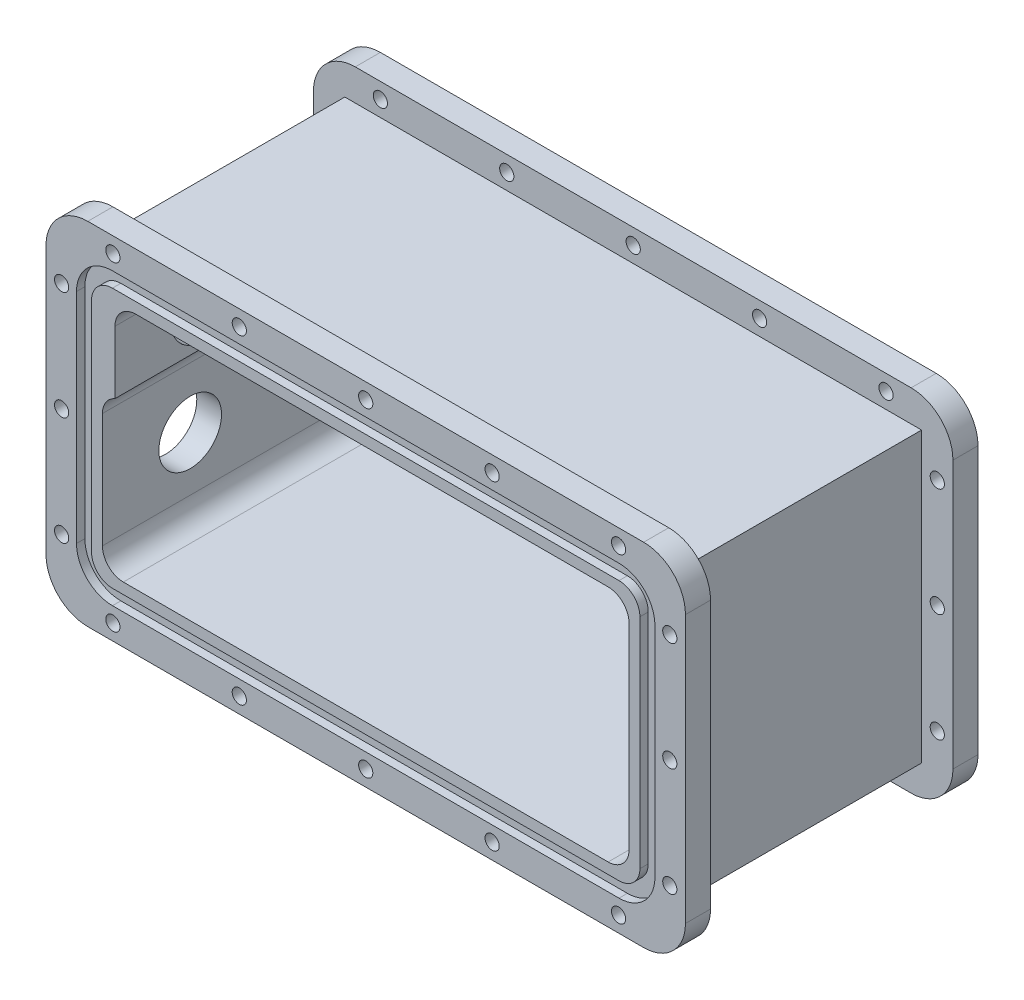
ISO-10303-21;
HEADER;
FILE_DESCRIPTION(('STEP AP214'),'2;1');
FILE_NAME('part.step','',(''),(''),'','','');
FILE_SCHEMA(('AUTOMOTIVE_DESIGN { 1 0 10303 214 1 1 1 1 }'));
ENDSEC;
DATA;
#1=APPLICATION_CONTEXT('core data for automotive mechanical design processes');
#2=APPLICATION_PROTOCOL_DEFINITION('international standard','automotive_design',2000,#1);
#3=PRODUCT_CONTEXT('',#1,'mechanical');
#4=PRODUCT('Part','Part','',(#3));
#5=PRODUCT_RELATED_PRODUCT_CATEGORY('part','',(#4));
#6=PRODUCT_DEFINITION_FORMATION('','',#4);
#7=PRODUCT_DEFINITION_CONTEXT('part definition',#1,'design');
#8=PRODUCT_DEFINITION('design','',#6,#7);
#9=PRODUCT_DEFINITION_SHAPE('','',#8);
#10=(LENGTH_UNIT() NAMED_UNIT(*) SI_UNIT(.MILLI.,.METRE.));
#11=(NAMED_UNIT(*) PLANE_ANGLE_UNIT() SI_UNIT($,.RADIAN.));
#12=(NAMED_UNIT(*) SI_UNIT($,.STERADIAN.) SOLID_ANGLE_UNIT());
#13=UNCERTAINTY_MEASURE_WITH_UNIT(LENGTH_MEASURE(1.E-05),#10,'distance_accuracy_value','');
#14=(GEOMETRIC_REPRESENTATION_CONTEXT(3) GLOBAL_UNCERTAINTY_ASSIGNED_CONTEXT((#13)) GLOBAL_UNIT_ASSIGNED_CONTEXT((#10,
#11,#12)) REPRESENTATION_CONTEXT('',''));
#15=CARTESIAN_POINT('',(0.,0.,0.));
#16=DIRECTION('',(0.,0.,1.));
#17=DIRECTION('',(1.,0.,0.));
#18=AXIS2_PLACEMENT_3D('',#15,#16,#17);
#19=CARTESIAN_POINT('',(97.156,-13.335,71.755));
#20=DIRECTION('',(-1.,0.,0.));
#21=DIRECTION('',(0.,-1.,0.));
#22=AXIS2_PLACEMENT_3D('',#19,#20,#21);
#23=CYLINDRICAL_SURFACE('',#22,9.52500000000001);
#24=CARTESIAN_POINT('',(-80.0100000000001,-13.335,71.755));
#25=DIRECTION('',(1.,0.,0.));
#26=DIRECTION('',(0.,1.,0.));
#27=AXIS2_PLACEMENT_3D('',#24,#25,#26);
#28=CIRCLE('',#27,9.52500000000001);
#29=CARTESIAN_POINT('',(-80.0100000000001,-3.81,71.755));
#30=VERTEX_POINT('',#29);
#31=EDGE_CURVE('E1369',#30,#30,#28,.F.);
#32=ORIENTED_EDGE('',*,*,#31,.F.);
#33=EDGE_LOOP('',(#32));
#34=FACE_BOUND('',#33,.T.);
#35=CARTESIAN_POINT('',(-87.5284000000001,-13.335,71.755));
#36=DIRECTION('',(-1.,0.,0.));
#37=DIRECTION('',(0.,-1.,0.));
#38=AXIS2_PLACEMENT_3D('',#35,#36,#37);
#39=CIRCLE('',#38,9.52500000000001);
#40=CARTESIAN_POINT('',(-87.5284000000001,-22.86,71.755));
#41=VERTEX_POINT('',#40);
#42=EDGE_CURVE('E78',#41,#41,#39,.F.);
#43=ORIENTED_EDGE('',*,*,#42,.F.);
#44=EDGE_LOOP('',(#43));
#45=FACE_BOUND('',#44,.T.);
#46=ADVANCED_FACE('F74',(#34,#45),#23,.F.);
#47=CARTESIAN_POINT('',(-102.235,-58.42,9.52500000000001));
#48=DIRECTION('',(0.,0.,1.));
#49=DIRECTION('',(1.,0.,0.));
#50=AXIS2_PLACEMENT_3D('',#47,#48,#49);
#51=PLANE('',#50);
#52=DIRECTION('',(0.,1.,0.));
#53=VECTOR('',#52,1.);
#54=CARTESIAN_POINT('',(80.01,36.195,9.52500000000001));
#55=LINE('',#54,#53);
#56=CARTESIAN_POINT('',(80.01,-29.845,9.52500000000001));
#57=VERTEX_POINT('',#56);
#58=CARTESIAN_POINT('',(80.01,29.845,9.52500000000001));
#59=VERTEX_POINT('',#58);
#60=EDGE_CURVE('E1242',#57,#59,#55,.T.);
#61=ORIENTED_EDGE('',*,*,#60,.T.);
#62=CARTESIAN_POINT('',(73.66,29.845,9.52500000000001));
#63=DIRECTION('',(0.,0.,1.));
#64=DIRECTION('',(1.,0.,0.));
#65=AXIS2_PLACEMENT_3D('',#62,#63,#64);
#66=CIRCLE('',#65,6.35);
#67=CARTESIAN_POINT('',(73.66,36.195,9.52500000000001));
#68=VERTEX_POINT('',#67);
#69=EDGE_CURVE('E1317',#59,#68,#66,.T.);
#70=ORIENTED_EDGE('',*,*,#69,.T.);
#71=DIRECTION('',(-1.,0.,0.));
#72=VECTOR('',#71,1.);
#73=CARTESIAN_POINT('',(-80.01,36.195,9.525));
#74=LINE('',#73,#72);
#75=CARTESIAN_POINT('',(-69.85,36.195,9.525));
#76=VERTEX_POINT('',#75);
#77=EDGE_CURVE('E1244',#68,#76,#74,.T.);
#78=ORIENTED_EDGE('',*,*,#77,.T.);
#79=CARTESIAN_POINT('',(-69.8500000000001,29.845,9.525));
#80=DIRECTION('',(0.,0.,1.));
#81=DIRECTION('',(1.,0.,0.));
#82=AXIS2_PLACEMENT_3D('',#79,#80,#81);
#83=CIRCLE('',#82,6.35);
#84=CARTESIAN_POINT('',(-76.2,29.845,9.525));
#85=VERTEX_POINT('',#84);
#86=EDGE_CURVE('E1372',#76,#85,#83,.T.);
#87=ORIENTED_EDGE('',*,*,#86,.T.);
#88=DIRECTION('',(0.,-1.,0.));
#89=VECTOR('',#88,1.);
#90=CARTESIAN_POINT('',(-76.1999999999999,10.795,9.52499999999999));
#91=LINE('',#90,#89);
#92=CARTESIAN_POINT('',(-76.1999999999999,10.795,9.52499999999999));
#93=VERTEX_POINT('',#92);
#94=EDGE_CURVE('E1639',#85,#93,#91,.T.);
#95=ORIENTED_EDGE('',*,*,#94,.T.);
#96=CARTESIAN_POINT('',(-73.6600000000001,4.9751288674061,9.525));
#97=DIRECTION('',(0.,0.,1.));
#98=DIRECTION('',(1.,0.,0.));
#99=AXIS2_PLACEMENT_3D('',#96,#97,#98);
#100=CIRCLE('',#99,6.35);
#101=CARTESIAN_POINT('',(-80.01,4.9751288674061,9.525));
#102=VERTEX_POINT('',#101);
#103=EDGE_CURVE('E1638',#93,#102,#100,.T.);
#104=ORIENTED_EDGE('',*,*,#103,.T.);
#105=DIRECTION('',(0.,-1.,0.));
#106=VECTOR('',#105,1.);
#107=CARTESIAN_POINT('',(-80.01,36.195,9.525));
#108=LINE('',#107,#106);
#109=CARTESIAN_POINT('',(-80.01,-29.845,9.52500000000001));
#110=VERTEX_POINT('',#109);
#111=EDGE_CURVE('E1238',#102,#110,#108,.T.);
#112=ORIENTED_EDGE('',*,*,#111,.T.);
#113=CARTESIAN_POINT('',(-73.66,-29.845,9.52500000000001));
#114=DIRECTION('',(0.,0.,1.));
#115=DIRECTION('',(1.,0.,0.));
#116=AXIS2_PLACEMENT_3D('',#113,#114,#115);
#117=CIRCLE('',#116,6.35);
#118=CARTESIAN_POINT('',(-73.6600000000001,-36.195,9.52500000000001));
#119=VERTEX_POINT('',#118);
#120=EDGE_CURVE('E1313',#110,#119,#117,.T.);
#121=ORIENTED_EDGE('',*,*,#120,.T.);
#122=DIRECTION('',(1.,0.,0.));
#123=VECTOR('',#122,1.);
#124=CARTESIAN_POINT('',(-80.01,-36.195,9.52499999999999));
#125=LINE('',#124,#123);
#126=CARTESIAN_POINT('',(73.66,-36.195,9.52500000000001));
#127=VERTEX_POINT('',#126);
#128=EDGE_CURVE('E1240',#119,#127,#125,.T.);
#129=ORIENTED_EDGE('',*,*,#128,.T.);
#130=CARTESIAN_POINT('',(73.6600000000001,-29.845,9.52500000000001));
#131=DIRECTION('',(0.,0.,1.));
#132=DIRECTION('',(1.,0.,0.));
#133=AXIS2_PLACEMENT_3D('',#130,#131,#132);
#134=CIRCLE('',#133,6.35);
#135=EDGE_CURVE('E1315',#127,#57,#134,.T.);
#136=ORIENTED_EDGE('',*,*,#135,.T.);
#137=EDGE_LOOP('',(#61,#70,#78,#87,#95,#104,#112,#121,#129,#136));
#138=FACE_BOUND('',#137,.T.);
#139=CARTESIAN_POINT('',(-76.962,33.147,9.525));
#140=DIRECTION('',(0.,0.,-1.));
#141=DIRECTION('',(-1.,0.,0.));
#142=AXIS2_PLACEMENT_3D('',#139,#140,#141);
#143=CIRCLE('',#142,6.35);
#144=CARTESIAN_POINT('',(-83.3119999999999,33.147,9.525));
#145=VERTEX_POINT('',#144);
#146=CARTESIAN_POINT('',(-76.962,39.497,9.525));
#147=VERTEX_POINT('',#146);
#148=EDGE_CURVE('E493',#145,#147,#143,.T.);
#149=ORIENTED_EDGE('',*,*,#148,.T.);
#150=DIRECTION('',(1.,0.,0.));
#151=VECTOR('',#150,1.);
#152=CARTESIAN_POINT('',(76.9620000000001,39.497,9.525));
#153=LINE('',#152,#151);
#154=CARTESIAN_POINT('',(76.9620000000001,39.497,9.525));
#155=VERTEX_POINT('',#154);
#156=EDGE_CURVE('E491',#147,#155,#153,.T.);
#157=ORIENTED_EDGE('',*,*,#156,.T.);
#158=CARTESIAN_POINT('',(76.962,33.147,9.52500000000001));
#159=DIRECTION('',(0.,0.,-1.));
#160=DIRECTION('',(-1.,0.,0.));
#161=AXIS2_PLACEMENT_3D('',#158,#159,#160);
#162=CIRCLE('',#161,6.35);
#163=CARTESIAN_POINT('',(83.3119999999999,33.147,9.52500000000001));
#164=VERTEX_POINT('',#163);
#165=EDGE_CURVE('E98',#155,#164,#162,.T.);
#166=ORIENTED_EDGE('',*,*,#165,.T.);
#167=DIRECTION('',(0.,-1.,0.));
#168=VECTOR('',#167,1.);
#169=CARTESIAN_POINT('',(83.3119999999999,33.147,9.52500000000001));
#170=LINE('',#169,#168);
#171=CARTESIAN_POINT('',(83.3119999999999,-33.147,9.525));
#172=VERTEX_POINT('',#171);
#173=EDGE_CURVE('E480',#164,#172,#170,.T.);
#174=ORIENTED_EDGE('',*,*,#173,.T.);
#175=CARTESIAN_POINT('',(76.962,-33.147,9.525));
#176=DIRECTION('',(0.,0.,-1.));
#177=DIRECTION('',(-1.,0.,0.));
#178=AXIS2_PLACEMENT_3D('',#175,#176,#177);
#179=CIRCLE('',#178,6.35);
#180=CARTESIAN_POINT('',(76.962,-39.497,9.525));
#181=VERTEX_POINT('',#180);
#182=EDGE_CURVE('E485',#172,#181,#179,.T.);
#183=ORIENTED_EDGE('',*,*,#182,.T.);
#184=DIRECTION('',(-1.,0.,0.));
#185=VECTOR('',#184,1.);
#186=CARTESIAN_POINT('',(76.962,-39.497,9.525));
#187=LINE('',#186,#185);
#188=CARTESIAN_POINT('',(-76.9620000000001,-39.497,9.525));
#189=VERTEX_POINT('',#188);
#190=EDGE_CURVE('E498',#181,#189,#187,.T.);
#191=ORIENTED_EDGE('',*,*,#190,.T.);
#192=CARTESIAN_POINT('',(-76.9620000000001,-33.147,9.525));
#193=DIRECTION('',(0.,0.,-1.));
#194=DIRECTION('',(-1.,0.,0.));
#195=AXIS2_PLACEMENT_3D('',#192,#193,#194);
#196=CIRCLE('',#195,6.35);
#197=CARTESIAN_POINT('',(-83.3120000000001,-33.147,9.525));
#198=VERTEX_POINT('',#197);
#199=EDGE_CURVE('E501',#189,#198,#196,.T.);
#200=ORIENTED_EDGE('',*,*,#199,.T.);
#201=DIRECTION('',(0.,1.,0.));
#202=VECTOR('',#201,1.);
#203=CARTESIAN_POINT('',(-83.3119999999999,33.147,9.525));
#204=LINE('',#203,#202);
#205=EDGE_CURVE('E504',#198,#145,#204,.T.);
#206=ORIENTED_EDGE('',*,*,#205,.T.);
#207=EDGE_LOOP('',(#149,#157,#166,#174,#183,#191,#200,#206));
#208=FACE_BOUND('',#207,.T.);
#209=ADVANCED_FACE('F489',(#138,#208),#51,.F.);
#210=CARTESIAN_POINT('',(-87.6300000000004,43.815,98.425));
#211=DIRECTION('',(1.,0.,0.));
#212=DIRECTION('',(0.,1.,0.));
#213=AXIS2_PLACEMENT_3D('',#210,#211,#212);
#214=PLANE('',#213);
#215=CARTESIAN_POINT('',(-87.6300000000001,-13.335,71.755));
#216=DIRECTION('',(-1.,0.,0.));
#217=DIRECTION('',(0.,-1.,0.));
#218=AXIS2_PLACEMENT_3D('',#215,#216,#217);
#219=CIRCLE('',#218,15.875);
#220=CARTESIAN_POINT('',(-87.6300000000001,-29.21,71.755));
#221=VERTEX_POINT('',#220);
#222=EDGE_CURVE('E1205',#221,#221,#219,.T.);
#223=ORIENTED_EDGE('',*,*,#222,.F.);
#224=EDGE_LOOP('',(#223));
#225=FACE_BOUND('',#224,.T.);
#226=CARTESIAN_POINT('',(-87.6300000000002,22.225,71.755));
#227=DIRECTION('',(1.,0.,0.));
#228=DIRECTION('',(0.,1.,0.));
#229=AXIS2_PLACEMENT_3D('',#226,#227,#228);
#230=CIRCLE('',#229,10.4946010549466);
#231=CARTESIAN_POINT('',(-87.6300000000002,32.7196010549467,71.755));
#232=VERTEX_POINT('',#231);
#233=EDGE_CURVE('E83',#232,#232,#230,.T.);
#234=ORIENTED_EDGE('',*,*,#233,.T.);
#235=EDGE_LOOP('',(#234));
#236=FACE_BOUND('',#235,.T.);
#237=DIRECTION('',(0.,-1.,0.));
#238=VECTOR('',#237,1.);
#239=CARTESIAN_POINT('',(-87.6300000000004,43.815,17.145));
#240=LINE('',#239,#238);
#241=CARTESIAN_POINT('',(-87.6300000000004,43.815,17.145));
#242=VERTEX_POINT('',#241);
#243=CARTESIAN_POINT('',(-87.63,-43.815,17.145));
#244=VERTEX_POINT('',#243);
#245=EDGE_CURVE('E705',#242,#244,#240,.T.);
#246=ORIENTED_EDGE('',*,*,#245,.T.);
#247=DIRECTION('',(0.,0.,-1.));
#248=VECTOR('',#247,1.);
#249=CARTESIAN_POINT('',(-87.6300000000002,-43.815,98.425));
#250=LINE('',#249,#248);
#251=CARTESIAN_POINT('',(-87.6300000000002,-43.815,90.805));
#252=VERTEX_POINT('',#251);
#253=EDGE_CURVE('E1214',#252,#244,#250,.T.);
#254=ORIENTED_EDGE('',*,*,#253,.F.);
#255=DIRECTION('',(0.,-1.,0.));
#256=VECTOR('',#255,1.);
#257=CARTESIAN_POINT('',(-87.6300000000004,43.815,90.805));
#258=LINE('',#257,#256);
#259=CARTESIAN_POINT('',(-87.6300000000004,43.815,90.805));
#260=VERTEX_POINT('',#259);
#261=EDGE_CURVE('E1537',#260,#252,#258,.T.);
#262=ORIENTED_EDGE('',*,*,#261,.F.);
#263=DIRECTION('',(0.,0.,-1.));
#264=VECTOR('',#263,1.);
#265=CARTESIAN_POINT('',(-87.6300000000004,43.815,98.425));
#266=LINE('',#265,#264);
#267=EDGE_CURVE('E1216',#260,#242,#266,.T.);
#268=ORIENTED_EDGE('',*,*,#267,.T.);
#269=EDGE_LOOP('',(#246,#254,#262,#268));
#270=FACE_BOUND('',#269,.T.);
#271=ADVANCED_FACE('F982',(#225,#236,#270),#214,.F.);
#272=CARTESIAN_POINT('',(87.63,-43.815,98.425));
#273=DIRECTION('',(-1.,0.,0.));
#274=DIRECTION('',(0.,-1.,0.));
#275=AXIS2_PLACEMENT_3D('',#272,#273,#274);
#276=PLANE('',#275);
#277=DIRECTION('',(0.,1.,0.));
#278=VECTOR('',#277,1.);
#279=CARTESIAN_POINT('',(87.63,-43.815,17.145));
#280=LINE('',#279,#278);
#281=CARTESIAN_POINT('',(87.63,-43.815,17.145));
#282=VERTEX_POINT('',#281);
#283=CARTESIAN_POINT('',(87.6299999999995,43.815,17.145));
#284=VERTEX_POINT('',#283);
#285=EDGE_CURVE('E700',#282,#284,#280,.T.);
#286=ORIENTED_EDGE('',*,*,#285,.T.);
#287=DIRECTION('',(0.,0.,-1.));
#288=VECTOR('',#287,1.);
#289=CARTESIAN_POINT('',(87.6299999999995,43.815,98.425));
#290=LINE('',#289,#288);
#291=CARTESIAN_POINT('',(87.6299999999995,43.815,90.805));
#292=VERTEX_POINT('',#291);
#293=EDGE_CURVE('E1230',#292,#284,#290,.T.);
#294=ORIENTED_EDGE('',*,*,#293,.F.);
#295=DIRECTION('',(0.,1.,0.));
#296=VECTOR('',#295,1.);
#297=CARTESIAN_POINT('',(87.63,-43.815,90.805));
#298=LINE('',#297,#296);
#299=CARTESIAN_POINT('',(87.63,-43.815,90.805));
#300=VERTEX_POINT('',#299);
#301=EDGE_CURVE('E1231',#300,#292,#298,.T.);
#302=ORIENTED_EDGE('',*,*,#301,.F.);
#303=DIRECTION('',(0.,0.,-1.));
#304=VECTOR('',#303,1.);
#305=CARTESIAN_POINT('',(87.63,-43.815,98.425));
#306=LINE('',#305,#304);
#307=EDGE_CURVE('E1224',#300,#282,#306,.T.);
#308=ORIENTED_EDGE('',*,*,#307,.T.);
#309=EDGE_LOOP('',(#286,#294,#302,#308));
#310=FACE_BOUND('',#309,.T.);
#311=ADVANCED_FACE('F1191',(#310),#276,.F.);
#312=CARTESIAN_POINT('',(-87.6300000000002,-43.815,98.425));
#313=DIRECTION('',(0.,1.,0.));
#314=DIRECTION('',(0.,0.,1.));
#315=AXIS2_PLACEMENT_3D('',#312,#313,#314);
#316=PLANE('',#315);
#317=DIRECTION('',(1.,0.,0.));
#318=VECTOR('',#317,1.);
#319=CARTESIAN_POINT('',(-87.63,-43.815,17.145));
#320=LINE('',#319,#318);
#321=EDGE_CURVE('E698',#244,#282,#320,.T.);
#322=ORIENTED_EDGE('',*,*,#321,.T.);
#323=ORIENTED_EDGE('',*,*,#307,.F.);
#324=DIRECTION('',(1.,0.,0.));
#325=VECTOR('',#324,1.);
#326=CARTESIAN_POINT('',(-87.6300000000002,-43.815,90.805));
#327=LINE('',#326,#325);
#328=EDGE_CURVE('E1223',#252,#300,#327,.T.);
#329=ORIENTED_EDGE('',*,*,#328,.F.);
#330=ORIENTED_EDGE('',*,*,#253,.T.);
#331=EDGE_LOOP('',(#322,#323,#329,#330));
#332=FACE_BOUND('',#331,.T.);
#333=ADVANCED_FACE('F1194',(#332),#316,.F.);
#334=CARTESIAN_POINT('',(87.6299999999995,43.815,98.425));
#335=DIRECTION('',(0.,-1.,0.));
#336=DIRECTION('',(1.,0.,0.));
#337=AXIS2_PLACEMENT_3D('',#334,#335,#336);
#338=PLANE('',#337);
#339=DIRECTION('',(-1.,0.,0.));
#340=VECTOR('',#339,1.);
#341=CARTESIAN_POINT('',(87.6299999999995,43.815,17.145));
#342=LINE('',#341,#340);
#343=EDGE_CURVE('E703',#284,#242,#342,.T.);
#344=ORIENTED_EDGE('',*,*,#343,.T.);
#345=ORIENTED_EDGE('',*,*,#267,.F.);
#346=DIRECTION('',(-1.,0.,0.));
#347=VECTOR('',#346,1.);
#348=CARTESIAN_POINT('',(87.6299999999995,43.815,90.805));
#349=LINE('',#348,#347);
#350=EDGE_CURVE('E1535',#292,#260,#349,.T.);
#351=ORIENTED_EDGE('',*,*,#350,.F.);
#352=ORIENTED_EDGE('',*,*,#293,.T.);
#353=EDGE_LOOP('',(#344,#345,#351,#352));
#354=FACE_BOUND('',#353,.T.);
#355=ADVANCED_FACE('F76',(#354),#338,.F.);
#356=CARTESIAN_POINT('',(97.1559999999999,22.225,71.755));
#357=DIRECTION('',(-1.,0.,0.));
#358=DIRECTION('',(0.,-1.,0.));
#359=AXIS2_PLACEMENT_3D('',#356,#357,#358);
#360=CYLINDRICAL_SURFACE('',#359,9.6266);
#361=CARTESIAN_POINT('',(-76.2000000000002,22.225,71.755));
#362=DIRECTION('',(1.,0.,0.));
#363=DIRECTION('',(0.,1.,0.));
#364=AXIS2_PLACEMENT_3D('',#361,#362,#363);
#365=CIRCLE('',#364,9.6266);
#366=CARTESIAN_POINT('',(-76.2,29.845,65.872226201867));
#367=VERTEX_POINT('',#366);
#368=CARTESIAN_POINT('',(-76.2,29.845,77.637773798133));
#369=VERTEX_POINT('',#368);
#370=EDGE_CURVE('E782',#367,#369,#365,.F.);
#371=ORIENTED_EDGE('',*,*,#370,.F.);
#372=CARTESIAN_POINT('',(-76.2,29.845,77.637773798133));
#373=CARTESIAN_POINT('',(-76.1999972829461,29.9275442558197,77.5308551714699));
#374=CARTESIAN_POINT('',(-76.1983908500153,30.0078190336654,77.4222203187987));
#375=CARTESIAN_POINT('',(-76.1924781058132,30.1636839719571,77.201737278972));
#376=CARTESIAN_POINT('',(-76.1881722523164,30.2392749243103,77.0898896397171));
#377=CARTESIAN_POINT('',(-76.171975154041,30.4587162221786,76.7499994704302));
#378=CARTESIAN_POINT('',(-76.1568025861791,30.5953800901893,76.5174216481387));
#379=CARTESIAN_POINT('',(-76.1214753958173,30.8487359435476,76.0416518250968));
#380=CARTESIAN_POINT('',(-76.1013139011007,30.9654000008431,75.7984455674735));
#381=CARTESIAN_POINT('',(-76.0594765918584,31.1779039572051,75.303175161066));
#382=CARTESIAN_POINT('',(-76.0378005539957,31.2737407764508,75.051109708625));
#383=CARTESIAN_POINT('',(-75.9965627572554,31.4417322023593,74.5464396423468));
#384=CARTESIAN_POINT('',(-75.9769603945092,31.5144431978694,74.2940234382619));
#385=CARTESIAN_POINT('',(-75.9416435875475,31.6390401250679,73.7838449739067));
#386=CARTESIAN_POINT('',(-75.9259287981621,31.6909279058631,73.526083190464));
#387=CARTESIAN_POINT('',(-75.9002616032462,31.7733940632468,73.0073702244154));
#388=CARTESIAN_POINT('',(-75.8902985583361,31.8040118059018,72.746425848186));
#389=CARTESIAN_POINT('',(-75.8772447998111,31.8438155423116,72.2227298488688));
#390=CARTESIAN_POINT('',(-75.8741540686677,31.8530015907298,71.9599782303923));
#391=CARTESIAN_POINT('',(-75.8752040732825,31.8498488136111,71.4339961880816));
#392=CARTESIAN_POINT('',(-75.8793619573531,31.8374589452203,71.1707661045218));
#393=CARTESIAN_POINT('',(-75.8944590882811,31.7911760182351,70.6464045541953));
#394=CARTESIAN_POINT('',(-75.9053984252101,31.7572826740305,70.3852731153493));
#395=CARTESIAN_POINT('',(-75.932807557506,31.6682166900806,69.8664858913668));
#396=CARTESIAN_POINT('',(-75.9492872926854,31.6130057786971,69.6088372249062));
#397=CARTESIAN_POINT('',(-75.9858146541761,31.4817380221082,69.0991591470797));
#398=CARTESIAN_POINT('',(-76.0058624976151,31.4056799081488,68.8471300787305));
#399=CARTESIAN_POINT('',(-76.0467419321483,31.2344328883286,68.3537083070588));
#400=CARTESIAN_POINT('',(-76.0675586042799,31.1395269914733,68.1122160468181));
#401=CARTESIAN_POINT('',(-76.1074360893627,30.9304955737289,67.6375961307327));
#402=CARTESIAN_POINT('',(-76.1264972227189,30.8163735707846,67.4044669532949));
#403=CARTESIAN_POINT('',(-76.1597408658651,30.5696838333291,66.948258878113));
#404=CARTESIAN_POINT('',(-76.1739311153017,30.43714583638,66.7251645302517));
#405=CARTESIAN_POINT('',(-76.1940409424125,30.1542329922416,66.2899986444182));
#406=CARTESIAN_POINT('',(-76.1999547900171,30.0038458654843,66.0779348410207));
#407=CARTESIAN_POINT('',(-76.2,29.845,65.872226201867));
#408=B_SPLINE_CURVE_WITH_KNOTS('',3,(#372,#373,#374,#375,#376,#377,#378,#379,#380,#381,#382,
#383,#384,#385,#386,#387,#388,#389,#390,#391,#392,#393,#394,#395,#396,#397,#398,#399,#400,#401,
#402,#403,#404,#405,#406,#407),.UNSPECIFIED.,.F.,.F.,(4,2,2,2,2,2,2,2,2,2,2,2,2,2,2,2,2,4),(0.,
0.405134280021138,0.810199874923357,1.61962122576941,2.43016381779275,3.24082618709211,
4.03017526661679,4.81945423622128,5.60726850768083,6.39508076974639,7.18475931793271,
7.97444835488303,8.76556177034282,9.55672334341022,10.3367985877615,11.1167311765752,
11.895418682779,12.6746450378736),.UNSPECIFIED.);
#409=EDGE_CURVE('E772',#369,#367,#408,.T.);
#410=ORIENTED_EDGE('',*,*,#409,.F.);
#411=EDGE_LOOP('',(#371,#410));
#412=FACE_BOUND('',#411,.T.);
#413=CARTESIAN_POINT('',(-85.1179566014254,22.225,71.755));
#414=DIRECTION('',(-1.,0.,0.));
#415=DIRECTION('',(0.,0.,1.));
#416=AXIS2_PLACEMENT_3D('',#413,#414,#415);
#417=CIRCLE('',#416,9.6266);
#418=CARTESIAN_POINT('',(-85.1179566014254,22.225,81.3816));
#419=VERTEX_POINT('',#418);
#420=EDGE_CURVE('E758',#419,#419,#417,.F.);
#421=ORIENTED_EDGE('',*,*,#420,.F.);
#422=EDGE_LOOP('',(#421));
#423=FACE_BOUND('',#422,.T.);
#424=ADVANCED_FACE('F784',(#412,#423),#360,.F.);
#425=CARTESIAN_POINT('',(80.01,36.195,98.425));
#426=DIRECTION('',(0.,-1.,0.));
#427=DIRECTION('',(0.,0.,-1.));
#428=AXIS2_PLACEMENT_3D('',#425,#426,#427);
#429=PLANE('',#428);
#430=DIRECTION('',(-1.,0.,0.));
#431=VECTOR('',#430,1.);
#432=CARTESIAN_POINT('',(80.01,36.195,98.425));
#433=LINE('',#432,#431);
#434=CARTESIAN_POINT('',(73.66,36.195,98.425));
#435=VERTEX_POINT('',#434);
#436=CARTESIAN_POINT('',(-69.8500000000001,36.195,98.425));
#437=VERTEX_POINT('',#436);
#438=EDGE_CURVE('E1609',#435,#437,#433,.T.);
#439=ORIENTED_EDGE('',*,*,#438,.T.);
#440=DIRECTION('',(0.,0.,1.));
#441=VECTOR('',#440,1.);
#442=CARTESIAN_POINT('',(-69.85,36.195,-23.3064780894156));
#443=LINE('',#442,#441);
#444=EDGE_CURVE('E1361',#76,#437,#443,.T.);
#445=ORIENTED_EDGE('',*,*,#444,.F.);
#446=ORIENTED_EDGE('',*,*,#77,.F.);
#447=DIRECTION('',(0.,0.,-1.));
#448=VECTOR('',#447,1.);
#449=CARTESIAN_POINT('',(73.66,36.195,98.425));
#450=LINE('',#449,#448);
#451=EDGE_CURVE('E1246',#68,#435,#450,.F.);
#452=ORIENTED_EDGE('',*,*,#451,.T.);
#453=EDGE_LOOP('',(#439,#445,#446,#452));
#454=FACE_BOUND('',#453,.T.);
#455=ADVANCED_FACE('F1177',(#454),#429,.T.);
#456=CARTESIAN_POINT('',(-87.6300000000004,43.815,98.425));
#457=DIRECTION('',(0.,0.,1.));
#458=DIRECTION('',(1.,0.,0.));
#459=AXIS2_PLACEMENT_3D('',#456,#457,#458);
#460=PLANE('',#459);
#461=CARTESIAN_POINT('',(-76.8350000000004,-48.5902,98.425));
#462=DIRECTION('',(0.,0.,1.));
#463=DIRECTION('',(-1.,0.,0.));
#464=AXIS2_PLACEMENT_3D('',#461,#462,#463);
#465=CIRCLE('',#464,2.15899999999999);
#466=CARTESIAN_POINT('',(-78.9940000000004,-48.5902,98.425));
#467=VERTEX_POINT('',#466);
#468=EDGE_CURVE('E1311',#467,#467,#465,.T.);
#469=ORIENTED_EDGE('',*,*,#468,.F.);
#470=EDGE_LOOP('',(#469));
#471=FACE_BOUND('',#470,.T.);
#472=CARTESIAN_POINT('',(-38.4175000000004,-48.5902,98.425));
#473=DIRECTION('',(0.,0.,1.));
#474=DIRECTION('',(-1.,0.,0.));
#475=AXIS2_PLACEMENT_3D('',#472,#473,#474);
#476=CIRCLE('',#475,2.159);
#477=CARTESIAN_POINT('',(-40.5765000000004,-48.5902,98.425));
#478=VERTEX_POINT('',#477);
#479=EDGE_CURVE('E1307',#478,#478,#476,.T.);
#480=ORIENTED_EDGE('',*,*,#479,.F.);
#481=EDGE_LOOP('',(#480));
#482=FACE_BOUND('',#481,.T.);
#483=CARTESIAN_POINT('',(-4.44089209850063E-13,-48.5902,98.425));
#484=DIRECTION('',(0.,0.,1.));
#485=DIRECTION('',(-1.,0.,0.));
#486=AXIS2_PLACEMENT_3D('',#483,#484,#485);
#487=CIRCLE('',#486,2.159);
#488=CARTESIAN_POINT('',(-2.15900000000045,-48.5902,98.425));
#489=VERTEX_POINT('',#488);
#490=EDGE_CURVE('E1303',#489,#489,#487,.T.);
#491=ORIENTED_EDGE('',*,*,#490,.F.);
#492=EDGE_LOOP('',(#491));
#493=FACE_BOUND('',#492,.T.);
#494=CARTESIAN_POINT('',(38.4174999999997,-48.5902,98.425));
#495=DIRECTION('',(0.,0.,1.));
#496=DIRECTION('',(1.,0.,0.));
#497=AXIS2_PLACEMENT_3D('',#494,#495,#496);
#498=CIRCLE('',#497,2.159);
#499=CARTESIAN_POINT('',(40.5764999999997,-48.5902,98.425));
#500=VERTEX_POINT('',#499);
#501=EDGE_CURVE('E1299',#500,#500,#498,.T.);
#502=ORIENTED_EDGE('',*,*,#501,.F.);
#503=EDGE_LOOP('',(#502));
#504=FACE_BOUND('',#503,.T.);
#505=CARTESIAN_POINT('',(76.8349999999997,-48.5902,98.425));
#506=DIRECTION('',(0.,0.,1.));
#507=DIRECTION('',(1.,0.,0.));
#508=AXIS2_PLACEMENT_3D('',#505,#506,#507);
#509=CIRCLE('',#508,2.15899999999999);
#510=CARTESIAN_POINT('',(78.9939999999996,-48.5902,98.425));
#511=VERTEX_POINT('',#510);
#512=EDGE_CURVE('E1295',#511,#511,#509,.T.);
#513=ORIENTED_EDGE('',*,*,#512,.F.);
#514=EDGE_LOOP('',(#513));
#515=FACE_BOUND('',#514,.T.);
#516=CARTESIAN_POINT('',(38.4174999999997,48.5902,98.425));
#517=DIRECTION('',(0.,0.,1.));
#518=DIRECTION('',(-1.,0.,0.));
#519=AXIS2_PLACEMENT_3D('',#516,#517,#518);
#520=CIRCLE('',#519,2.159);
#521=CARTESIAN_POINT('',(36.2584999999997,48.5902,98.425));
#522=VERTEX_POINT('',#521);
#523=EDGE_CURVE('E1291',#522,#522,#520,.T.);
#524=ORIENTED_EDGE('',*,*,#523,.F.);
#525=EDGE_LOOP('',(#524));
#526=FACE_BOUND('',#525,.T.);
#527=CARTESIAN_POINT('',(76.8349999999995,48.5902,98.425));
#528=DIRECTION('',(0.,0.,1.));
#529=DIRECTION('',(-1.,0.,0.));
#530=AXIS2_PLACEMENT_3D('',#527,#528,#529);
#531=CIRCLE('',#530,2.15899999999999);
#532=CARTESIAN_POINT('',(74.6759999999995,48.5902,98.425));
#533=VERTEX_POINT('',#532);
#534=EDGE_CURVE('E1287',#533,#533,#531,.T.);
#535=ORIENTED_EDGE('',*,*,#534,.F.);
#536=EDGE_LOOP('',(#535));
#537=FACE_BOUND('',#536,.T.);
#538=CARTESIAN_POINT('',(92.4052000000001,33.02,98.425));
#539=DIRECTION('',(0.,0.,1.));
#540=DIRECTION('',(-1.,0.,0.));
#541=AXIS2_PLACEMENT_3D('',#538,#539,#540);
#542=CIRCLE('',#541,2.15899999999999);
#543=CARTESIAN_POINT('',(90.2462000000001,33.02,98.425));
#544=VERTEX_POINT('',#543);
#545=EDGE_CURVE('E1283',#544,#544,#542,.T.);
#546=ORIENTED_EDGE('',*,*,#545,.F.);
#547=EDGE_LOOP('',(#546));
#548=FACE_BOUND('',#547,.T.);
#549=CARTESIAN_POINT('',(92.4052,0.,98.425));
#550=DIRECTION('',(0.,0.,1.));
#551=DIRECTION('',(-1.,0.,0.));
#552=AXIS2_PLACEMENT_3D('',#549,#550,#551);
#553=CIRCLE('',#552,2.15899999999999);
#554=CARTESIAN_POINT('',(90.2462,0.,98.425));
#555=VERTEX_POINT('',#554);
#556=EDGE_CURVE('E1279',#555,#555,#553,.T.);
#557=ORIENTED_EDGE('',*,*,#556,.F.);
#558=EDGE_LOOP('',(#557));
#559=FACE_BOUND('',#558,.T.);
#560=CARTESIAN_POINT('',(92.4052000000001,-33.02,98.425));
#561=DIRECTION('',(0.,0.,1.));
#562=DIRECTION('',(1.,0.,0.));
#563=AXIS2_PLACEMENT_3D('',#560,#561,#562);
#564=CIRCLE('',#563,2.15899999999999);
#565=CARTESIAN_POINT('',(94.5642000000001,-33.02,98.425));
#566=VERTEX_POINT('',#565);
#567=EDGE_CURVE('E1275',#566,#566,#564,.T.);
#568=ORIENTED_EDGE('',*,*,#567,.F.);
#569=EDGE_LOOP('',(#568));
#570=FACE_BOUND('',#569,.T.);
#571=CARTESIAN_POINT('',(-92.4052000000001,-33.02,98.425));
#572=DIRECTION('',(0.,0.,1.));
#573=DIRECTION('',(-1.,0.,0.));
#574=AXIS2_PLACEMENT_3D('',#571,#572,#573);
#575=CIRCLE('',#574,2.15899999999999);
#576=CARTESIAN_POINT('',(-94.5642000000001,-33.02,98.425));
#577=VERTEX_POINT('',#576);
#578=EDGE_CURVE('E1271',#577,#577,#575,.T.);
#579=ORIENTED_EDGE('',*,*,#578,.F.);
#580=EDGE_LOOP('',(#579));
#581=FACE_BOUND('',#580,.T.);
#582=CARTESIAN_POINT('',(-92.4052,0.,98.425));
#583=DIRECTION('',(0.,0.,1.));
#584=DIRECTION('',(1.,0.,0.));
#585=AXIS2_PLACEMENT_3D('',#582,#583,#584);
#586=CIRCLE('',#585,2.15899999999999);
#587=CARTESIAN_POINT('',(-90.2462,0.,98.425));
#588=VERTEX_POINT('',#587);
#589=EDGE_CURVE('E1267',#588,#588,#586,.T.);
#590=ORIENTED_EDGE('',*,*,#589,.F.);
#591=EDGE_LOOP('',(#590));
#592=FACE_BOUND('',#591,.T.);
#593=CARTESIAN_POINT('',(-92.4052000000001,33.02,98.425));
#594=DIRECTION('',(0.,0.,1.));
#595=DIRECTION('',(1.,0.,0.));
#596=AXIS2_PLACEMENT_3D('',#593,#594,#595);
#597=CIRCLE('',#596,2.15899999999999);
#598=CARTESIAN_POINT('',(-90.2462000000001,33.02,98.425));
#599=VERTEX_POINT('',#598);
#600=EDGE_CURVE('E1263',#599,#599,#597,.T.);
#601=ORIENTED_EDGE('',*,*,#600,.F.);
#602=EDGE_LOOP('',(#601));
#603=FACE_BOUND('',#602,.T.);
#604=CARTESIAN_POINT('',(-38.4175000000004,48.5902,98.425));
#605=DIRECTION('',(0.,0.,1.));
#606=DIRECTION('',(1.,0.,0.));
#607=AXIS2_PLACEMENT_3D('',#604,#605,#606);
#608=CIRCLE('',#607,2.159);
#609=CARTESIAN_POINT('',(-36.2585000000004,48.5902,98.425));
#610=VERTEX_POINT('',#609);
#611=EDGE_CURVE('E1259',#610,#610,#608,.T.);
#612=ORIENTED_EDGE('',*,*,#611,.F.);
#613=EDGE_LOOP('',(#612));
#614=FACE_BOUND('',#613,.T.);
#615=CARTESIAN_POINT('',(-4.44089209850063E-13,48.5902,98.425));
#616=DIRECTION('',(0.,0.,1.));
#617=DIRECTION('',(1.,0.,0.));
#618=AXIS2_PLACEMENT_3D('',#615,#616,#617);
#619=CIRCLE('',#618,2.159);
#620=CARTESIAN_POINT('',(2.15899999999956,48.5902,98.425));
#621=VERTEX_POINT('',#620);
#622=EDGE_CURVE('E1255',#621,#621,#619,.T.);
#623=ORIENTED_EDGE('',*,*,#622,.F.);
#624=EDGE_LOOP('',(#623));
#625=FACE_BOUND('',#624,.T.);
#626=CARTESIAN_POINT('',(-76.8350000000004,48.5902,98.425));
#627=DIRECTION('',(0.,0.,1.));
#628=DIRECTION('',(1.,0.,0.));
#629=AXIS2_PLACEMENT_3D('',#626,#627,#628);
#630=CIRCLE('',#629,2.15899999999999);
#631=CARTESIAN_POINT('',(-74.6760000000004,48.5902,98.425));
#632=VERTEX_POINT('',#631);
#633=EDGE_CURVE('E1251',#632,#632,#630,.T.);
#634=ORIENTED_EDGE('',*,*,#633,.F.);
#635=EDGE_LOOP('',(#634));
#636=FACE_BOUND('',#635,.T.);
#637=CARTESIAN_POINT('',(76.962,33.147,98.425));
#638=DIRECTION('',(0.,0.,1.));
#639=DIRECTION('',(1.,0.,0.));
#640=AXIS2_PLACEMENT_3D('',#637,#638,#639);
#641=CIRCLE('',#640,10.922);
#642=CARTESIAN_POINT('',(87.884,33.147,98.425));
#643=VERTEX_POINT('',#642);
#644=CARTESIAN_POINT('',(76.9619999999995,44.069,98.425));
#645=VERTEX_POINT('',#644);
#646=EDGE_CURVE('E1455',#643,#645,#641,.T.);
#647=ORIENTED_EDGE('',*,*,#646,.F.);
#648=DIRECTION('',(0.,1.,0.));
#649=VECTOR('',#648,1.);
#650=CARTESIAN_POINT('',(87.884,-33.147,98.425));
#651=LINE('',#650,#649);
#652=CARTESIAN_POINT('',(87.884,-33.147,98.425));
#653=VERTEX_POINT('',#652);
#654=EDGE_CURVE('E1489',#653,#643,#651,.T.);
#655=ORIENTED_EDGE('',*,*,#654,.F.);
#656=CARTESIAN_POINT('',(76.962,-33.147,98.425));
#657=DIRECTION('',(0.,0.,1.));
#658=DIRECTION('',(1.,0.,0.));
#659=AXIS2_PLACEMENT_3D('',#656,#657,#658);
#660=CIRCLE('',#659,10.922);
#661=CARTESIAN_POINT('',(76.9619999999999,-44.069,98.425));
#662=VERTEX_POINT('',#661);
#663=EDGE_CURVE('E1486',#662,#653,#660,.T.);
#664=ORIENTED_EDGE('',*,*,#663,.F.);
#665=DIRECTION('',(1.,0.,0.));
#666=VECTOR('',#665,1.);
#667=CARTESIAN_POINT('',(-76.9620000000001,-44.069,98.425));
#668=LINE('',#667,#666);
#669=CARTESIAN_POINT('',(-76.9620000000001,-44.069,98.425));
#670=VERTEX_POINT('',#669);
#671=EDGE_CURVE('E1483',#670,#662,#668,.T.);
#672=ORIENTED_EDGE('',*,*,#671,.F.);
#673=CARTESIAN_POINT('',(-76.962,-33.147,98.425));
#674=DIRECTION('',(0.,0.,1.));
#675=DIRECTION('',(1.,0.,0.));
#676=AXIS2_PLACEMENT_3D('',#673,#674,#675);
#677=CIRCLE('',#676,10.922);
#678=CARTESIAN_POINT('',(-87.884,-33.147,98.425));
#679=VERTEX_POINT('',#678);
#680=EDGE_CURVE('E1480',#679,#670,#677,.T.);
#681=ORIENTED_EDGE('',*,*,#680,.F.);
#682=DIRECTION('',(0.,-1.,0.));
#683=VECTOR('',#682,1.);
#684=CARTESIAN_POINT('',(-87.884,33.147,98.425));
#685=LINE('',#684,#683);
#686=CARTESIAN_POINT('',(-87.884,33.147,98.425));
#687=VERTEX_POINT('',#686);
#688=EDGE_CURVE('E1477',#687,#679,#685,.T.);
#689=ORIENTED_EDGE('',*,*,#688,.F.);
#690=CARTESIAN_POINT('',(-76.962,33.147,98.425));
#691=DIRECTION('',(0.,0.,1.));
#692=DIRECTION('',(1.,0.,0.));
#693=AXIS2_PLACEMENT_3D('',#690,#691,#692);
#694=CIRCLE('',#693,10.922);
#695=CARTESIAN_POINT('',(-76.9620000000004,44.069,98.425));
#696=VERTEX_POINT('',#695);
#697=EDGE_CURVE('E1474',#696,#687,#694,.T.);
#698=ORIENTED_EDGE('',*,*,#697,.F.);
#699=DIRECTION('',(-1.,0.,0.));
#700=VECTOR('',#699,1.);
#701=CARTESIAN_POINT('',(76.9619999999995,44.069,98.425));
#702=LINE('',#701,#700);
#703=EDGE_CURVE('E1471',#645,#696,#702,.T.);
#704=ORIENTED_EDGE('',*,*,#703,.F.);
#705=EDGE_LOOP('',(#647,#655,#664,#672,#681,#689,#698,#704));
#706=FACE_BOUND('',#705,.T.);
#707=CARTESIAN_POINT('',(-84.4550000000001,40.64,98.425));
#708=DIRECTION('',(0.,0.,1.));
#709=DIRECTION('',(-1.,0.,0.));
#710=AXIS2_PLACEMENT_3D('',#707,#708,#709);
#711=CIRCLE('',#710,12.7);
#712=CARTESIAN_POINT('',(-84.4550000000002,53.34,98.425));
#713=VERTEX_POINT('',#712);
#714=CARTESIAN_POINT('',(-97.155,40.64,98.425));
#715=VERTEX_POINT('',#714);
#716=EDGE_CURVE('E1539',#713,#715,#711,.T.);
#717=ORIENTED_EDGE('',*,*,#716,.T.);
#718=DIRECTION('',(0.,-1.,0.));
#719=VECTOR('',#718,1.);
#720=CARTESIAN_POINT('',(-97.155,40.64,98.425));
#721=LINE('',#720,#719);
#722=CARTESIAN_POINT('',(-97.155,-40.64,98.425));
#723=VERTEX_POINT('',#722);
#724=EDGE_CURVE('E1542',#715,#723,#721,.T.);
#725=ORIENTED_EDGE('',*,*,#724,.T.);
#726=CARTESIAN_POINT('',(-84.4550000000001,-40.64,98.425));
#727=DIRECTION('',(0.,0.,1.));
#728=DIRECTION('',(-1.,0.,0.));
#729=AXIS2_PLACEMENT_3D('',#726,#727,#728);
#730=CIRCLE('',#729,12.7);
#731=CARTESIAN_POINT('',(-84.4550000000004,-53.34,98.425));
#732=VERTEX_POINT('',#731);
#733=EDGE_CURVE('E1545',#723,#732,#730,.T.);
#734=ORIENTED_EDGE('',*,*,#733,.T.);
#735=DIRECTION('',(1.,0.,0.));
#736=VECTOR('',#735,1.);
#737=CARTESIAN_POINT('',(-84.4550000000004,-53.34,98.425));
#738=LINE('',#737,#736);
#739=CARTESIAN_POINT('',(84.4549999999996,-53.34,98.425));
#740=VERTEX_POINT('',#739);
#741=EDGE_CURVE('E1548',#732,#740,#738,.T.);
#742=ORIENTED_EDGE('',*,*,#741,.T.);
#743=CARTESIAN_POINT('',(84.4549999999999,-40.64,98.425));
#744=DIRECTION('',(0.,0.,1.));
#745=DIRECTION('',(1.,0.,0.));
#746=AXIS2_PLACEMENT_3D('',#743,#744,#745);
#747=CIRCLE('',#746,12.7);
#748=CARTESIAN_POINT('',(97.155,-40.64,98.425));
#749=VERTEX_POINT('',#748);
#750=EDGE_CURVE('E1551',#740,#749,#747,.T.);
#751=ORIENTED_EDGE('',*,*,#750,.T.);
#752=DIRECTION('',(0.,1.,0.));
#753=VECTOR('',#752,1.);
#754=CARTESIAN_POINT('',(97.155,-40.64,98.425));
#755=LINE('',#754,#753);
#756=CARTESIAN_POINT('',(97.155,40.64,98.425));
#757=VERTEX_POINT('',#756);
#758=EDGE_CURVE('E1554',#749,#757,#755,.T.);
#759=ORIENTED_EDGE('',*,*,#758,.T.);
#760=CARTESIAN_POINT('',(84.4550000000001,40.64,98.425));
#761=DIRECTION('',(0.,0.,1.));
#762=DIRECTION('',(1.,0.,0.));
#763=AXIS2_PLACEMENT_3D('',#760,#761,#762);
#764=CIRCLE('',#763,12.7);
#765=CARTESIAN_POINT('',(84.4549999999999,53.34,98.425));
#766=VERTEX_POINT('',#765);
#767=EDGE_CURVE('E1557',#757,#766,#764,.T.);
#768=ORIENTED_EDGE('',*,*,#767,.T.);
#769=DIRECTION('',(-1.,0.,0.));
#770=VECTOR('',#769,1.);
#771=CARTESIAN_POINT('',(84.4549999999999,53.34,98.425));
#772=LINE('',#771,#770);
#773=EDGE_CURVE('E1560',#766,#713,#772,.T.);
#774=ORIENTED_EDGE('',*,*,#773,.T.);
#775=EDGE_LOOP('',(#717,#725,#734,#742,#751,#759,#768,#774));
#776=FACE_BOUND('',#775,.T.);
#777=ADVANCED_FACE('F1171',(#471,#482,#493,#504,#515,#526,#537,#548,#559,#570,#581,#592,#603,
#614,#625,#636,#706,#776),#460,.T.);
#778=CARTESIAN_POINT('',(-84.4550000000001,40.64,90.805));
#779=DIRECTION('',(0.,0.,1.));
#780=DIRECTION('',(1.,0.,0.));
#781=AXIS2_PLACEMENT_3D('',#778,#779,#780);
#782=CYLINDRICAL_SURFACE('',#781,12.7);
#783=ORIENTED_EDGE('',*,*,#716,.F.);
#784=DIRECTION('',(0.,0.,1.));
#785=VECTOR('',#784,1.);
#786=CARTESIAN_POINT('',(-84.4550000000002,53.34,90.805));
#787=LINE('',#786,#785);
#788=CARTESIAN_POINT('',(-84.4550000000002,53.34,90.805));
#789=VERTEX_POINT('',#788);
#790=EDGE_CURVE('E1588',#789,#713,#787,.T.);
#791=ORIENTED_EDGE('',*,*,#790,.F.);
#792=CARTESIAN_POINT('',(-84.4550000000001,40.64,90.805));
#793=DIRECTION('',(0.,0.,1.));
#794=DIRECTION('',(-1.,0.,0.));
#795=AXIS2_PLACEMENT_3D('',#792,#793,#794);
#796=CIRCLE('',#795,12.7);
#797=CARTESIAN_POINT('',(-97.155,40.64,90.805));
#798=VERTEX_POINT('',#797);
#799=EDGE_CURVE('E1563',#789,#798,#796,.T.);
#800=ORIENTED_EDGE('',*,*,#799,.T.);
#801=DIRECTION('',(0.,0.,1.));
#802=VECTOR('',#801,1.);
#803=CARTESIAN_POINT('',(-97.155,40.64,90.805));
#804=LINE('',#803,#802);
#805=EDGE_CURVE('E1587',#798,#715,#804,.T.);
#806=ORIENTED_EDGE('',*,*,#805,.T.);
#807=EDGE_LOOP('',(#783,#791,#800,#806));
#808=FACE_BOUND('',#807,.T.);
#809=ADVANCED_FACE('F1145',(#808),#782,.T.);
#810=CARTESIAN_POINT('',(84.4549999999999,53.34,90.805));
#811=DIRECTION('',(0.,1.,0.));
#812=DIRECTION('',(0.,0.,1.));
#813=AXIS2_PLACEMENT_3D('',#810,#811,#812);
#814=PLANE('',#813);
#815=ORIENTED_EDGE('',*,*,#773,.F.);
#816=DIRECTION('',(0.,0.,1.));
#817=VECTOR('',#816,1.);
#818=CARTESIAN_POINT('',(84.4549999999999,53.34,90.805));
#819=LINE('',#818,#817);
#820=CARTESIAN_POINT('',(84.4549999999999,53.34,90.805));
#821=VERTEX_POINT('',#820);
#822=EDGE_CURVE('E1591',#821,#766,#819,.T.);
#823=ORIENTED_EDGE('',*,*,#822,.F.);
#824=DIRECTION('',(-1.,0.,0.));
#825=VECTOR('',#824,1.);
#826=CARTESIAN_POINT('',(84.4549999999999,53.34,90.805));
#827=LINE('',#826,#825);
#828=EDGE_CURVE('E1584',#821,#789,#827,.T.);
#829=ORIENTED_EDGE('',*,*,#828,.T.);
#830=ORIENTED_EDGE('',*,*,#790,.T.);
#831=EDGE_LOOP('',(#815,#823,#829,#830));
#832=FACE_BOUND('',#831,.T.);
#833=ADVANCED_FACE('F1141',(#832),#814,.T.);
#834=CARTESIAN_POINT('',(84.4550000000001,40.64,90.805));
#835=DIRECTION('',(0.,0.,1.));
#836=DIRECTION('',(1.,0.,0.));
#837=AXIS2_PLACEMENT_3D('',#834,#835,#836);
#838=CYLINDRICAL_SURFACE('',#837,12.7);
#839=ORIENTED_EDGE('',*,*,#767,.F.);
#840=DIRECTION('',(0.,0.,1.));
#841=VECTOR('',#840,1.);
#842=CARTESIAN_POINT('',(97.155,40.64,90.805));
#843=LINE('',#842,#841);
#844=CARTESIAN_POINT('',(97.155,40.64,90.805));
#845=VERTEX_POINT('',#844);
#846=EDGE_CURVE('E1593',#845,#757,#843,.T.);
#847=ORIENTED_EDGE('',*,*,#846,.F.);
#848=CARTESIAN_POINT('',(84.4550000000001,40.64,90.805));
#849=DIRECTION('',(0.,0.,1.));
#850=DIRECTION('',(1.,0.,0.));
#851=AXIS2_PLACEMENT_3D('',#848,#849,#850);
#852=CIRCLE('',#851,12.7);
#853=EDGE_CURVE('E1581',#845,#821,#852,.T.);
#854=ORIENTED_EDGE('',*,*,#853,.T.);
#855=ORIENTED_EDGE('',*,*,#822,.T.);
#856=EDGE_LOOP('',(#839,#847,#854,#855));
#857=FACE_BOUND('',#856,.T.);
#858=ADVANCED_FACE('F1144',(#857),#838,.T.);
#859=CARTESIAN_POINT('',(97.155,-40.64,90.805));
#860=DIRECTION('',(1.,0.,0.));
#861=DIRECTION('',(0.,1.,0.));
#862=AXIS2_PLACEMENT_3D('',#859,#860,#861);
#863=PLANE('',#862);
#864=ORIENTED_EDGE('',*,*,#758,.F.);
#865=DIRECTION('',(0.,0.,1.));
#866=VECTOR('',#865,1.);
#867=CARTESIAN_POINT('',(97.155,-40.64,90.805));
#868=LINE('',#867,#866);
#869=CARTESIAN_POINT('',(97.155,-40.64,90.805));
#870=VERTEX_POINT('',#869);
#871=EDGE_CURVE('E1595',#870,#749,#868,.T.);
#872=ORIENTED_EDGE('',*,*,#871,.F.);
#873=DIRECTION('',(0.,1.,0.));
#874=VECTOR('',#873,1.);
#875=CARTESIAN_POINT('',(97.155,-40.64,90.805));
#876=LINE('',#875,#874);
#877=EDGE_CURVE('E1578',#870,#845,#876,.T.);
#878=ORIENTED_EDGE('',*,*,#877,.T.);
#879=ORIENTED_EDGE('',*,*,#846,.T.);
#880=EDGE_LOOP('',(#864,#872,#878,#879));
#881=FACE_BOUND('',#880,.T.);
#882=ADVANCED_FACE('F1149',(#881),#863,.T.);
#883=CARTESIAN_POINT('',(84.4549999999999,-40.64,90.805));
#884=DIRECTION('',(0.,0.,1.));
#885=DIRECTION('',(1.,0.,0.));
#886=AXIS2_PLACEMENT_3D('',#883,#884,#885);
#887=CYLINDRICAL_SURFACE('',#886,12.7);
#888=ORIENTED_EDGE('',*,*,#750,.F.);
#889=DIRECTION('',(0.,0.,1.));
#890=VECTOR('',#889,1.);
#891=CARTESIAN_POINT('',(84.4549999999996,-53.34,90.805));
#892=LINE('',#891,#890);
#893=CARTESIAN_POINT('',(84.4549999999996,-53.34,90.805));
#894=VERTEX_POINT('',#893);
#895=EDGE_CURVE('E1597',#894,#740,#892,.T.);
#896=ORIENTED_EDGE('',*,*,#895,.F.);
#897=CARTESIAN_POINT('',(84.4549999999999,-40.64,90.805));
#898=DIRECTION('',(0.,0.,1.));
#899=DIRECTION('',(1.,0.,0.));
#900=AXIS2_PLACEMENT_3D('',#897,#898,#899);
#901=CIRCLE('',#900,12.7);
#902=EDGE_CURVE('E1575',#894,#870,#901,.T.);
#903=ORIENTED_EDGE('',*,*,#902,.T.);
#904=ORIENTED_EDGE('',*,*,#871,.T.);
#905=EDGE_LOOP('',(#888,#896,#903,#904));
#906=FACE_BOUND('',#905,.T.);
#907=ADVANCED_FACE('F1153',(#906),#887,.T.);
#908=CARTESIAN_POINT('',(-84.4550000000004,-53.34,90.805));
#909=DIRECTION('',(0.,-1.,0.));
#910=DIRECTION('',(1.,0.,0.));
#911=AXIS2_PLACEMENT_3D('',#908,#909,#910);
#912=PLANE('',#911);
#913=ORIENTED_EDGE('',*,*,#741,.F.);
#914=DIRECTION('',(0.,0.,1.));
#915=VECTOR('',#914,1.);
#916=CARTESIAN_POINT('',(-84.4550000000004,-53.34,90.805));
#917=LINE('',#916,#915);
#918=CARTESIAN_POINT('',(-84.4550000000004,-53.34,90.805));
#919=VERTEX_POINT('',#918);
#920=EDGE_CURVE('E1599',#919,#732,#917,.T.);
#921=ORIENTED_EDGE('',*,*,#920,.F.);
#922=DIRECTION('',(1.,0.,0.));
#923=VECTOR('',#922,1.);
#924=CARTESIAN_POINT('',(-84.4550000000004,-53.34,90.805));
#925=LINE('',#924,#923);
#926=EDGE_CURVE('E1572',#919,#894,#925,.T.);
#927=ORIENTED_EDGE('',*,*,#926,.T.);
#928=ORIENTED_EDGE('',*,*,#895,.T.);
#929=EDGE_LOOP('',(#913,#921,#927,#928));
#930=FACE_BOUND('',#929,.T.);
#931=ADVANCED_FACE('F1157',(#930),#912,.T.);
#932=CARTESIAN_POINT('',(-84.4550000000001,-40.64,90.805));
#933=DIRECTION('',(0.,0.,1.));
#934=DIRECTION('',(1.,0.,0.));
#935=AXIS2_PLACEMENT_3D('',#932,#933,#934);
#936=CYLINDRICAL_SURFACE('',#935,12.7);
#937=ORIENTED_EDGE('',*,*,#733,.F.);
#938=DIRECTION('',(0.,0.,1.));
#939=VECTOR('',#938,1.);
#940=CARTESIAN_POINT('',(-97.155,-40.64,90.805));
#941=LINE('',#940,#939);
#942=CARTESIAN_POINT('',(-97.155,-40.64,90.805));
#943=VERTEX_POINT('',#942);
#944=EDGE_CURVE('E1601',#943,#723,#941,.T.);
#945=ORIENTED_EDGE('',*,*,#944,.F.);
#946=CARTESIAN_POINT('',(-84.4550000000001,-40.64,90.805));
#947=DIRECTION('',(0.,0.,1.));
#948=DIRECTION('',(-1.,0.,0.));
#949=AXIS2_PLACEMENT_3D('',#946,#947,#948);
#950=CIRCLE('',#949,12.7);
#951=EDGE_CURVE('E1569',#943,#919,#950,.T.);
#952=ORIENTED_EDGE('',*,*,#951,.T.);
#953=ORIENTED_EDGE('',*,*,#920,.T.);
#954=EDGE_LOOP('',(#937,#945,#952,#953));
#955=FACE_BOUND('',#954,.T.);
#956=ADVANCED_FACE('F1161',(#955),#936,.T.);
#957=CARTESIAN_POINT('',(-97.155,40.64,90.805));
#958=DIRECTION('',(-1.,0.,0.));
#959=DIRECTION('',(0.,0.,1.));
#960=AXIS2_PLACEMENT_3D('',#957,#958,#959);
#961=PLANE('',#960);
#962=ORIENTED_EDGE('',*,*,#724,.F.);
#963=ORIENTED_EDGE('',*,*,#805,.F.);
#964=DIRECTION('',(0.,-1.,0.));
#965=VECTOR('',#964,1.);
#966=CARTESIAN_POINT('',(-97.155,40.64,90.805));
#967=LINE('',#966,#965);
#968=EDGE_CURVE('E1566',#798,#943,#967,.T.);
#969=ORIENTED_EDGE('',*,*,#968,.T.);
#970=ORIENTED_EDGE('',*,*,#944,.T.);
#971=EDGE_LOOP('',(#962,#963,#969,#970));
#972=FACE_BOUND('',#971,.T.);
#973=ADVANCED_FACE('F1139',(#972),#961,.T.);
#974=CARTESIAN_POINT('',(-84.4550000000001,40.64,90.805));
#975=DIRECTION('',(0.,0.,-1.));
#976=DIRECTION('',(-1.,0.,0.));
#977=AXIS2_PLACEMENT_3D('',#974,#975,#976);
#978=PLANE('',#977);
#979=CARTESIAN_POINT('',(-76.8350000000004,-48.5902,90.805));
#980=DIRECTION('',(0.,0.,-1.));
#981=DIRECTION('',(-1.,0.,0.));
#982=AXIS2_PLACEMENT_3D('',#979,#980,#981);
#983=CIRCLE('',#982,2.15899999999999);
#984=CARTESIAN_POINT('',(-78.9940000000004,-48.5902,90.805));
#985=VERTEX_POINT('',#984);
#986=EDGE_CURVE('E1308',#985,#985,#983,.T.);
#987=ORIENTED_EDGE('',*,*,#986,.F.);
#988=EDGE_LOOP('',(#987));
#989=FACE_BOUND('',#988,.T.);
#990=CARTESIAN_POINT('',(-38.4175000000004,-48.5902,90.805));
#991=DIRECTION('',(0.,0.,-1.));
#992=DIRECTION('',(-1.,0.,0.));
#993=AXIS2_PLACEMENT_3D('',#990,#991,#992);
#994=CIRCLE('',#993,2.159);
#995=CARTESIAN_POINT('',(-40.5765000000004,-48.5902,90.805));
#996=VERTEX_POINT('',#995);
#997=EDGE_CURVE('E1304',#996,#996,#994,.T.);
#998=ORIENTED_EDGE('',*,*,#997,.F.);
#999=EDGE_LOOP('',(#998));
#1000=FACE_BOUND('',#999,.T.);
#1001=CARTESIAN_POINT('',(-4.44089209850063E-13,-48.5902,90.805));
#1002=DIRECTION('',(0.,0.,-1.));
#1003=DIRECTION('',(-1.,0.,0.));
#1004=AXIS2_PLACEMENT_3D('',#1001,#1002,#1003);
#1005=CIRCLE('',#1004,2.159);
#1006=CARTESIAN_POINT('',(-2.15900000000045,-48.5902,90.805));
#1007=VERTEX_POINT('',#1006);
#1008=EDGE_CURVE('E1300',#1007,#1007,#1005,.T.);
#1009=ORIENTED_EDGE('',*,*,#1008,.F.);
#1010=EDGE_LOOP('',(#1009));
#1011=FACE_BOUND('',#1010,.T.);
#1012=CARTESIAN_POINT('',(38.4174999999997,-48.5902,90.805));
#1013=DIRECTION('',(0.,0.,-1.));
#1014=DIRECTION('',(-1.,0.,0.));
#1015=AXIS2_PLACEMENT_3D('',#1012,#1013,#1014);
#1016=CIRCLE('',#1015,2.159);
#1017=CARTESIAN_POINT('',(36.2584999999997,-48.5902,90.805));
#1018=VERTEX_POINT('',#1017);
#1019=EDGE_CURVE('E1296',#1018,#1018,#1016,.T.);
#1020=ORIENTED_EDGE('',*,*,#1019,.F.);
#1021=EDGE_LOOP('',(#1020));
#1022=FACE_BOUND('',#1021,.T.);
#1023=CARTESIAN_POINT('',(76.8349999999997,-48.5902,90.805));
#1024=DIRECTION('',(0.,0.,-1.));
#1025=DIRECTION('',(-1.,0.,0.));
#1026=AXIS2_PLACEMENT_3D('',#1023,#1024,#1025);
#1027=CIRCLE('',#1026,2.15899999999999);
#1028=CARTESIAN_POINT('',(74.6759999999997,-48.5902,90.805));
#1029=VERTEX_POINT('',#1028);
#1030=EDGE_CURVE('E1292',#1029,#1029,#1027,.T.);
#1031=ORIENTED_EDGE('',*,*,#1030,.F.);
#1032=EDGE_LOOP('',(#1031));
#1033=FACE_BOUND('',#1032,.T.);
#1034=CARTESIAN_POINT('',(38.4174999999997,48.5902,90.805));
#1035=DIRECTION('',(0.,0.,-1.));
#1036=DIRECTION('',(-1.,0.,0.));
#1037=AXIS2_PLACEMENT_3D('',#1034,#1035,#1036);
#1038=CIRCLE('',#1037,2.159);
#1039=CARTESIAN_POINT('',(36.2584999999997,48.5902,90.805));
#1040=VERTEX_POINT('',#1039);
#1041=EDGE_CURVE('E1288',#1040,#1040,#1038,.T.);
#1042=ORIENTED_EDGE('',*,*,#1041,.F.);
#1043=EDGE_LOOP('',(#1042));
#1044=FACE_BOUND('',#1043,.T.);
#1045=CARTESIAN_POINT('',(76.8349999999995,48.5902,90.805));
#1046=DIRECTION('',(0.,0.,-1.));
#1047=DIRECTION('',(-1.,0.,0.));
#1048=AXIS2_PLACEMENT_3D('',#1045,#1046,#1047);
#1049=CIRCLE('',#1048,2.15899999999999);
#1050=CARTESIAN_POINT('',(74.6759999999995,48.5902,90.805));
#1051=VERTEX_POINT('',#1050);
#1052=EDGE_CURVE('E1284',#1051,#1051,#1049,.T.);
#1053=ORIENTED_EDGE('',*,*,#1052,.F.);
#1054=EDGE_LOOP('',(#1053));
#1055=FACE_BOUND('',#1054,.T.);
#1056=CARTESIAN_POINT('',(92.4052000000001,33.02,90.805));
#1057=DIRECTION('',(0.,0.,-1.));
#1058=DIRECTION('',(-1.,0.,0.));
#1059=AXIS2_PLACEMENT_3D('',#1056,#1057,#1058);
#1060=CIRCLE('',#1059,2.15899999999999);
#1061=CARTESIAN_POINT('',(90.2462000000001,33.02,90.805));
#1062=VERTEX_POINT('',#1061);
#1063=EDGE_CURVE('E1280',#1062,#1062,#1060,.T.);
#1064=ORIENTED_EDGE('',*,*,#1063,.F.);
#1065=EDGE_LOOP('',(#1064));
#1066=FACE_BOUND('',#1065,.T.);
#1067=CARTESIAN_POINT('',(92.4052,0.,90.805));
#1068=DIRECTION('',(0.,0.,-1.));
#1069=DIRECTION('',(-1.,0.,0.));
#1070=AXIS2_PLACEMENT_3D('',#1067,#1068,#1069);
#1071=CIRCLE('',#1070,2.15899999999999);
#1072=CARTESIAN_POINT('',(90.2462,0.,90.805));
#1073=VERTEX_POINT('',#1072);
#1074=EDGE_CURVE('E1276',#1073,#1073,#1071,.T.);
#1075=ORIENTED_EDGE('',*,*,#1074,.F.);
#1076=EDGE_LOOP('',(#1075));
#1077=FACE_BOUND('',#1076,.T.);
#1078=CARTESIAN_POINT('',(92.4052000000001,-33.02,90.805));
#1079=DIRECTION('',(0.,0.,-1.));
#1080=DIRECTION('',(-1.,0.,0.));
#1081=AXIS2_PLACEMENT_3D('',#1078,#1079,#1080);
#1082=CIRCLE('',#1081,2.15899999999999);
#1083=CARTESIAN_POINT('',(90.2462000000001,-33.02,90.805));
#1084=VERTEX_POINT('',#1083);
#1085=EDGE_CURVE('E1272',#1084,#1084,#1082,.T.);
#1086=ORIENTED_EDGE('',*,*,#1085,.F.);
#1087=EDGE_LOOP('',(#1086));
#1088=FACE_BOUND('',#1087,.T.);
#1089=CARTESIAN_POINT('',(-92.4052000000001,-33.02,90.805));
#1090=DIRECTION('',(0.,0.,-1.));
#1091=DIRECTION('',(-1.,0.,0.));
#1092=AXIS2_PLACEMENT_3D('',#1089,#1090,#1091);
#1093=CIRCLE('',#1092,2.15899999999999);
#1094=CARTESIAN_POINT('',(-94.5642000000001,-33.02,90.805));
#1095=VERTEX_POINT('',#1094);
#1096=EDGE_CURVE('E1268',#1095,#1095,#1093,.T.);
#1097=ORIENTED_EDGE('',*,*,#1096,.F.);
#1098=EDGE_LOOP('',(#1097));
#1099=FACE_BOUND('',#1098,.T.);
#1100=CARTESIAN_POINT('',(-92.4052,0.,90.805));
#1101=DIRECTION('',(0.,0.,-1.));
#1102=DIRECTION('',(-1.,0.,0.));
#1103=AXIS2_PLACEMENT_3D('',#1100,#1101,#1102);
#1104=CIRCLE('',#1103,2.15899999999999);
#1105=CARTESIAN_POINT('',(-94.5642,0.,90.805));
#1106=VERTEX_POINT('',#1105);
#1107=EDGE_CURVE('E1264',#1106,#1106,#1104,.T.);
#1108=ORIENTED_EDGE('',*,*,#1107,.F.);
#1109=EDGE_LOOP('',(#1108));
#1110=FACE_BOUND('',#1109,.T.);
#1111=CARTESIAN_POINT('',(-92.4052000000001,33.02,90.805));
#1112=DIRECTION('',(0.,0.,-1.));
#1113=DIRECTION('',(-1.,0.,0.));
#1114=AXIS2_PLACEMENT_3D('',#1111,#1112,#1113);
#1115=CIRCLE('',#1114,2.15899999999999);
#1116=CARTESIAN_POINT('',(-94.5642000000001,33.02,90.805));
#1117=VERTEX_POINT('',#1116);
#1118=EDGE_CURVE('E1260',#1117,#1117,#1115,.T.);
#1119=ORIENTED_EDGE('',*,*,#1118,.F.);
#1120=EDGE_LOOP('',(#1119));
#1121=FACE_BOUND('',#1120,.T.);
#1122=CARTESIAN_POINT('',(-38.4175000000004,48.5902,90.805));
#1123=DIRECTION('',(0.,0.,-1.));
#1124=DIRECTION('',(-1.,0.,0.));
#1125=AXIS2_PLACEMENT_3D('',#1122,#1123,#1124);
#1126=CIRCLE('',#1125,2.159);
#1127=CARTESIAN_POINT('',(-40.5765000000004,48.5902,90.805));
#1128=VERTEX_POINT('',#1127);
#1129=EDGE_CURVE('E1256',#1128,#1128,#1126,.T.);
#1130=ORIENTED_EDGE('',*,*,#1129,.F.);
#1131=EDGE_LOOP('',(#1130));
#1132=FACE_BOUND('',#1131,.T.);
#1133=CARTESIAN_POINT('',(-4.44089209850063E-13,48.5902,90.805));
#1134=DIRECTION('',(0.,0.,-1.));
#1135=DIRECTION('',(-1.,0.,0.));
#1136=AXIS2_PLACEMENT_3D('',#1133,#1134,#1135);
#1137=CIRCLE('',#1136,2.159);
#1138=CARTESIAN_POINT('',(-2.15900000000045,48.5902,90.805));
#1139=VERTEX_POINT('',#1138);
#1140=EDGE_CURVE('E1252',#1139,#1139,#1137,.T.);
#1141=ORIENTED_EDGE('',*,*,#1140,.F.);
#1142=EDGE_LOOP('',(#1141));
#1143=FACE_BOUND('',#1142,.T.);
#1144=CARTESIAN_POINT('',(-76.8350000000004,48.5902,90.805));
#1145=DIRECTION('',(0.,0.,-1.));
#1146=DIRECTION('',(-1.,0.,0.));
#1147=AXIS2_PLACEMENT_3D('',#1144,#1145,#1146);
#1148=CIRCLE('',#1147,2.15899999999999);
#1149=CARTESIAN_POINT('',(-78.9940000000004,48.5902,90.805));
#1150=VERTEX_POINT('',#1149);
#1151=EDGE_CURVE('E1247',#1150,#1150,#1148,.T.);
#1152=ORIENTED_EDGE('',*,*,#1151,.F.);
#1153=EDGE_LOOP('',(#1152));
#1154=FACE_BOUND('',#1153,.T.);
#1155=ORIENTED_EDGE('',*,*,#328,.T.);
#1156=ORIENTED_EDGE('',*,*,#301,.T.);
#1157=ORIENTED_EDGE('',*,*,#350,.T.);
#1158=ORIENTED_EDGE('',*,*,#261,.T.);
#1159=EDGE_LOOP('',(#1155,#1156,#1157,#1158));
#1160=FACE_BOUND('',#1159,.T.);
#1161=ORIENTED_EDGE('',*,*,#799,.F.);
#1162=ORIENTED_EDGE('',*,*,#828,.F.);
#1163=ORIENTED_EDGE('',*,*,#853,.F.);
#1164=ORIENTED_EDGE('',*,*,#877,.F.);
#1165=ORIENTED_EDGE('',*,*,#902,.F.);
#1166=ORIENTED_EDGE('',*,*,#926,.F.);
#1167=ORIENTED_EDGE('',*,*,#951,.F.);
#1168=ORIENTED_EDGE('',*,*,#968,.F.);
#1169=EDGE_LOOP('',(#1161,#1162,#1163,#1164,#1165,#1166,#1167,#1168));
#1170=FACE_BOUND('',#1169,.T.);
#1171=ADVANCED_FACE('F1135',(#989,#1000,#1011,#1022,#1033,#1044,#1055,#1066,#1077,#1088,#1099,
#1110,#1121,#1132,#1143,#1154,#1160,#1170),#978,.T.);
#1172=CARTESIAN_POINT('',(76.962,33.147,95.885));
#1173=DIRECTION('',(0.,0.,1.));
#1174=DIRECTION('',(1.,0.,0.));
#1175=AXIS2_PLACEMENT_3D('',#1172,#1173,#1174);
#1176=CYLINDRICAL_SURFACE('',#1175,10.922);
#1177=ORIENTED_EDGE('',*,*,#646,.T.);
#1178=DIRECTION('',(0.,0.,1.));
#1179=VECTOR('',#1178,1.);
#1180=CARTESIAN_POINT('',(76.9619999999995,44.069,95.885));
#1181=LINE('',#1180,#1179);
#1182=CARTESIAN_POINT('',(76.9619999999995,44.069,95.885));
#1183=VERTEX_POINT('',#1182);
#1184=EDGE_CURVE('E1516',#1183,#645,#1181,.T.);
#1185=ORIENTED_EDGE('',*,*,#1184,.F.);
#1186=CARTESIAN_POINT('',(76.962,33.147,95.885));
#1187=DIRECTION('',(0.,0.,1.));
#1188=DIRECTION('',(1.,0.,0.));
#1189=AXIS2_PLACEMENT_3D('',#1186,#1187,#1188);
#1190=CIRCLE('',#1189,10.922);
#1191=CARTESIAN_POINT('',(87.884,33.147,95.885));
#1192=VERTEX_POINT('',#1191);
#1193=EDGE_CURVE('E1492',#1192,#1183,#1190,.T.);
#1194=ORIENTED_EDGE('',*,*,#1193,.F.);
#1195=DIRECTION('',(0.,0.,1.));
#1196=VECTOR('',#1195,1.);
#1197=CARTESIAN_POINT('',(87.884,33.147,95.885));
#1198=LINE('',#1197,#1196);
#1199=EDGE_CURVE('E1517',#1192,#643,#1198,.T.);
#1200=ORIENTED_EDGE('',*,*,#1199,.T.);
#1201=EDGE_LOOP('',(#1177,#1185,#1194,#1200));
#1202=FACE_BOUND('',#1201,.T.);
#1203=ADVANCED_FACE('F1109',(#1202),#1176,.F.);
#1204=CARTESIAN_POINT('',(87.884,-33.147,95.885));
#1205=DIRECTION('',(1.,0.,0.));
#1206=DIRECTION('',(0.,1.,0.));
#1207=AXIS2_PLACEMENT_3D('',#1204,#1205,#1206);
#1208=PLANE('',#1207);
#1209=ORIENTED_EDGE('',*,*,#654,.T.);
#1210=ORIENTED_EDGE('',*,*,#1199,.F.);
#1211=DIRECTION('',(0.,1.,0.));
#1212=VECTOR('',#1211,1.);
#1213=CARTESIAN_POINT('',(87.884,-33.147,95.885));
#1214=LINE('',#1213,#1212);
#1215=CARTESIAN_POINT('',(87.884,-33.147,95.885));
#1216=VERTEX_POINT('',#1215);
#1217=EDGE_CURVE('E1513',#1216,#1192,#1214,.T.);
#1218=ORIENTED_EDGE('',*,*,#1217,.F.);
#1219=DIRECTION('',(0.,0.,1.));
#1220=VECTOR('',#1219,1.);
#1221=CARTESIAN_POINT('',(87.884,-33.147,95.885));
#1222=LINE('',#1221,#1220);
#1223=EDGE_CURVE('E1519',#1216,#653,#1222,.T.);
#1224=ORIENTED_EDGE('',*,*,#1223,.T.);
#1225=EDGE_LOOP('',(#1209,#1210,#1218,#1224));
#1226=FACE_BOUND('',#1225,.T.);
#1227=ADVANCED_FACE('F1105',(#1226),#1208,.F.);
#1228=CARTESIAN_POINT('',(76.962,-33.147,95.885));
#1229=DIRECTION('',(0.,0.,1.));
#1230=DIRECTION('',(1.,0.,0.));
#1231=AXIS2_PLACEMENT_3D('',#1228,#1229,#1230);
#1232=CYLINDRICAL_SURFACE('',#1231,10.922);
#1233=ORIENTED_EDGE('',*,*,#663,.T.);
#1234=ORIENTED_EDGE('',*,*,#1223,.F.);
#1235=CARTESIAN_POINT('',(76.962,-33.147,95.885));
#1236=DIRECTION('',(0.,0.,1.));
#1237=DIRECTION('',(1.,0.,0.));
#1238=AXIS2_PLACEMENT_3D('',#1235,#1236,#1237);
#1239=CIRCLE('',#1238,10.922);
#1240=CARTESIAN_POINT('',(76.9619999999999,-44.069,95.885));
#1241=VERTEX_POINT('',#1240);
#1242=EDGE_CURVE('E1510',#1241,#1216,#1239,.T.);
#1243=ORIENTED_EDGE('',*,*,#1242,.F.);
#1244=DIRECTION('',(0.,0.,1.));
#1245=VECTOR('',#1244,1.);
#1246=CARTESIAN_POINT('',(76.9619999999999,-44.069,95.885));
#1247=LINE('',#1246,#1245);
#1248=EDGE_CURVE('E1521',#1241,#662,#1247,.T.);
#1249=ORIENTED_EDGE('',*,*,#1248,.T.);
#1250=EDGE_LOOP('',(#1233,#1234,#1243,#1249));
#1251=FACE_BOUND('',#1250,.T.);
#1252=ADVANCED_FACE('F1108',(#1251),#1232,.F.);
#1253=CARTESIAN_POINT('',(-76.9620000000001,-44.069,95.885));
#1254=DIRECTION('',(0.,-1.,0.));
#1255=DIRECTION('',(1.,0.,0.));
#1256=AXIS2_PLACEMENT_3D('',#1253,#1254,#1255);
#1257=PLANE('',#1256);
#1258=ORIENTED_EDGE('',*,*,#671,.T.);
#1259=ORIENTED_EDGE('',*,*,#1248,.F.);
#1260=DIRECTION('',(1.,0.,0.));
#1261=VECTOR('',#1260,1.);
#1262=CARTESIAN_POINT('',(-76.9620000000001,-44.069,95.885));
#1263=LINE('',#1262,#1261);
#1264=CARTESIAN_POINT('',(-76.9620000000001,-44.069,95.885));
#1265=VERTEX_POINT('',#1264);
#1266=EDGE_CURVE('E1507',#1265,#1241,#1263,.T.);
#1267=ORIENTED_EDGE('',*,*,#1266,.F.);
#1268=DIRECTION('',(0.,0.,1.));
#1269=VECTOR('',#1268,1.);
#1270=CARTESIAN_POINT('',(-76.9620000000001,-44.069,95.885));
#1271=LINE('',#1270,#1269);
#1272=EDGE_CURVE('E1523',#1265,#670,#1271,.T.);
#1273=ORIENTED_EDGE('',*,*,#1272,.T.);
#1274=EDGE_LOOP('',(#1258,#1259,#1267,#1273));
#1275=FACE_BOUND('',#1274,.T.);
#1276=ADVANCED_FACE('F1113',(#1275),#1257,.F.);
#1277=CARTESIAN_POINT('',(-76.962,-33.147,95.885));
#1278=DIRECTION('',(0.,0.,1.));
#1279=DIRECTION('',(1.,0.,0.));
#1280=AXIS2_PLACEMENT_3D('',#1277,#1278,#1279);
#1281=CYLINDRICAL_SURFACE('',#1280,10.922);
#1282=ORIENTED_EDGE('',*,*,#680,.T.);
#1283=ORIENTED_EDGE('',*,*,#1272,.F.);
#1284=CARTESIAN_POINT('',(-76.962,-33.147,95.885));
#1285=DIRECTION('',(0.,0.,1.));
#1286=DIRECTION('',(1.,0.,0.));
#1287=AXIS2_PLACEMENT_3D('',#1284,#1285,#1286);
#1288=CIRCLE('',#1287,10.922);
#1289=CARTESIAN_POINT('',(-87.884,-33.147,95.885));
#1290=VERTEX_POINT('',#1289);
#1291=EDGE_CURVE('E1504',#1290,#1265,#1288,.T.);
#1292=ORIENTED_EDGE('',*,*,#1291,.F.);
#1293=DIRECTION('',(0.,0.,1.));
#1294=VECTOR('',#1293,1.);
#1295=CARTESIAN_POINT('',(-87.884,-33.147,95.885));
#1296=LINE('',#1295,#1294);
#1297=EDGE_CURVE('E1525',#1290,#679,#1296,.T.);
#1298=ORIENTED_EDGE('',*,*,#1297,.T.);
#1299=EDGE_LOOP('',(#1282,#1283,#1292,#1298));
#1300=FACE_BOUND('',#1299,.T.);
#1301=ADVANCED_FACE('F1117',(#1300),#1281,.F.);
#1302=CARTESIAN_POINT('',(-87.884,33.147,95.885));
#1303=DIRECTION('',(-1.,0.,0.));
#1304=DIRECTION('',(0.,-1.,0.));
#1305=AXIS2_PLACEMENT_3D('',#1302,#1303,#1304);
#1306=PLANE('',#1305);
#1307=ORIENTED_EDGE('',*,*,#688,.T.);
#1308=ORIENTED_EDGE('',*,*,#1297,.F.);
#1309=DIRECTION('',(0.,-1.,0.));
#1310=VECTOR('',#1309,1.);
#1311=CARTESIAN_POINT('',(-87.884,33.147,95.885));
#1312=LINE('',#1311,#1310);
#1313=CARTESIAN_POINT('',(-87.884,33.147,95.885));
#1314=VERTEX_POINT('',#1313);
#1315=EDGE_CURVE('E1501',#1314,#1290,#1312,.T.);
#1316=ORIENTED_EDGE('',*,*,#1315,.F.);
#1317=DIRECTION('',(0.,0.,1.));
#1318=VECTOR('',#1317,1.);
#1319=CARTESIAN_POINT('',(-87.884,33.147,95.885));
#1320=LINE('',#1319,#1318);
#1321=EDGE_CURVE('E1527',#1314,#687,#1320,.T.);
#1322=ORIENTED_EDGE('',*,*,#1321,.T.);
#1323=EDGE_LOOP('',(#1307,#1308,#1316,#1322));
#1324=FACE_BOUND('',#1323,.T.);
#1325=ADVANCED_FACE('F1121',(#1324),#1306,.F.);
#1326=CARTESIAN_POINT('',(-76.962,33.147,95.885));
#1327=DIRECTION('',(0.,0.,1.));
#1328=DIRECTION('',(1.,0.,0.));
#1329=AXIS2_PLACEMENT_3D('',#1326,#1327,#1328);
#1330=CYLINDRICAL_SURFACE('',#1329,10.922);
#1331=ORIENTED_EDGE('',*,*,#697,.T.);
#1332=ORIENTED_EDGE('',*,*,#1321,.F.);
#1333=CARTESIAN_POINT('',(-76.962,33.147,95.885));
#1334=DIRECTION('',(0.,0.,1.));
#1335=DIRECTION('',(1.,0.,0.));
#1336=AXIS2_PLACEMENT_3D('',#1333,#1334,#1335);
#1337=CIRCLE('',#1336,10.922);
#1338=CARTESIAN_POINT('',(-76.9620000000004,44.069,95.885));
#1339=VERTEX_POINT('',#1338);
#1340=EDGE_CURVE('E1498',#1339,#1314,#1337,.T.);
#1341=ORIENTED_EDGE('',*,*,#1340,.F.);
#1342=DIRECTION('',(0.,0.,1.));
#1343=VECTOR('',#1342,1.);
#1344=CARTESIAN_POINT('',(-76.9620000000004,44.069,95.885));
#1345=LINE('',#1344,#1343);
#1346=EDGE_CURVE('E1529',#1339,#696,#1345,.T.);
#1347=ORIENTED_EDGE('',*,*,#1346,.T.);
#1348=EDGE_LOOP('',(#1331,#1332,#1341,#1347));
#1349=FACE_BOUND('',#1348,.T.);
#1350=ADVANCED_FACE('F1125',(#1349),#1330,.F.);
#1351=CARTESIAN_POINT('',(76.9619999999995,44.069,95.885));
#1352=DIRECTION('',(0.,1.,0.));
#1353=DIRECTION('',(-1.,0.,0.));
#1354=AXIS2_PLACEMENT_3D('',#1351,#1352,#1353);
#1355=PLANE('',#1354);
#1356=ORIENTED_EDGE('',*,*,#703,.T.);
#1357=ORIENTED_EDGE('',*,*,#1346,.F.);
#1358=DIRECTION('',(-1.,0.,0.));
#1359=VECTOR('',#1358,1.);
#1360=CARTESIAN_POINT('',(76.9619999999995,44.069,95.885));
#1361=LINE('',#1360,#1359);
#1362=EDGE_CURVE('E1495',#1183,#1339,#1361,.T.);
#1363=ORIENTED_EDGE('',*,*,#1362,.F.);
#1364=ORIENTED_EDGE('',*,*,#1184,.T.);
#1365=EDGE_LOOP('',(#1356,#1357,#1363,#1364));
#1366=FACE_BOUND('',#1365,.T.);
#1367=ADVANCED_FACE('F1103',(#1366),#1355,.F.);
#1368=CARTESIAN_POINT('',(76.962,33.147,95.885));
#1369=DIRECTION('',(0.,0.,1.));
#1370=DIRECTION('',(1.,0.,0.));
#1371=AXIS2_PLACEMENT_3D('',#1368,#1369,#1370);
#1372=PLANE('',#1371);
#1373=DIRECTION('',(0.,1.,0.));
#1374=VECTOR('',#1373,1.);
#1375=CARTESIAN_POINT('',(83.3119999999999,-33.147,95.885));
#1376=LINE('',#1375,#1374);
#1377=CARTESIAN_POINT('',(83.3119999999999,-33.147,95.885));
#1378=VERTEX_POINT('',#1377);
#1379=CARTESIAN_POINT('',(83.3119999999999,33.147,95.885));
#1380=VERTEX_POINT('',#1379);
#1381=EDGE_CURVE('E1449',#1378,#1380,#1376,.T.);
#1382=ORIENTED_EDGE('',*,*,#1381,.F.);
#1383=CARTESIAN_POINT('',(76.962,-33.147,95.885));
#1384=DIRECTION('',(0.,0.,1.));
#1385=DIRECTION('',(1.,0.,0.));
#1386=AXIS2_PLACEMENT_3D('',#1383,#1384,#1385);
#1387=CIRCLE('',#1386,6.35000000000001);
#1388=CARTESIAN_POINT('',(76.962,-39.497,95.885));
#1389=VERTEX_POINT('',#1388);
#1390=EDGE_CURVE('E1446',#1389,#1378,#1387,.T.);
#1391=ORIENTED_EDGE('',*,*,#1390,.F.);
#1392=DIRECTION('',(1.,0.,0.));
#1393=VECTOR('',#1392,1.);
#1394=CARTESIAN_POINT('',(-76.9620000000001,-39.497,95.885));
#1395=LINE('',#1394,#1393);
#1396=CARTESIAN_POINT('',(-76.9620000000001,-39.497,95.885));
#1397=VERTEX_POINT('',#1396);
#1398=EDGE_CURVE('E1443',#1397,#1389,#1395,.T.);
#1399=ORIENTED_EDGE('',*,*,#1398,.F.);
#1400=CARTESIAN_POINT('',(-76.962,-33.147,95.885));
#1401=DIRECTION('',(0.,0.,1.));
#1402=DIRECTION('',(1.,0.,0.));
#1403=AXIS2_PLACEMENT_3D('',#1400,#1401,#1402);
#1404=CIRCLE('',#1403,6.34999999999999);
#1405=CARTESIAN_POINT('',(-83.3119999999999,-33.147,95.885));
#1406=VERTEX_POINT('',#1405);
#1407=EDGE_CURVE('E1440',#1406,#1397,#1404,.T.);
#1408=ORIENTED_EDGE('',*,*,#1407,.F.);
#1409=DIRECTION('',(0.,-1.,0.));
#1410=VECTOR('',#1409,1.);
#1411=CARTESIAN_POINT('',(-83.3120000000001,33.147,95.885));
#1412=LINE('',#1411,#1410);
#1413=CARTESIAN_POINT('',(-83.3120000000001,33.147,95.885));
#1414=VERTEX_POINT('',#1413);
#1415=EDGE_CURVE('E1437',#1414,#1406,#1412,.T.);
#1416=ORIENTED_EDGE('',*,*,#1415,.F.);
#1417=CARTESIAN_POINT('',(-76.962,33.147,95.885));
#1418=DIRECTION('',(0.,0.,1.));
#1419=DIRECTION('',(1.,0.,0.));
#1420=AXIS2_PLACEMENT_3D('',#1417,#1418,#1419);
#1421=CIRCLE('',#1420,6.35);
#1422=CARTESIAN_POINT('',(-76.962,39.497,95.885));
#1423=VERTEX_POINT('',#1422);
#1424=EDGE_CURVE('E1434',#1423,#1414,#1421,.T.);
#1425=ORIENTED_EDGE('',*,*,#1424,.F.);
#1426=DIRECTION('',(-1.,0.,0.));
#1427=VECTOR('',#1426,1.);
#1428=CARTESIAN_POINT('',(76.962,39.497,95.885));
#1429=LINE('',#1428,#1427);
#1430=CARTESIAN_POINT('',(76.962,39.497,95.885));
#1431=VERTEX_POINT('',#1430);
#1432=EDGE_CURVE('E1431',#1431,#1423,#1429,.T.);
#1433=ORIENTED_EDGE('',*,*,#1432,.F.);
#1434=CARTESIAN_POINT('',(76.962,33.147,95.885));
#1435=DIRECTION('',(0.,0.,1.));
#1436=DIRECTION('',(1.,0.,0.));
#1437=AXIS2_PLACEMENT_3D('',#1434,#1435,#1436);
#1438=CIRCLE('',#1437,6.35);
#1439=EDGE_CURVE('E1428',#1380,#1431,#1438,.T.);
#1440=ORIENTED_EDGE('',*,*,#1439,.F.);
#1441=EDGE_LOOP('',(#1382,#1391,#1399,#1408,#1416,#1425,#1433,#1440));
#1442=FACE_BOUND('',#1441,.T.);
#1443=ORIENTED_EDGE('',*,*,#1193,.T.);
#1444=ORIENTED_EDGE('',*,*,#1362,.T.);
#1445=ORIENTED_EDGE('',*,*,#1340,.T.);
#1446=ORIENTED_EDGE('',*,*,#1315,.T.);
#1447=ORIENTED_EDGE('',*,*,#1291,.T.);
#1448=ORIENTED_EDGE('',*,*,#1266,.T.);
#1449=ORIENTED_EDGE('',*,*,#1242,.T.);
#1450=ORIENTED_EDGE('',*,*,#1217,.T.);
#1451=EDGE_LOOP('',(#1443,#1444,#1445,#1446,#1447,#1448,#1449,#1450));
#1452=FACE_BOUND('',#1451,.T.);
#1453=ADVANCED_FACE('F1099',(#1442,#1452),#1372,.T.);
#1454=CARTESIAN_POINT('',(76.962,33.147,95.885));
#1455=DIRECTION('',(0.,0.,1.));
#1456=DIRECTION('',(1.,0.,0.));
#1457=AXIS2_PLACEMENT_3D('',#1454,#1455,#1456);
#1458=CYLINDRICAL_SURFACE('',#1457,6.35);
#1459=CARTESIAN_POINT('',(76.962,33.147,98.425));
#1460=DIRECTION('',(0.,0.,1.));
#1461=DIRECTION('',(1.,0.,0.));
#1462=AXIS2_PLACEMENT_3D('',#1459,#1460,#1461);
#1463=CIRCLE('',#1462,6.35);
#1464=CARTESIAN_POINT('',(83.3119999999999,33.147,98.425));
#1465=VERTEX_POINT('',#1464);
#1466=CARTESIAN_POINT('',(76.962,39.497,98.425));
#1467=VERTEX_POINT('',#1466);
#1468=EDGE_CURVE('E1250',#1465,#1467,#1463,.T.);
#1469=ORIENTED_EDGE('',*,*,#1468,.F.);
#1470=DIRECTION('',(0.,0.,1.));
#1471=VECTOR('',#1470,1.);
#1472=CARTESIAN_POINT('',(83.3119999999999,33.147,95.885));
#1473=LINE('',#1472,#1471);
#1474=EDGE_CURVE('E1453',#1380,#1465,#1473,.T.);
#1475=ORIENTED_EDGE('',*,*,#1474,.F.);
#1476=ORIENTED_EDGE('',*,*,#1439,.T.);
#1477=DIRECTION('',(0.,0.,1.));
#1478=VECTOR('',#1477,1.);
#1479=CARTESIAN_POINT('',(76.962,39.497,95.885));
#1480=LINE('',#1479,#1478);
#1481=EDGE_CURVE('E1452',#1431,#1467,#1480,.T.);
#1482=ORIENTED_EDGE('',*,*,#1481,.T.);
#1483=EDGE_LOOP('',(#1469,#1475,#1476,#1482));
#1484=FACE_BOUND('',#1483,.T.);
#1485=ADVANCED_FACE('F1071',(#1484),#1458,.T.);
#1486=CARTESIAN_POINT('',(83.3119999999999,-33.147,95.885));
#1487=DIRECTION('',(1.,0.,0.));
#1488=DIRECTION('',(0.,1.,0.));
#1489=AXIS2_PLACEMENT_3D('',#1486,#1487,#1488);
#1490=PLANE('',#1489);
#1491=DIRECTION('',(0.,1.,0.));
#1492=VECTOR('',#1491,1.);
#1493=CARTESIAN_POINT('',(83.3119999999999,-33.147,98.425));
#1494=LINE('',#1493,#1492);
#1495=CARTESIAN_POINT('',(83.3119999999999,-33.147,98.425));
#1496=VERTEX_POINT('',#1495);
#1497=EDGE_CURVE('E1425',#1496,#1465,#1494,.T.);
#1498=ORIENTED_EDGE('',*,*,#1497,.F.);
#1499=DIRECTION('',(0.,0.,1.));
#1500=VECTOR('',#1499,1.);
#1501=CARTESIAN_POINT('',(83.3119999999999,-33.147,95.885));
#1502=LINE('',#1501,#1500);
#1503=EDGE_CURVE('E1456',#1378,#1496,#1502,.T.);
#1504=ORIENTED_EDGE('',*,*,#1503,.F.);
#1505=ORIENTED_EDGE('',*,*,#1381,.T.);
#1506=ORIENTED_EDGE('',*,*,#1474,.T.);
#1507=EDGE_LOOP('',(#1498,#1504,#1505,#1506));
#1508=FACE_BOUND('',#1507,.T.);
#1509=ADVANCED_FACE('F1067',(#1508),#1490,.T.);
#1510=CARTESIAN_POINT('',(76.962,-33.147,95.885));
#1511=DIRECTION('',(0.,0.,1.));
#1512=DIRECTION('',(1.,0.,0.));
#1513=AXIS2_PLACEMENT_3D('',#1510,#1511,#1512);
#1514=CYLINDRICAL_SURFACE('',#1513,6.35000000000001);
#1515=CARTESIAN_POINT('',(76.962,-33.147,98.425));
#1516=DIRECTION('',(0.,0.,1.));
#1517=DIRECTION('',(1.,0.,0.));
#1518=AXIS2_PLACEMENT_3D('',#1515,#1516,#1517);
#1519=CIRCLE('',#1518,6.35000000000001);
#1520=CARTESIAN_POINT('',(76.962,-39.497,98.425));
#1521=VERTEX_POINT('',#1520);
#1522=EDGE_CURVE('E1422',#1521,#1496,#1519,.T.);
#1523=ORIENTED_EDGE('',*,*,#1522,.F.);
#1524=DIRECTION('',(0.,0.,1.));
#1525=VECTOR('',#1524,1.);
#1526=CARTESIAN_POINT('',(76.962,-39.497,95.885));
#1527=LINE('',#1526,#1525);
#1528=EDGE_CURVE('E1458',#1389,#1521,#1527,.T.);
#1529=ORIENTED_EDGE('',*,*,#1528,.F.);
#1530=ORIENTED_EDGE('',*,*,#1390,.T.);
#1531=ORIENTED_EDGE('',*,*,#1503,.T.);
#1532=EDGE_LOOP('',(#1523,#1529,#1530,#1531));
#1533=FACE_BOUND('',#1532,.T.);
#1534=ADVANCED_FACE('F1070',(#1533),#1514,.T.);
#1535=CARTESIAN_POINT('',(-76.9620000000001,-39.497,95.885));
#1536=DIRECTION('',(0.,-1.,0.));
#1537=DIRECTION('',(1.,0.,0.));
#1538=AXIS2_PLACEMENT_3D('',#1535,#1536,#1537);
#1539=PLANE('',#1538);
#1540=DIRECTION('',(1.,0.,0.));
#1541=VECTOR('',#1540,1.);
#1542=CARTESIAN_POINT('',(-76.9620000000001,-39.497,98.425));
#1543=LINE('',#1542,#1541);
#1544=CARTESIAN_POINT('',(-76.9620000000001,-39.497,98.425));
#1545=VERTEX_POINT('',#1544);
#1546=EDGE_CURVE('E1419',#1545,#1521,#1543,.T.);
#1547=ORIENTED_EDGE('',*,*,#1546,.F.);
#1548=DIRECTION('',(0.,0.,1.));
#1549=VECTOR('',#1548,1.);
#1550=CARTESIAN_POINT('',(-76.9620000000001,-39.497,95.885));
#1551=LINE('',#1550,#1549);
#1552=EDGE_CURVE('E1460',#1397,#1545,#1551,.T.);
#1553=ORIENTED_EDGE('',*,*,#1552,.F.);
#1554=ORIENTED_EDGE('',*,*,#1398,.T.);
#1555=ORIENTED_EDGE('',*,*,#1528,.T.);
#1556=EDGE_LOOP('',(#1547,#1553,#1554,#1555));
#1557=FACE_BOUND('',#1556,.T.);
#1558=ADVANCED_FACE('F1075',(#1557),#1539,.T.);
#1559=CARTESIAN_POINT('',(-76.962,-33.147,95.885));
#1560=DIRECTION('',(0.,0.,1.));
#1561=DIRECTION('',(1.,0.,0.));
#1562=AXIS2_PLACEMENT_3D('',#1559,#1560,#1561);
#1563=CYLINDRICAL_SURFACE('',#1562,6.34999999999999);
#1564=CARTESIAN_POINT('',(-76.962,-33.147,98.425));
#1565=DIRECTION('',(0.,0.,1.));
#1566=DIRECTION('',(1.,0.,0.));
#1567=AXIS2_PLACEMENT_3D('',#1564,#1565,#1566);
#1568=CIRCLE('',#1567,6.34999999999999);
#1569=CARTESIAN_POINT('',(-83.3119999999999,-33.147,98.425));
#1570=VERTEX_POINT('',#1569);
#1571=EDGE_CURVE('E1416',#1570,#1545,#1568,.T.);
#1572=ORIENTED_EDGE('',*,*,#1571,.F.);
#1573=DIRECTION('',(0.,0.,1.));
#1574=VECTOR('',#1573,1.);
#1575=CARTESIAN_POINT('',(-83.3119999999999,-33.147,95.885));
#1576=LINE('',#1575,#1574);
#1577=EDGE_CURVE('E1462',#1406,#1570,#1576,.T.);
#1578=ORIENTED_EDGE('',*,*,#1577,.F.);
#1579=ORIENTED_EDGE('',*,*,#1407,.T.);
#1580=ORIENTED_EDGE('',*,*,#1552,.T.);
#1581=EDGE_LOOP('',(#1572,#1578,#1579,#1580));
#1582=FACE_BOUND('',#1581,.T.);
#1583=ADVANCED_FACE('F1079',(#1582),#1563,.T.);
#1584=CARTESIAN_POINT('',(-83.3120000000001,33.147,95.885));
#1585=DIRECTION('',(-1.,0.,0.));
#1586=DIRECTION('',(0.,-1.,0.));
#1587=AXIS2_PLACEMENT_3D('',#1584,#1585,#1586);
#1588=PLANE('',#1587);
#1589=DIRECTION('',(0.,-1.,0.));
#1590=VECTOR('',#1589,1.);
#1591=CARTESIAN_POINT('',(-83.3120000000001,33.147,98.425));
#1592=LINE('',#1591,#1590);
#1593=CARTESIAN_POINT('',(-83.3120000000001,33.147,98.425));
#1594=VERTEX_POINT('',#1593);
#1595=EDGE_CURVE('E1413',#1594,#1570,#1592,.T.);
#1596=ORIENTED_EDGE('',*,*,#1595,.F.);
#1597=DIRECTION('',(0.,0.,1.));
#1598=VECTOR('',#1597,1.);
#1599=CARTESIAN_POINT('',(-83.3120000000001,33.147,95.885));
#1600=LINE('',#1599,#1598);
#1601=EDGE_CURVE('E1464',#1414,#1594,#1600,.T.);
#1602=ORIENTED_EDGE('',*,*,#1601,.F.);
#1603=ORIENTED_EDGE('',*,*,#1415,.T.);
#1604=ORIENTED_EDGE('',*,*,#1577,.T.);
#1605=EDGE_LOOP('',(#1596,#1602,#1603,#1604));
#1606=FACE_BOUND('',#1605,.T.);
#1607=ADVANCED_FACE('F1083',(#1606),#1588,.T.);
#1608=CARTESIAN_POINT('',(-76.962,33.147,95.885));
#1609=DIRECTION('',(0.,0.,1.));
#1610=DIRECTION('',(1.,0.,0.));
#1611=AXIS2_PLACEMENT_3D('',#1608,#1609,#1610);
#1612=CYLINDRICAL_SURFACE('',#1611,6.35);
#1613=CARTESIAN_POINT('',(-76.962,33.147,98.425));
#1614=DIRECTION('',(0.,0.,1.));
#1615=DIRECTION('',(1.,0.,0.));
#1616=AXIS2_PLACEMENT_3D('',#1613,#1614,#1615);
#1617=CIRCLE('',#1616,6.35);
#1618=CARTESIAN_POINT('',(-76.962,39.497,98.425));
#1619=VERTEX_POINT('',#1618);
#1620=EDGE_CURVE('E1410',#1619,#1594,#1617,.T.);
#1621=ORIENTED_EDGE('',*,*,#1620,.F.);
#1622=DIRECTION('',(0.,0.,1.));
#1623=VECTOR('',#1622,1.);
#1624=CARTESIAN_POINT('',(-76.962,39.497,95.885));
#1625=LINE('',#1624,#1623);
#1626=EDGE_CURVE('E1466',#1423,#1619,#1625,.T.);
#1627=ORIENTED_EDGE('',*,*,#1626,.F.);
#1628=ORIENTED_EDGE('',*,*,#1424,.T.);
#1629=ORIENTED_EDGE('',*,*,#1601,.T.);
#1630=EDGE_LOOP('',(#1621,#1627,#1628,#1629));
#1631=FACE_BOUND('',#1630,.T.);
#1632=ADVANCED_FACE('F1087',(#1631),#1612,.T.);
#1633=CARTESIAN_POINT('',(76.962,39.497,95.885));
#1634=DIRECTION('',(0.,1.,0.));
#1635=DIRECTION('',(-1.,0.,0.));
#1636=AXIS2_PLACEMENT_3D('',#1633,#1634,#1635);
#1637=PLANE('',#1636);
#1638=DIRECTION('',(-1.,0.,0.));
#1639=VECTOR('',#1638,1.);
#1640=CARTESIAN_POINT('',(76.962,39.497,98.425));
#1641=LINE('',#1640,#1639);
#1642=EDGE_CURVE('E1407',#1467,#1619,#1641,.T.);
#1643=ORIENTED_EDGE('',*,*,#1642,.F.);
#1644=ORIENTED_EDGE('',*,*,#1481,.F.);
#1645=ORIENTED_EDGE('',*,*,#1432,.T.);
#1646=ORIENTED_EDGE('',*,*,#1626,.T.);
#1647=EDGE_LOOP('',(#1643,#1644,#1645,#1646));
#1648=FACE_BOUND('',#1647,.T.);
#1649=ADVANCED_FACE('F1091',(#1648),#1637,.T.);
#1650=CARTESIAN_POINT('',(-80.01,36.195,98.425));
#1651=DIRECTION('',(1.,0.,0.));
#1652=DIRECTION('',(0.,1.,0.));
#1653=AXIS2_PLACEMENT_3D('',#1650,#1651,#1652);
#1654=PLANE('',#1653);
#1655=DIRECTION('',(0.,0.,1.));
#1656=VECTOR('',#1655,1.);
#1657=CARTESIAN_POINT('',(-80.01,4.97512886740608,-23.3064780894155));
#1658=LINE('',#1657,#1656);
#1659=CARTESIAN_POINT('',(-80.01,4.97512886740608,98.425));
#1660=VERTEX_POINT('',#1659);
#1661=EDGE_CURVE('E1362',#102,#1660,#1658,.T.);
#1662=ORIENTED_EDGE('',*,*,#1661,.T.);
#1663=DIRECTION('',(0.,-1.,0.));
#1664=VECTOR('',#1663,1.);
#1665=CARTESIAN_POINT('',(-80.01,36.195,98.425));
#1666=LINE('',#1665,#1664);
#1667=CARTESIAN_POINT('',(-80.01,-29.845,98.425));
#1668=VERTEX_POINT('',#1667);
#1669=EDGE_CURVE('E1233',#1660,#1668,#1666,.T.);
#1670=ORIENTED_EDGE('',*,*,#1669,.T.);
#1671=DIRECTION('',(0.,0.,-1.));
#1672=VECTOR('',#1671,1.);
#1673=CARTESIAN_POINT('',(-80.01,-29.845,9.52500000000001));
#1674=LINE('',#1673,#1672);
#1675=EDGE_CURVE('E1319',#1668,#110,#1674,.T.);
#1676=ORIENTED_EDGE('',*,*,#1675,.T.);
#1677=ORIENTED_EDGE('',*,*,#111,.F.);
#1678=EDGE_LOOP('',(#1662,#1670,#1676,#1677));
#1679=FACE_BOUND('',#1678,.T.);
#1680=ORIENTED_EDGE('',*,*,#31,.T.);
#1681=EDGE_LOOP('',(#1680));
#1682=FACE_BOUND('',#1681,.T.);
#1683=ADVANCED_FACE('F1095',(#1679,#1682),#1654,.T.);
#1684=CARTESIAN_POINT('',(-80.01,-36.195,98.425));
#1685=DIRECTION('',(0.,1.,0.));
#1686=DIRECTION('',(0.,0.,1.));
#1687=AXIS2_PLACEMENT_3D('',#1684,#1685,#1686);
#1688=PLANE('',#1687);
#1689=DIRECTION('',(1.,0.,0.));
#1690=VECTOR('',#1689,1.);
#1691=CARTESIAN_POINT('',(-80.01,-36.195,98.425));
#1692=LINE('',#1691,#1690);
#1693=CARTESIAN_POINT('',(-73.6600000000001,-36.195,98.425));
#1694=VERTEX_POINT('',#1693);
#1695=CARTESIAN_POINT('',(73.66,-36.195,98.425));
#1696=VERTEX_POINT('',#1695);
#1697=EDGE_CURVE('E1590',#1694,#1696,#1692,.T.);
#1698=ORIENTED_EDGE('',*,*,#1697,.T.);
#1699=DIRECTION('',(0.,0.,-1.));
#1700=VECTOR('',#1699,1.);
#1701=CARTESIAN_POINT('',(73.66,-36.195,9.52500000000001));
#1702=LINE('',#1701,#1700);
#1703=EDGE_CURVE('E1329',#1696,#127,#1702,.T.);
#1704=ORIENTED_EDGE('',*,*,#1703,.T.);
#1705=ORIENTED_EDGE('',*,*,#128,.F.);
#1706=DIRECTION('',(0.,0.,-1.));
#1707=VECTOR('',#1706,1.);
#1708=CARTESIAN_POINT('',(-73.6600000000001,-36.195,98.425));
#1709=LINE('',#1708,#1707);
#1710=EDGE_CURVE('E1327',#119,#1694,#1709,.F.);
#1711=ORIENTED_EDGE('',*,*,#1710,.T.);
#1712=EDGE_LOOP('',(#1698,#1704,#1705,#1711));
#1713=FACE_BOUND('',#1712,.T.);
#1714=ADVANCED_FACE('F1175',(#1713),#1688,.T.);
#1715=CARTESIAN_POINT('',(80.01,-36.195,98.425));
#1716=DIRECTION('',(-1.,0.,0.));
#1717=DIRECTION('',(0.,-1.,0.));
#1718=AXIS2_PLACEMENT_3D('',#1715,#1716,#1717);
#1719=PLANE('',#1718);
#1720=DIRECTION('',(0.,1.,0.));
#1721=VECTOR('',#1720,1.);
#1722=CARTESIAN_POINT('',(80.01,-36.195,98.425));
#1723=LINE('',#1722,#1721);
#1724=CARTESIAN_POINT('',(80.01,-29.845,98.425));
#1725=VERTEX_POINT('',#1724);
#1726=CARTESIAN_POINT('',(80.0099999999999,29.845,98.425));
#1727=VERTEX_POINT('',#1726);
#1728=EDGE_CURVE('E1606',#1725,#1727,#1723,.T.);
#1729=ORIENTED_EDGE('',*,*,#1728,.T.);
#1730=DIRECTION('',(0.,0.,-1.));
#1731=VECTOR('',#1730,1.);
#1732=CARTESIAN_POINT('',(80.01,29.845,9.52500000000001));
#1733=LINE('',#1732,#1731);
#1734=EDGE_CURVE('E1324',#1727,#59,#1733,.T.);
#1735=ORIENTED_EDGE('',*,*,#1734,.T.);
#1736=ORIENTED_EDGE('',*,*,#60,.F.);
#1737=DIRECTION('',(0.,0.,-1.));
#1738=VECTOR('',#1737,1.);
#1739=CARTESIAN_POINT('',(80.01,-29.845,98.425));
#1740=LINE('',#1739,#1738);
#1741=EDGE_CURVE('E1322',#57,#1725,#1740,.F.);
#1742=ORIENTED_EDGE('',*,*,#1741,.T.);
#1743=EDGE_LOOP('',(#1729,#1735,#1736,#1742));
#1744=FACE_BOUND('',#1743,.T.);
#1745=ADVANCED_FACE('F1181',(#1744),#1719,.T.);
#1746=ORIENTED_EDGE('',*,*,#1669,.F.);
#1747=CARTESIAN_POINT('',(-73.6600000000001,4.97512886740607,98.425));
#1748=DIRECTION('',(0.,0.,-1.));
#1749=DIRECTION('',(1.,0.,0.));
#1750=AXIS2_PLACEMENT_3D('',#1747,#1748,#1749);
#1751=CIRCLE('',#1750,6.35);
#1752=CARTESIAN_POINT('',(-76.1999999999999,10.795,98.425));
#1753=VERTEX_POINT('',#1752);
#1754=EDGE_CURVE('E781',#1660,#1753,#1751,.T.);
#1755=ORIENTED_EDGE('',*,*,#1754,.T.);
#1756=DIRECTION('',(0.,1.,0.));
#1757=VECTOR('',#1756,1.);
#1758=CARTESIAN_POINT('',(-76.1999999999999,10.795,98.425));
#1759=LINE('',#1758,#1757);
#1760=CARTESIAN_POINT('',(-76.2,29.845,98.425));
#1761=VERTEX_POINT('',#1760);
#1762=EDGE_CURVE('E1645',#1753,#1761,#1759,.T.);
#1763=ORIENTED_EDGE('',*,*,#1762,.T.);
#1764=CARTESIAN_POINT('',(-69.8500000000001,29.845,98.425));
#1765=DIRECTION('',(0.,0.,-1.));
#1766=DIRECTION('',(-1.,0.,0.));
#1767=AXIS2_PLACEMENT_3D('',#1764,#1765,#1766);
#1768=CIRCLE('',#1767,6.35);
#1769=EDGE_CURVE('E1357',#1761,#437,#1768,.T.);
#1770=ORIENTED_EDGE('',*,*,#1769,.T.);
#1771=ORIENTED_EDGE('',*,*,#438,.F.);
#1772=CARTESIAN_POINT('',(73.66,29.845,98.425));
#1773=DIRECTION('',(0.,0.,1.));
#1774=DIRECTION('',(1.,0.,0.));
#1775=AXIS2_PLACEMENT_3D('',#1772,#1773,#1774);
#1776=CIRCLE('',#1775,6.35);
#1777=EDGE_CURVE('E1332',#435,#1727,#1776,.F.);
#1778=ORIENTED_EDGE('',*,*,#1777,.T.);
#1779=ORIENTED_EDGE('',*,*,#1728,.F.);
#1780=CARTESIAN_POINT('',(73.66,-29.845,98.425));
#1781=DIRECTION('',(0.,0.,1.));
#1782=DIRECTION('',(1.,0.,0.));
#1783=AXIS2_PLACEMENT_3D('',#1780,#1781,#1782);
#1784=CIRCLE('',#1783,6.35);
#1785=EDGE_CURVE('E1334',#1725,#1696,#1784,.F.);
#1786=ORIENTED_EDGE('',*,*,#1785,.T.);
#1787=ORIENTED_EDGE('',*,*,#1697,.F.);
#1788=CARTESIAN_POINT('',(-73.66,-29.845,98.425));
#1789=DIRECTION('',(0.,0.,1.));
#1790=DIRECTION('',(1.,0.,0.));
#1791=AXIS2_PLACEMENT_3D('',#1788,#1789,#1790);
#1792=CIRCLE('',#1791,6.35);
#1793=EDGE_CURVE('E1336',#1694,#1668,#1792,.F.);
#1794=ORIENTED_EDGE('',*,*,#1793,.T.);
#1795=EDGE_LOOP('',(#1746,#1755,#1763,#1770,#1771,#1778,#1779,#1786,#1787,#1794));
#1796=FACE_BOUND('',#1795,.T.);
#1797=ORIENTED_EDGE('',*,*,#1497,.T.);
#1798=ORIENTED_EDGE('',*,*,#1468,.T.);
#1799=ORIENTED_EDGE('',*,*,#1642,.T.);
#1800=ORIENTED_EDGE('',*,*,#1620,.T.);
#1801=ORIENTED_EDGE('',*,*,#1595,.T.);
#1802=ORIENTED_EDGE('',*,*,#1571,.T.);
#1803=ORIENTED_EDGE('',*,*,#1546,.T.);
#1804=ORIENTED_EDGE('',*,*,#1522,.T.);
#1805=EDGE_LOOP('',(#1797,#1798,#1799,#1800,#1801,#1802,#1803,#1804));
#1806=FACE_BOUND('',#1805,.T.);
#1807=ADVANCED_FACE('F1065',(#1796,#1806),#460,.T.);
#1808=CARTESIAN_POINT('',(-76.835,48.5902,0.));
#1809=DIRECTION('',(0.,0.,1.));
#1810=DIRECTION('',(1.,0.,0.));
#1811=AXIS2_PLACEMENT_3D('',#1808,#1809,#1810);
#1812=CYLINDRICAL_SURFACE('',#1811,2.15899999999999);
#1813=ORIENTED_EDGE('',*,*,#1151,.T.);
#1814=EDGE_LOOP('',(#1813));
#1815=FACE_BOUND('',#1814,.T.);
#1816=ORIENTED_EDGE('',*,*,#633,.T.);
#1817=EDGE_LOOP('',(#1816));
#1818=FACE_BOUND('',#1817,.T.);
#1819=ADVANCED_FACE('F1061',(#1815,#1818),#1812,.F.);
#1820=CARTESIAN_POINT('',(0.,48.5902,0.));
#1821=DIRECTION('',(0.,0.,1.));
#1822=DIRECTION('',(1.,0.,0.));
#1823=AXIS2_PLACEMENT_3D('',#1820,#1821,#1822);
#1824=CYLINDRICAL_SURFACE('',#1823,2.159);
#1825=ORIENTED_EDGE('',*,*,#1140,.T.);
#1826=EDGE_LOOP('',(#1825));
#1827=FACE_BOUND('',#1826,.T.);
#1828=ORIENTED_EDGE('',*,*,#622,.T.);
#1829=EDGE_LOOP('',(#1828));
#1830=FACE_BOUND('',#1829,.T.);
#1831=ADVANCED_FACE('F1057',(#1827,#1830),#1824,.F.);
#1832=CARTESIAN_POINT('',(-38.4175000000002,48.5902,0.));
#1833=DIRECTION('',(0.,0.,1.));
#1834=DIRECTION('',(1.,0.,0.));
#1835=AXIS2_PLACEMENT_3D('',#1832,#1833,#1834);
#1836=CYLINDRICAL_SURFACE('',#1835,2.159);
#1837=ORIENTED_EDGE('',*,*,#1129,.T.);
#1838=EDGE_LOOP('',(#1837));
#1839=FACE_BOUND('',#1838,.T.);
#1840=ORIENTED_EDGE('',*,*,#611,.T.);
#1841=EDGE_LOOP('',(#1840));
#1842=FACE_BOUND('',#1841,.T.);
#1843=ADVANCED_FACE('F1053',(#1839,#1842),#1836,.F.);
#1844=CARTESIAN_POINT('',(-92.4052000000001,33.02,0.));
#1845=DIRECTION('',(0.,0.,1.));
#1846=DIRECTION('',(1.,0.,0.));
#1847=AXIS2_PLACEMENT_3D('',#1844,#1845,#1846);
#1848=CYLINDRICAL_SURFACE('',#1847,2.15899999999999);
#1849=ORIENTED_EDGE('',*,*,#1118,.T.);
#1850=EDGE_LOOP('',(#1849));
#1851=FACE_BOUND('',#1850,.T.);
#1852=ORIENTED_EDGE('',*,*,#600,.T.);
#1853=EDGE_LOOP('',(#1852));
#1854=FACE_BOUND('',#1853,.T.);
#1855=ADVANCED_FACE('F1049',(#1851,#1854),#1848,.F.);
#1856=CARTESIAN_POINT('',(-92.4052,0.,0.));
#1857=DIRECTION('',(0.,0.,1.));
#1858=DIRECTION('',(1.,0.,0.));
#1859=AXIS2_PLACEMENT_3D('',#1856,#1857,#1858);
#1860=CYLINDRICAL_SURFACE('',#1859,2.15899999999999);
#1861=ORIENTED_EDGE('',*,*,#1107,.T.);
#1862=EDGE_LOOP('',(#1861));
#1863=FACE_BOUND('',#1862,.T.);
#1864=ORIENTED_EDGE('',*,*,#589,.T.);
#1865=EDGE_LOOP('',(#1864));
#1866=FACE_BOUND('',#1865,.T.);
#1867=ADVANCED_FACE('F1045',(#1863,#1866),#1860,.F.);
#1868=CARTESIAN_POINT('',(-92.4052000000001,-33.02,0.));
#1869=DIRECTION('',(0.,0.,1.));
#1870=DIRECTION('',(1.,0.,0.));
#1871=AXIS2_PLACEMENT_3D('',#1868,#1869,#1870);
#1872=CYLINDRICAL_SURFACE('',#1871,2.15899999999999);
#1873=ORIENTED_EDGE('',*,*,#1096,.T.);
#1874=EDGE_LOOP('',(#1873));
#1875=FACE_BOUND('',#1874,.T.);
#1876=ORIENTED_EDGE('',*,*,#578,.T.);
#1877=EDGE_LOOP('',(#1876));
#1878=FACE_BOUND('',#1877,.T.);
#1879=ADVANCED_FACE('F1041',(#1875,#1878),#1872,.F.);
#1880=CARTESIAN_POINT('',(92.4052000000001,-33.02,0.));
#1881=DIRECTION('',(0.,0.,1.));
#1882=DIRECTION('',(1.,0.,0.));
#1883=AXIS2_PLACEMENT_3D('',#1880,#1881,#1882);
#1884=CYLINDRICAL_SURFACE('',#1883,2.15899999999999);
#1885=ORIENTED_EDGE('',*,*,#1085,.T.);
#1886=EDGE_LOOP('',(#1885));
#1887=FACE_BOUND('',#1886,.T.);
#1888=ORIENTED_EDGE('',*,*,#567,.T.);
#1889=EDGE_LOOP('',(#1888));
#1890=FACE_BOUND('',#1889,.T.);
#1891=ADVANCED_FACE('F1037',(#1887,#1890),#1884,.F.);
#1892=CARTESIAN_POINT('',(92.4052,0.,0.));
#1893=DIRECTION('',(0.,0.,1.));
#1894=DIRECTION('',(1.,0.,0.));
#1895=AXIS2_PLACEMENT_3D('',#1892,#1893,#1894);
#1896=CYLINDRICAL_SURFACE('',#1895,2.15899999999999);
#1897=ORIENTED_EDGE('',*,*,#1074,.T.);
#1898=EDGE_LOOP('',(#1897));
#1899=FACE_BOUND('',#1898,.T.);
#1900=ORIENTED_EDGE('',*,*,#556,.T.);
#1901=EDGE_LOOP('',(#1900));
#1902=FACE_BOUND('',#1901,.T.);
#1903=ADVANCED_FACE('F1033',(#1899,#1902),#1896,.F.);
#1904=CARTESIAN_POINT('',(92.4052000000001,33.02,0.));
#1905=DIRECTION('',(0.,0.,1.));
#1906=DIRECTION('',(1.,0.,0.));
#1907=AXIS2_PLACEMENT_3D('',#1904,#1905,#1906);
#1908=CYLINDRICAL_SURFACE('',#1907,2.15899999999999);
#1909=ORIENTED_EDGE('',*,*,#1063,.T.);
#1910=EDGE_LOOP('',(#1909));
#1911=FACE_BOUND('',#1910,.T.);
#1912=ORIENTED_EDGE('',*,*,#545,.T.);
#1913=EDGE_LOOP('',(#1912));
#1914=FACE_BOUND('',#1913,.T.);
#1915=ADVANCED_FACE('F1029',(#1911,#1914),#1908,.F.);
#1916=CARTESIAN_POINT('',(76.835,48.5902,0.));
#1917=DIRECTION('',(0.,0.,1.));
#1918=DIRECTION('',(1.,0.,0.));
#1919=AXIS2_PLACEMENT_3D('',#1916,#1917,#1918);
#1920=CYLINDRICAL_SURFACE('',#1919,2.15899999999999);
#1921=ORIENTED_EDGE('',*,*,#1052,.T.);
#1922=EDGE_LOOP('',(#1921));
#1923=FACE_BOUND('',#1922,.T.);
#1924=ORIENTED_EDGE('',*,*,#534,.T.);
#1925=EDGE_LOOP('',(#1924));
#1926=FACE_BOUND('',#1925,.T.);
#1927=ADVANCED_FACE('F1025',(#1923,#1926),#1920,.F.);
#1928=CARTESIAN_POINT('',(38.4175,48.5902,0.));
#1929=DIRECTION('',(0.,0.,1.));
#1930=DIRECTION('',(1.,0.,0.));
#1931=AXIS2_PLACEMENT_3D('',#1928,#1929,#1930);
#1932=CYLINDRICAL_SURFACE('',#1931,2.159);
#1933=ORIENTED_EDGE('',*,*,#1041,.T.);
#1934=EDGE_LOOP('',(#1933));
#1935=FACE_BOUND('',#1934,.T.);
#1936=ORIENTED_EDGE('',*,*,#523,.T.);
#1937=EDGE_LOOP('',(#1936));
#1938=FACE_BOUND('',#1937,.T.);
#1939=ADVANCED_FACE('F1021',(#1935,#1938),#1932,.F.);
#1940=CARTESIAN_POINT('',(76.8349999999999,-48.5902,0.));
#1941=DIRECTION('',(0.,0.,1.));
#1942=DIRECTION('',(1.,0.,0.));
#1943=AXIS2_PLACEMENT_3D('',#1940,#1941,#1942);
#1944=CYLINDRICAL_SURFACE('',#1943,2.15899999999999);
#1945=ORIENTED_EDGE('',*,*,#1030,.T.);
#1946=EDGE_LOOP('',(#1945));
#1947=FACE_BOUND('',#1946,.T.);
#1948=ORIENTED_EDGE('',*,*,#512,.T.);
#1949=EDGE_LOOP('',(#1948));
#1950=FACE_BOUND('',#1949,.T.);
#1951=ADVANCED_FACE('F1017',(#1947,#1950),#1944,.F.);
#1952=CARTESIAN_POINT('',(38.4174999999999,-48.5902,0.));
#1953=DIRECTION('',(0.,0.,1.));
#1954=DIRECTION('',(1.,0.,0.));
#1955=AXIS2_PLACEMENT_3D('',#1952,#1953,#1954);
#1956=CYLINDRICAL_SURFACE('',#1955,2.159);
#1957=ORIENTED_EDGE('',*,*,#1019,.T.);
#1958=EDGE_LOOP('',(#1957));
#1959=FACE_BOUND('',#1958,.T.);
#1960=ORIENTED_EDGE('',*,*,#501,.T.);
#1961=EDGE_LOOP('',(#1960));
#1962=FACE_BOUND('',#1961,.T.);
#1963=ADVANCED_FACE('F1013',(#1959,#1962),#1956,.F.);
#1964=CARTESIAN_POINT('',(-4.44089209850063E-13,-48.5902,0.));
#1965=DIRECTION('',(0.,0.,1.));
#1966=DIRECTION('',(1.,0.,0.));
#1967=AXIS2_PLACEMENT_3D('',#1964,#1965,#1966);
#1968=CYLINDRICAL_SURFACE('',#1967,2.159);
#1969=ORIENTED_EDGE('',*,*,#1008,.T.);
#1970=EDGE_LOOP('',(#1969));
#1971=FACE_BOUND('',#1970,.T.);
#1972=ORIENTED_EDGE('',*,*,#490,.T.);
#1973=EDGE_LOOP('',(#1972));
#1974=FACE_BOUND('',#1973,.T.);
#1975=ADVANCED_FACE('F1009',(#1971,#1974),#1968,.F.);
#1976=CARTESIAN_POINT('',(-38.4175000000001,-48.5902,0.));
#1977=DIRECTION('',(0.,0.,1.));
#1978=DIRECTION('',(1.,0.,0.));
#1979=AXIS2_PLACEMENT_3D('',#1976,#1977,#1978);
#1980=CYLINDRICAL_SURFACE('',#1979,2.159);
#1981=ORIENTED_EDGE('',*,*,#997,.T.);
#1982=EDGE_LOOP('',(#1981));
#1983=FACE_BOUND('',#1982,.T.);
#1984=ORIENTED_EDGE('',*,*,#479,.T.);
#1985=EDGE_LOOP('',(#1984));
#1986=FACE_BOUND('',#1985,.T.);
#1987=ADVANCED_FACE('F1005',(#1983,#1986),#1980,.F.);
#1988=CARTESIAN_POINT('',(-76.8350000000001,-48.5902,0.));
#1989=DIRECTION('',(0.,0.,1.));
#1990=DIRECTION('',(1.,0.,0.));
#1991=AXIS2_PLACEMENT_3D('',#1988,#1989,#1990);
#1992=CYLINDRICAL_SURFACE('',#1991,2.15899999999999);
#1993=ORIENTED_EDGE('',*,*,#986,.T.);
#1994=EDGE_LOOP('',(#1993));
#1995=FACE_BOUND('',#1994,.T.);
#1996=ORIENTED_EDGE('',*,*,#468,.T.);
#1997=EDGE_LOOP('',(#1996));
#1998=FACE_BOUND('',#1997,.T.);
#1999=ADVANCED_FACE('F1001',(#1995,#1998),#1992,.F.);
#2000=CARTESIAN_POINT('',(73.66,29.845,98.425));
#2001=DIRECTION('',(0.,0.,1.));
#2002=DIRECTION('',(1.,0.,0.));
#2003=AXIS2_PLACEMENT_3D('',#2000,#2001,#2002);
#2004=CYLINDRICAL_SURFACE('',#2003,6.35);
#2005=ORIENTED_EDGE('',*,*,#1777,.F.);
#2006=ORIENTED_EDGE('',*,*,#451,.F.);
#2007=ORIENTED_EDGE('',*,*,#69,.F.);
#2008=ORIENTED_EDGE('',*,*,#1734,.F.);
#2009=EDGE_LOOP('',(#2005,#2006,#2007,#2008));
#2010=FACE_BOUND('',#2009,.T.);
#2011=ADVANCED_FACE('F997',(#2010),#2004,.F.);
#2012=CARTESIAN_POINT('',(73.66,-29.845,98.425));
#2013=DIRECTION('',(0.,0.,1.));
#2014=DIRECTION('',(1.,0.,0.));
#2015=AXIS2_PLACEMENT_3D('',#2012,#2013,#2014);
#2016=CYLINDRICAL_SURFACE('',#2015,6.35);
#2017=ORIENTED_EDGE('',*,*,#1785,.F.);
#2018=ORIENTED_EDGE('',*,*,#1741,.F.);
#2019=ORIENTED_EDGE('',*,*,#135,.F.);
#2020=ORIENTED_EDGE('',*,*,#1703,.F.);
#2021=EDGE_LOOP('',(#2017,#2018,#2019,#2020));
#2022=FACE_BOUND('',#2021,.T.);
#2023=ADVANCED_FACE('F993',(#2022),#2016,.F.);
#2024=CARTESIAN_POINT('',(-73.66,-29.845,98.425));
#2025=DIRECTION('',(0.,0.,1.));
#2026=DIRECTION('',(1.,0.,0.));
#2027=AXIS2_PLACEMENT_3D('',#2024,#2025,#2026);
#2028=CYLINDRICAL_SURFACE('',#2027,6.35);
#2029=ORIENTED_EDGE('',*,*,#1793,.F.);
#2030=ORIENTED_EDGE('',*,*,#1710,.F.);
#2031=ORIENTED_EDGE('',*,*,#120,.F.);
#2032=ORIENTED_EDGE('',*,*,#1675,.F.);
#2033=EDGE_LOOP('',(#2029,#2030,#2031,#2032));
#2034=FACE_BOUND('',#2033,.T.);
#2035=ADVANCED_FACE('F989',(#2034),#2028,.F.);
#2036=CARTESIAN_POINT('',(-69.8500000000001,29.845,-23.3064780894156));
#2037=DIRECTION('',(0.,0.,1.));
#2038=DIRECTION('',(1.,0.,0.));
#2039=AXIS2_PLACEMENT_3D('',#2036,#2037,#2038);
#2040=CYLINDRICAL_SURFACE('',#2039,6.35);
#2041=ORIENTED_EDGE('',*,*,#409,.T.);
#2042=DIRECTION('',(0.,0.,1.));
#2043=VECTOR('',#2042,1.);
#2044=CARTESIAN_POINT('',(-76.2,29.845,-23.3064780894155));
#2045=LINE('',#2044,#2043);
#2046=EDGE_CURVE('E1353',#85,#367,#2045,.T.);
#2047=ORIENTED_EDGE('',*,*,#2046,.F.);
#2048=ORIENTED_EDGE('',*,*,#86,.F.);
#2049=ORIENTED_EDGE('',*,*,#444,.T.);
#2050=ORIENTED_EDGE('',*,*,#1769,.F.);
#2051=EDGE_CURVE('E1349',#369,#1761,#2045,.T.);
#2052=ORIENTED_EDGE('',*,*,#2051,.F.);
#2053=EDGE_LOOP('',(#2041,#2047,#2048,#2049,#2050,#2052));
#2054=FACE_BOUND('',#2053,.T.);
#2055=ADVANCED_FACE('F992',(#2054),#2040,.F.);
#2056=CARTESIAN_POINT('',(-76.1999999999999,10.795,-23.3064780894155));
#2057=DIRECTION('',(1.,0.,0.));
#2058=DIRECTION('',(0.,1.,0.));
#2059=AXIS2_PLACEMENT_3D('',#2056,#2057,#2058);
#2060=PLANE('',#2059);
#2061=ORIENTED_EDGE('',*,*,#370,.T.);
#2062=ORIENTED_EDGE('',*,*,#2051,.T.);
#2063=ORIENTED_EDGE('',*,*,#1762,.F.);
#2064=DIRECTION('',(0.,0.,1.));
#2065=VECTOR('',#2064,1.);
#2066=CARTESIAN_POINT('',(-76.1999999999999,10.795,-23.3064780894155));
#2067=LINE('',#2066,#2065);
#2068=EDGE_CURVE('E1359',#93,#1753,#2067,.T.);
#2069=ORIENTED_EDGE('',*,*,#2068,.F.);
#2070=ORIENTED_EDGE('',*,*,#94,.F.);
#2071=ORIENTED_EDGE('',*,*,#2046,.T.);
#2072=EDGE_LOOP('',(#2061,#2062,#2063,#2069,#2070,#2071));
#2073=FACE_BOUND('',#2072,.T.);
#2074=ADVANCED_FACE('F1347',(#2073),#2060,.T.);
#2075=CARTESIAN_POINT('',(-73.6600000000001,4.97512886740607,-23.3064780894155));
#2076=DIRECTION('',(0.,0.,1.));
#2077=DIRECTION('',(1.,0.,0.));
#2078=AXIS2_PLACEMENT_3D('',#2075,#2076,#2077);
#2079=CYLINDRICAL_SURFACE('',#2078,6.35);
#2080=ORIENTED_EDGE('',*,*,#103,.F.);
#2081=ORIENTED_EDGE('',*,*,#2068,.T.);
#2082=ORIENTED_EDGE('',*,*,#1754,.F.);
#2083=ORIENTED_EDGE('',*,*,#1661,.F.);
#2084=EDGE_LOOP('',(#2080,#2081,#2082,#2083));
#2085=FACE_BOUND('',#2084,.T.);
#2086=ADVANCED_FACE('F793',(#2085),#2079,.F.);
#2087=CARTESIAN_POINT('',(-87.6300000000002,22.225,71.755));
#2088=DIRECTION('',(-1.,0.,0.));
#2089=DIRECTION('',(0.,0.,1.));
#2090=AXIS2_PLACEMENT_3D('',#2087,#2088,#2089);
#2091=CONICAL_SURFACE('',#2090,10.2997,0.261799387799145);
#2092=CARTESIAN_POINT('',(-87.4417400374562,22.225,71.755));
#2093=DIRECTION('',(-1.,0.,0.));
#2094=DIRECTION('',(0.,0.,1.));
#2095=AXIS2_PLACEMENT_3D('',#2092,#2093,#2094);
#2096=CIRCLE('',#2095,10.2492558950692);
#2097=CARTESIAN_POINT('',(-87.4417400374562,22.225,82.0042558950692));
#2098=VERTEX_POINT('',#2097);
#2099=EDGE_CURVE('E12',#2098,#2098,#2096,.T.);
#2100=ORIENTED_EDGE('',*,*,#2099,.T.);
#2101=EDGE_LOOP('',(#2100));
#2102=FACE_BOUND('',#2101,.T.);
#2103=ORIENTED_EDGE('',*,*,#420,.T.);
#2104=EDGE_LOOP('',(#2103));
#2105=FACE_BOUND('',#2104,.T.);
#2106=ADVANCED_FACE('F789',(#2102,#2105),#2091,.F.);
#2107=CARTESIAN_POINT('',(-87.376,22.225,71.755));
#2108=DIRECTION('',(1.,0.,0.));
#2109=DIRECTION('',(0.,1.,0.));
#2110=AXIS2_PLACEMENT_3D('',#2107,#2108,#2109);
#2111=TOROIDAL_SURFACE('',#2110,10.4946010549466,0.254);
#2112=ORIENTED_EDGE('',*,*,#2099,.F.);
#2113=EDGE_LOOP('',(#2112));
#2114=FACE_BOUND('',#2113,.T.);
#2115=ORIENTED_EDGE('',*,*,#233,.F.);
#2116=EDGE_LOOP('',(#2115));
#2117=FACE_BOUND('',#2116,.T.);
#2118=ADVANCED_FACE('F792',(#2114,#2117),#2111,.T.);
#2119=DIRECTION('',(0.,-1.,0.));
#2120=VECTOR('',#2119,1.);
#2121=CARTESIAN_POINT('',(87.884,33.147,9.525));
#2122=LINE('',#2121,#2120);
#2123=CARTESIAN_POINT('',(87.884,33.147,9.525));
#2124=VERTEX_POINT('',#2123);
#2125=CARTESIAN_POINT('',(87.884,-33.147,9.52499999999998));
#2126=VERTEX_POINT('',#2125);
#2127=EDGE_CURVE('E541',#2124,#2126,#2122,.T.);
#2128=ORIENTED_EDGE('',*,*,#2127,.F.);
#2129=CARTESIAN_POINT('',(76.962,33.147,9.52500000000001));
#2130=DIRECTION('',(0.,0.,-1.));
#2131=DIRECTION('',(-1.,0.,0.));
#2132=AXIS2_PLACEMENT_3D('',#2129,#2130,#2131);
#2133=CIRCLE('',#2132,10.922);
#2134=CARTESIAN_POINT('',(76.9619999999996,44.069,9.52500000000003));
#2135=VERTEX_POINT('',#2134);
#2136=EDGE_CURVE('E90',#2135,#2124,#2133,.T.);
#2137=ORIENTED_EDGE('',*,*,#2136,.F.);
#2138=DIRECTION('',(1.,0.,0.));
#2139=VECTOR('',#2138,1.);
#2140=CARTESIAN_POINT('',(76.9619999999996,44.069,9.52500000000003));
#2141=LINE('',#2140,#2139);
#2142=CARTESIAN_POINT('',(-76.9620000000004,44.069,9.525));
#2143=VERTEX_POINT('',#2142);
#2144=EDGE_CURVE('E559',#2143,#2135,#2141,.T.);
#2145=ORIENTED_EDGE('',*,*,#2144,.F.);
#2146=CARTESIAN_POINT('',(-76.962,33.147,9.525));
#2147=DIRECTION('',(0.,0.,-1.));
#2148=DIRECTION('',(-1.,0.,0.));
#2149=AXIS2_PLACEMENT_3D('',#2146,#2147,#2148);
#2150=CIRCLE('',#2149,10.922);
#2151=CARTESIAN_POINT('',(-87.884,33.147,9.525));
#2152=VERTEX_POINT('',#2151);
#2153=EDGE_CURVE('E556',#2152,#2143,#2150,.T.);
#2154=ORIENTED_EDGE('',*,*,#2153,.F.);
#2155=DIRECTION('',(0.,1.,0.));
#2156=VECTOR('',#2155,1.);
#2157=CARTESIAN_POINT('',(-87.8840000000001,33.147,9.525));
#2158=LINE('',#2157,#2156);
#2159=CARTESIAN_POINT('',(-87.8840000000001,-33.147,9.52499999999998));
#2160=VERTEX_POINT('',#2159);
#2161=EDGE_CURVE('E553',#2160,#2152,#2158,.T.);
#2162=ORIENTED_EDGE('',*,*,#2161,.F.);
#2163=CARTESIAN_POINT('',(-76.9620000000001,-33.147,9.525));
#2164=DIRECTION('',(0.,0.,-1.));
#2165=DIRECTION('',(-1.,0.,0.));
#2166=AXIS2_PLACEMENT_3D('',#2163,#2164,#2165);
#2167=CIRCLE('',#2166,10.922);
#2168=CARTESIAN_POINT('',(-76.9620000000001,-44.069,9.52499999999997));
#2169=VERTEX_POINT('',#2168);
#2170=EDGE_CURVE('E550',#2169,#2160,#2167,.T.);
#2171=ORIENTED_EDGE('',*,*,#2170,.F.);
#2172=DIRECTION('',(-1.,0.,0.));
#2173=VECTOR('',#2172,1.);
#2174=CARTESIAN_POINT('',(76.962,-44.069,9.525));
#2175=LINE('',#2174,#2173);
#2176=CARTESIAN_POINT('',(76.962,-44.069,9.525));
#2177=VERTEX_POINT('',#2176);
#2178=EDGE_CURVE('E547',#2177,#2169,#2175,.T.);
#2179=ORIENTED_EDGE('',*,*,#2178,.F.);
#2180=CARTESIAN_POINT('',(76.962,-33.147,9.525));
#2181=DIRECTION('',(0.,0.,-1.));
#2182=DIRECTION('',(-1.,0.,0.));
#2183=AXIS2_PLACEMENT_3D('',#2180,#2181,#2182);
#2184=CIRCLE('',#2183,10.922);
#2185=EDGE_CURVE('E544',#2126,#2177,#2184,.T.);
#2186=ORIENTED_EDGE('',*,*,#2185,.F.);
#2187=EDGE_LOOP('',(#2128,#2137,#2145,#2154,#2162,#2171,#2179,#2186));
#2188=FACE_BOUND('',#2187,.T.);
#2189=CARTESIAN_POINT('',(-76.8350000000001,-48.5902,9.52499999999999));
#2190=DIRECTION('',(0.,0.,1.));
#2191=DIRECTION('',(-1.,0.,0.));
#2192=AXIS2_PLACEMENT_3D('',#2189,#2190,#2191);
#2193=CIRCLE('',#2192,2.15899999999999);
#2194=CARTESIAN_POINT('',(-78.9940000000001,-48.5902,9.52499999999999));
#2195=VERTEX_POINT('',#2194);
#2196=EDGE_CURVE('E605',#2195,#2195,#2193,.T.);
#2197=ORIENTED_EDGE('',*,*,#2196,.T.);
#2198=EDGE_LOOP('',(#2197));
#2199=FACE_BOUND('',#2198,.T.);
#2200=CARTESIAN_POINT('',(-38.4175000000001,-48.5902,9.52499999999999));
#2201=DIRECTION('',(0.,0.,1.));
#2202=DIRECTION('',(-1.,0.,0.));
#2203=AXIS2_PLACEMENT_3D('',#2200,#2201,#2202);
#2204=CIRCLE('',#2203,2.159);
#2205=CARTESIAN_POINT('',(-40.5765000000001,-48.5902,9.52499999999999));
#2206=VERTEX_POINT('',#2205);
#2207=EDGE_CURVE('E611',#2206,#2206,#2204,.T.);
#2208=ORIENTED_EDGE('',*,*,#2207,.T.);
#2209=EDGE_LOOP('',(#2208));
#2210=FACE_BOUND('',#2209,.T.);
#2211=CARTESIAN_POINT('',(-4.44089209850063E-13,-48.5902,9.52499999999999));
#2212=DIRECTION('',(0.,0.,1.));
#2213=DIRECTION('',(-1.,0.,0.));
#2214=AXIS2_PLACEMENT_3D('',#2211,#2212,#2213);
#2215=CIRCLE('',#2214,2.159);
#2216=CARTESIAN_POINT('',(-2.15900000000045,-48.5902,9.52499999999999));
#2217=VERTEX_POINT('',#2216);
#2218=EDGE_CURVE('E617',#2217,#2217,#2215,.T.);
#2219=ORIENTED_EDGE('',*,*,#2218,.T.);
#2220=EDGE_LOOP('',(#2219));
#2221=FACE_BOUND('',#2220,.T.);
#2222=CARTESIAN_POINT('',(38.4174999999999,-48.5902,9.52500000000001));
#2223=DIRECTION('',(0.,0.,1.));
#2224=DIRECTION('',(1.,0.,0.));
#2225=AXIS2_PLACEMENT_3D('',#2222,#2223,#2224);
#2226=CIRCLE('',#2225,2.159);
#2227=CARTESIAN_POINT('',(40.5764999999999,-48.5902,9.52500000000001));
#2228=VERTEX_POINT('',#2227);
#2229=EDGE_CURVE('E623',#2228,#2228,#2226,.T.);
#2230=ORIENTED_EDGE('',*,*,#2229,.T.);
#2231=EDGE_LOOP('',(#2230));
#2232=FACE_BOUND('',#2231,.T.);
#2233=CARTESIAN_POINT('',(76.8349999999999,-48.5902,9.525));
#2234=DIRECTION('',(0.,0.,1.));
#2235=DIRECTION('',(1.,0.,0.));
#2236=AXIS2_PLACEMENT_3D('',#2233,#2234,#2235);
#2237=CIRCLE('',#2236,2.15899999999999);
#2238=CARTESIAN_POINT('',(78.9939999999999,-48.5902,9.525));
#2239=VERTEX_POINT('',#2238);
#2240=EDGE_CURVE('E629',#2239,#2239,#2237,.T.);
#2241=ORIENTED_EDGE('',*,*,#2240,.T.);
#2242=EDGE_LOOP('',(#2241));
#2243=FACE_BOUND('',#2242,.T.);
#2244=CARTESIAN_POINT('',(38.4175,48.5902,9.525));
#2245=DIRECTION('',(0.,0.,1.));
#2246=DIRECTION('',(-1.,0.,0.));
#2247=AXIS2_PLACEMENT_3D('',#2244,#2245,#2246);
#2248=CIRCLE('',#2247,2.159);
#2249=CARTESIAN_POINT('',(36.2585,48.5902,9.525));
#2250=VERTEX_POINT('',#2249);
#2251=EDGE_CURVE('E635',#2250,#2250,#2248,.T.);
#2252=ORIENTED_EDGE('',*,*,#2251,.T.);
#2253=EDGE_LOOP('',(#2252));
#2254=FACE_BOUND('',#2253,.T.);
#2255=CARTESIAN_POINT('',(76.835,48.5902,9.52499999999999));
#2256=DIRECTION('',(0.,0.,1.));
#2257=DIRECTION('',(-1.,0.,0.));
#2258=AXIS2_PLACEMENT_3D('',#2255,#2256,#2257);
#2259=CIRCLE('',#2258,2.15899999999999);
#2260=CARTESIAN_POINT('',(74.676,48.5902,9.52499999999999));
#2261=VERTEX_POINT('',#2260);
#2262=EDGE_CURVE('E641',#2261,#2261,#2259,.T.);
#2263=ORIENTED_EDGE('',*,*,#2262,.T.);
#2264=EDGE_LOOP('',(#2263));
#2265=FACE_BOUND('',#2264,.T.);
#2266=CARTESIAN_POINT('',(92.4052000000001,33.02,9.52499999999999));
#2267=DIRECTION('',(0.,0.,1.));
#2268=DIRECTION('',(-1.,0.,0.));
#2269=AXIS2_PLACEMENT_3D('',#2266,#2267,#2268);
#2270=CIRCLE('',#2269,2.15899999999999);
#2271=CARTESIAN_POINT('',(90.2462000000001,33.02,9.52499999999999));
#2272=VERTEX_POINT('',#2271);
#2273=EDGE_CURVE('E647',#2272,#2272,#2270,.T.);
#2274=ORIENTED_EDGE('',*,*,#2273,.T.);
#2275=EDGE_LOOP('',(#2274));
#2276=FACE_BOUND('',#2275,.T.);
#2277=CARTESIAN_POINT('',(92.4052,0.,9.52499999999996));
#2278=DIRECTION('',(0.,0.,1.));
#2279=DIRECTION('',(-1.,0.,0.));
#2280=AXIS2_PLACEMENT_3D('',#2277,#2278,#2279);
#2281=CIRCLE('',#2280,2.15899999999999);
#2282=CARTESIAN_POINT('',(90.2462,0.,9.52499999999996));
#2283=VERTEX_POINT('',#2282);
#2284=EDGE_CURVE('E653',#2283,#2283,#2281,.T.);
#2285=ORIENTED_EDGE('',*,*,#2284,.T.);
#2286=EDGE_LOOP('',(#2285));
#2287=FACE_BOUND('',#2286,.T.);
#2288=CARTESIAN_POINT('',(92.4052000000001,-33.02,9.52499999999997));
#2289=DIRECTION('',(0.,0.,1.));
#2290=DIRECTION('',(1.,0.,0.));
#2291=AXIS2_PLACEMENT_3D('',#2288,#2289,#2290);
#2292=CIRCLE('',#2291,2.15899999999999);
#2293=CARTESIAN_POINT('',(94.5642000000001,-33.02,9.52499999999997));
#2294=VERTEX_POINT('',#2293);
#2295=EDGE_CURVE('E659',#2294,#2294,#2292,.T.);
#2296=ORIENTED_EDGE('',*,*,#2295,.T.);
#2297=EDGE_LOOP('',(#2296));
#2298=FACE_BOUND('',#2297,.T.);
#2299=CARTESIAN_POINT('',(-92.4052000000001,-33.02,9.52499999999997));
#2300=DIRECTION('',(0.,0.,1.));
#2301=DIRECTION('',(-1.,0.,0.));
#2302=AXIS2_PLACEMENT_3D('',#2299,#2300,#2301);
#2303=CIRCLE('',#2302,2.15899999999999);
#2304=CARTESIAN_POINT('',(-94.5642000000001,-33.02,9.52499999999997));
#2305=VERTEX_POINT('',#2304);
#2306=EDGE_CURVE('E665',#2305,#2305,#2303,.T.);
#2307=ORIENTED_EDGE('',*,*,#2306,.T.);
#2308=EDGE_LOOP('',(#2307));
#2309=FACE_BOUND('',#2308,.T.);
#2310=CARTESIAN_POINT('',(-92.4052,0.,9.52499999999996));
#2311=DIRECTION('',(0.,0.,1.));
#2312=DIRECTION('',(1.,0.,0.));
#2313=AXIS2_PLACEMENT_3D('',#2310,#2311,#2312);
#2314=CIRCLE('',#2313,2.15899999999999);
#2315=CARTESIAN_POINT('',(-90.2462,0.,9.52499999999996));
#2316=VERTEX_POINT('',#2315);
#2317=EDGE_CURVE('E671',#2316,#2316,#2314,.T.);
#2318=ORIENTED_EDGE('',*,*,#2317,.T.);
#2319=EDGE_LOOP('',(#2318));
#2320=FACE_BOUND('',#2319,.T.);
#2321=CARTESIAN_POINT('',(-92.4052000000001,33.02,9.52499999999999));
#2322=DIRECTION('',(0.,0.,1.));
#2323=DIRECTION('',(1.,0.,0.));
#2324=AXIS2_PLACEMENT_3D('',#2321,#2322,#2323);
#2325=CIRCLE('',#2324,2.15899999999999);
#2326=CARTESIAN_POINT('',(-90.2462000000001,33.02,9.52499999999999));
#2327=VERTEX_POINT('',#2326);
#2328=EDGE_CURVE('E677',#2327,#2327,#2325,.T.);
#2329=ORIENTED_EDGE('',*,*,#2328,.T.);
#2330=EDGE_LOOP('',(#2329));
#2331=FACE_BOUND('',#2330,.T.);
#2332=CARTESIAN_POINT('',(-38.4175000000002,48.5902,9.52499999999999));
#2333=DIRECTION('',(0.,0.,1.));
#2334=DIRECTION('',(1.,0.,0.));
#2335=AXIS2_PLACEMENT_3D('',#2332,#2333,#2334);
#2336=CIRCLE('',#2335,2.159);
#2337=CARTESIAN_POINT('',(-36.2585000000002,48.5902,9.52499999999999));
#2338=VERTEX_POINT('',#2337);
#2339=EDGE_CURVE('E683',#2338,#2338,#2336,.T.);
#2340=ORIENTED_EDGE('',*,*,#2339,.T.);
#2341=EDGE_LOOP('',(#2340));
#2342=FACE_BOUND('',#2341,.T.);
#2343=CARTESIAN_POINT('',(-4.44089209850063E-13,48.5902,9.52499999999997));
#2344=DIRECTION('',(0.,0.,1.));
#2345=DIRECTION('',(1.,0.,0.));
#2346=AXIS2_PLACEMENT_3D('',#2343,#2344,#2345);
#2347=CIRCLE('',#2346,2.159);
#2348=CARTESIAN_POINT('',(2.15899999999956,48.5902,9.52499999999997));
#2349=VERTEX_POINT('',#2348);
#2350=EDGE_CURVE('E689',#2349,#2349,#2347,.T.);
#2351=ORIENTED_EDGE('',*,*,#2350,.T.);
#2352=EDGE_LOOP('',(#2351));
#2353=FACE_BOUND('',#2352,.T.);
#2354=CARTESIAN_POINT('',(-76.835,48.5902,9.52499999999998));
#2355=DIRECTION('',(0.,0.,1.));
#2356=DIRECTION('',(1.,0.,0.));
#2357=AXIS2_PLACEMENT_3D('',#2354,#2355,#2356);
#2358=CIRCLE('',#2357,2.15899999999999);
#2359=CARTESIAN_POINT('',(-74.676,48.5902,9.52499999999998));
#2360=VERTEX_POINT('',#2359);
#2361=EDGE_CURVE('E695',#2360,#2360,#2358,.T.);
#2362=ORIENTED_EDGE('',*,*,#2361,.T.);
#2363=EDGE_LOOP('',(#2362));
#2364=FACE_BOUND('',#2363,.T.);
#2365=CARTESIAN_POINT('',(-84.4550000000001,40.64,9.52499999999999));
#2366=DIRECTION('',(0.,0.,1.));
#2367=DIRECTION('',(-1.,0.,0.));
#2368=AXIS2_PLACEMENT_3D('',#2365,#2366,#2367);
#2369=CIRCLE('',#2368,12.7);
#2370=CARTESIAN_POINT('',(-84.4550000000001,53.34,9.52499999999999));
#2371=VERTEX_POINT('',#2370);
#2372=CARTESIAN_POINT('',(-97.155,40.64,9.52500000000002));
#2373=VERTEX_POINT('',#2372);
#2374=EDGE_CURVE('E731',#2371,#2373,#2369,.T.);
#2375=ORIENTED_EDGE('',*,*,#2374,.F.);
#2376=DIRECTION('',(-1.,0.,0.));
#2377=VECTOR('',#2376,1.);
#2378=CARTESIAN_POINT('',(84.4549999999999,53.34,9.525));
#2379=LINE('',#2378,#2377);
#2380=CARTESIAN_POINT('',(84.4549999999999,53.34,9.525));
#2381=VERTEX_POINT('',#2380);
#2382=EDGE_CURVE('E752',#2381,#2371,#2379,.T.);
#2383=ORIENTED_EDGE('',*,*,#2382,.F.);
#2384=CARTESIAN_POINT('',(84.4550000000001,40.64,9.52500000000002));
#2385=DIRECTION('',(0.,0.,1.));
#2386=DIRECTION('',(1.,0.,0.));
#2387=AXIS2_PLACEMENT_3D('',#2384,#2385,#2386);
#2388=CIRCLE('',#2387,12.7);
#2389=CARTESIAN_POINT('',(97.155,40.64,9.52499999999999));
#2390=VERTEX_POINT('',#2389);
#2391=EDGE_CURVE('E749',#2390,#2381,#2388,.T.);
#2392=ORIENTED_EDGE('',*,*,#2391,.F.);
#2393=DIRECTION('',(0.,1.,0.));
#2394=VECTOR('',#2393,1.);
#2395=CARTESIAN_POINT('',(97.155,-40.64,9.52499999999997));
#2396=LINE('',#2395,#2394);
#2397=CARTESIAN_POINT('',(97.155,-40.64,9.52499999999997));
#2398=VERTEX_POINT('',#2397);
#2399=EDGE_CURVE('E746',#2398,#2390,#2396,.T.);
#2400=ORIENTED_EDGE('',*,*,#2399,.F.);
#2401=CARTESIAN_POINT('',(84.4550000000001,-40.64,9.52499999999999));
#2402=DIRECTION('',(0.,0.,1.));
#2403=DIRECTION('',(1.,0.,0.));
#2404=AXIS2_PLACEMENT_3D('',#2401,#2402,#2403);
#2405=CIRCLE('',#2404,12.7);
#2406=CARTESIAN_POINT('',(84.4549999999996,-53.34,9.525));
#2407=VERTEX_POINT('',#2406);
#2408=EDGE_CURVE('E743',#2407,#2398,#2405,.T.);
#2409=ORIENTED_EDGE('',*,*,#2408,.F.);
#2410=DIRECTION('',(1.,0.,0.));
#2411=VECTOR('',#2410,1.);
#2412=CARTESIAN_POINT('',(-84.4550000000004,-53.34,9.52499999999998));
#2413=LINE('',#2412,#2411);
#2414=CARTESIAN_POINT('',(-84.4550000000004,-53.34,9.52499999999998));
#2415=VERTEX_POINT('',#2414);
#2416=EDGE_CURVE('E740',#2415,#2407,#2413,.T.);
#2417=ORIENTED_EDGE('',*,*,#2416,.F.);
#2418=CARTESIAN_POINT('',(-84.4550000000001,-40.64,9.52499999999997));
#2419=DIRECTION('',(0.,0.,1.));
#2420=DIRECTION('',(-1.,0.,0.));
#2421=AXIS2_PLACEMENT_3D('',#2418,#2419,#2420);
#2422=CIRCLE('',#2421,12.7);
#2423=CARTESIAN_POINT('',(-97.155,-40.64,9.52499999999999));
#2424=VERTEX_POINT('',#2423);
#2425=EDGE_CURVE('E737',#2424,#2415,#2422,.T.);
#2426=ORIENTED_EDGE('',*,*,#2425,.F.);
#2427=DIRECTION('',(0.,-1.,0.));
#2428=VECTOR('',#2427,1.);
#2429=CARTESIAN_POINT('',(-97.155,40.64,9.52500000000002));
#2430=LINE('',#2429,#2428);
#2431=EDGE_CURVE('E734',#2373,#2424,#2430,.T.);
#2432=ORIENTED_EDGE('',*,*,#2431,.F.);
#2433=EDGE_LOOP('',(#2375,#2383,#2392,#2400,#2409,#2417,#2426,#2432));
#2434=FACE_BOUND('',#2433,.T.);
#2435=ADVANCED_FACE('F797',(#2188,#2199,#2210,#2221,#2232,#2243,#2254,#2265,#2276,#2287,#2298,
#2309,#2320,#2331,#2342,#2353,#2364,#2434),#51,.F.);
#2436=CARTESIAN_POINT('',(-84.4550000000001,40.64,9.52499999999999));
#2437=DIRECTION('',(0.,0.,1.));
#2438=DIRECTION('',(1.,0.,0.));
#2439=AXIS2_PLACEMENT_3D('',#2436,#2437,#2438);
#2440=CYLINDRICAL_SURFACE('',#2439,12.7);
#2441=CARTESIAN_POINT('',(-84.4550000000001,40.64,17.145));
#2442=DIRECTION('',(0.,0.,1.));
#2443=DIRECTION('',(-1.,0.,0.));
#2444=AXIS2_PLACEMENT_3D('',#2441,#2442,#2443);
#2445=CIRCLE('',#2444,12.7);
#2446=CARTESIAN_POINT('',(-84.4550000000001,53.34,17.145));
#2447=VERTEX_POINT('',#2446);
#2448=CARTESIAN_POINT('',(-97.155,40.64,17.145));
#2449=VERTEX_POINT('',#2448);
#2450=EDGE_CURVE('E707',#2447,#2449,#2445,.T.);
#2451=ORIENTED_EDGE('',*,*,#2450,.F.);
#2452=DIRECTION('',(0.,0.,1.));
#2453=VECTOR('',#2452,1.);
#2454=CARTESIAN_POINT('',(-84.4550000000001,53.34,9.52499999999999));
#2455=LINE('',#2454,#2453);
#2456=EDGE_CURVE('E756',#2371,#2447,#2455,.T.);
#2457=ORIENTED_EDGE('',*,*,#2456,.F.);
#2458=ORIENTED_EDGE('',*,*,#2374,.T.);
#2459=DIRECTION('',(0.,0.,1.));
#2460=VECTOR('',#2459,1.);
#2461=CARTESIAN_POINT('',(-97.155,40.64,9.52500000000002));
#2462=LINE('',#2461,#2460);
#2463=EDGE_CURVE('E755',#2373,#2449,#2462,.T.);
#2464=ORIENTED_EDGE('',*,*,#2463,.T.);
#2465=EDGE_LOOP('',(#2451,#2457,#2458,#2464));
#2466=FACE_BOUND('',#2465,.T.);
#2467=ADVANCED_FACE('F801',(#2466),#2440,.T.);
#2468=CARTESIAN_POINT('',(84.4549999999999,53.34,9.525));
#2469=DIRECTION('',(0.,1.,0.));
#2470=DIRECTION('',(0.,0.,1.));
#2471=AXIS2_PLACEMENT_3D('',#2468,#2469,#2470);
#2472=PLANE('',#2471);
#2473=DIRECTION('',(-1.,0.,0.));
#2474=VECTOR('',#2473,1.);
#2475=CARTESIAN_POINT('',(84.4549999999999,53.34,17.145));
#2476=LINE('',#2475,#2474);
#2477=CARTESIAN_POINT('',(84.4549999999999,53.34,17.145));
#2478=VERTEX_POINT('',#2477);
#2479=EDGE_CURVE('E728',#2478,#2447,#2476,.T.);
#2480=ORIENTED_EDGE('',*,*,#2479,.F.);
#2481=DIRECTION('',(0.,0.,1.));
#2482=VECTOR('',#2481,1.);
#2483=CARTESIAN_POINT('',(84.4549999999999,53.34,9.525));
#2484=LINE('',#2483,#2482);
#2485=EDGE_CURVE('E759',#2381,#2478,#2484,.T.);
#2486=ORIENTED_EDGE('',*,*,#2485,.F.);
#2487=ORIENTED_EDGE('',*,*,#2382,.T.);
#2488=ORIENTED_EDGE('',*,*,#2456,.T.);
#2489=EDGE_LOOP('',(#2480,#2486,#2487,#2488));
#2490=FACE_BOUND('',#2489,.T.);
#2491=ADVANCED_FACE('F805',(#2490),#2472,.T.);
#2492=CARTESIAN_POINT('',(84.4550000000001,40.64,9.52500000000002));
#2493=DIRECTION('',(0.,0.,1.));
#2494=DIRECTION('',(1.,0.,0.));
#2495=AXIS2_PLACEMENT_3D('',#2492,#2493,#2494);
#2496=CYLINDRICAL_SURFACE('',#2495,12.7);
#2497=CARTESIAN_POINT('',(84.4550000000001,40.64,17.145));
#2498=DIRECTION('',(0.,0.,1.));
#2499=DIRECTION('',(1.,0.,0.));
#2500=AXIS2_PLACEMENT_3D('',#2497,#2498,#2499);
#2501=CIRCLE('',#2500,12.7);
#2502=CARTESIAN_POINT('',(97.155,40.64,17.145));
#2503=VERTEX_POINT('',#2502);
#2504=EDGE_CURVE('E725',#2503,#2478,#2501,.T.);
#2505=ORIENTED_EDGE('',*,*,#2504,.F.);
#2506=DIRECTION('',(0.,0.,1.));
#2507=VECTOR('',#2506,1.);
#2508=CARTESIAN_POINT('',(97.155,40.64,9.52499999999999));
#2509=LINE('',#2508,#2507);
#2510=EDGE_CURVE('E761',#2390,#2503,#2509,.T.);
#2511=ORIENTED_EDGE('',*,*,#2510,.F.);
#2512=ORIENTED_EDGE('',*,*,#2391,.T.);
#2513=ORIENTED_EDGE('',*,*,#2485,.T.);
#2514=EDGE_LOOP('',(#2505,#2511,#2512,#2513));
#2515=FACE_BOUND('',#2514,.T.);
#2516=ADVANCED_FACE('F827',(#2515),#2496,.T.);
#2517=CARTESIAN_POINT('',(97.155,-40.64,9.52499999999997));
#2518=DIRECTION('',(1.,0.,0.));
#2519=DIRECTION('',(0.,1.,0.));
#2520=AXIS2_PLACEMENT_3D('',#2517,#2518,#2519);
#2521=PLANE('',#2520);
#2522=DIRECTION('',(0.,1.,0.));
#2523=VECTOR('',#2522,1.);
#2524=CARTESIAN_POINT('',(97.155,-40.64,17.145));
#2525=LINE('',#2524,#2523);
#2526=CARTESIAN_POINT('',(97.155,-40.64,17.145));
#2527=VERTEX_POINT('',#2526);
#2528=EDGE_CURVE('E722',#2527,#2503,#2525,.T.);
#2529=ORIENTED_EDGE('',*,*,#2528,.F.);
#2530=DIRECTION('',(0.,0.,1.));
#2531=VECTOR('',#2530,1.);
#2532=CARTESIAN_POINT('',(97.155,-40.64,9.52499999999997));
#2533=LINE('',#2532,#2531);
#2534=EDGE_CURVE('E763',#2398,#2527,#2533,.T.);
#2535=ORIENTED_EDGE('',*,*,#2534,.F.);
#2536=ORIENTED_EDGE('',*,*,#2399,.T.);
#2537=ORIENTED_EDGE('',*,*,#2510,.T.);
#2538=EDGE_LOOP('',(#2529,#2535,#2536,#2537));
#2539=FACE_BOUND('',#2538,.T.);
#2540=ADVANCED_FACE('F823',(#2539),#2521,.T.);
#2541=CARTESIAN_POINT('',(84.4550000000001,-40.64,9.52499999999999));
#2542=DIRECTION('',(0.,0.,1.));
#2543=DIRECTION('',(1.,0.,0.));
#2544=AXIS2_PLACEMENT_3D('',#2541,#2542,#2543);
#2545=CYLINDRICAL_SURFACE('',#2544,12.7);
#2546=CARTESIAN_POINT('',(84.4550000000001,-40.64,17.145));
#2547=DIRECTION('',(0.,0.,1.));
#2548=DIRECTION('',(1.,0.,0.));
#2549=AXIS2_PLACEMENT_3D('',#2546,#2547,#2548);
#2550=CIRCLE('',#2549,12.7);
#2551=CARTESIAN_POINT('',(84.4549999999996,-53.34,17.145));
#2552=VERTEX_POINT('',#2551);
#2553=EDGE_CURVE('E719',#2552,#2527,#2550,.T.);
#2554=ORIENTED_EDGE('',*,*,#2553,.F.);
#2555=DIRECTION('',(0.,0.,1.));
#2556=VECTOR('',#2555,1.);
#2557=CARTESIAN_POINT('',(84.4549999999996,-53.34,9.525));
#2558=LINE('',#2557,#2556);
#2559=EDGE_CURVE('E765',#2407,#2552,#2558,.T.);
#2560=ORIENTED_EDGE('',*,*,#2559,.F.);
#2561=ORIENTED_EDGE('',*,*,#2408,.T.);
#2562=ORIENTED_EDGE('',*,*,#2534,.T.);
#2563=EDGE_LOOP('',(#2554,#2560,#2561,#2562));
#2564=FACE_BOUND('',#2563,.T.);
#2565=ADVANCED_FACE('F819',(#2564),#2545,.T.);
#2566=CARTESIAN_POINT('',(-84.4550000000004,-53.34,9.52499999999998));
#2567=DIRECTION('',(0.,-1.,0.));
#2568=DIRECTION('',(1.,0.,0.));
#2569=AXIS2_PLACEMENT_3D('',#2566,#2567,#2568);
#2570=PLANE('',#2569);
#2571=DIRECTION('',(1.,0.,0.));
#2572=VECTOR('',#2571,1.);
#2573=CARTESIAN_POINT('',(-84.4550000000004,-53.34,17.145));
#2574=LINE('',#2573,#2572);
#2575=CARTESIAN_POINT('',(-84.4550000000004,-53.34,17.145));
#2576=VERTEX_POINT('',#2575);
#2577=EDGE_CURVE('E716',#2576,#2552,#2574,.T.);
#2578=ORIENTED_EDGE('',*,*,#2577,.F.);
#2579=DIRECTION('',(0.,0.,1.));
#2580=VECTOR('',#2579,1.);
#2581=CARTESIAN_POINT('',(-84.4550000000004,-53.34,9.52499999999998));
#2582=LINE('',#2581,#2580);
#2583=EDGE_CURVE('E767',#2415,#2576,#2582,.T.);
#2584=ORIENTED_EDGE('',*,*,#2583,.F.);
#2585=ORIENTED_EDGE('',*,*,#2416,.T.);
#2586=ORIENTED_EDGE('',*,*,#2559,.T.);
#2587=EDGE_LOOP('',(#2578,#2584,#2585,#2586));
#2588=FACE_BOUND('',#2587,.T.);
#2589=ADVANCED_FACE('F815',(#2588),#2570,.T.);
#2590=CARTESIAN_POINT('',(-84.4550000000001,-40.64,9.52499999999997));
#2591=DIRECTION('',(0.,0.,1.));
#2592=DIRECTION('',(1.,0.,0.));
#2593=AXIS2_PLACEMENT_3D('',#2590,#2591,#2592);
#2594=CYLINDRICAL_SURFACE('',#2593,12.7);
#2595=CARTESIAN_POINT('',(-84.4550000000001,-40.64,17.145));
#2596=DIRECTION('',(0.,0.,1.));
#2597=DIRECTION('',(-1.,0.,0.));
#2598=AXIS2_PLACEMENT_3D('',#2595,#2596,#2597);
#2599=CIRCLE('',#2598,12.7);
#2600=CARTESIAN_POINT('',(-97.155,-40.64,17.145));
#2601=VERTEX_POINT('',#2600);
#2602=EDGE_CURVE('E713',#2601,#2576,#2599,.T.);
#2603=ORIENTED_EDGE('',*,*,#2602,.F.);
#2604=DIRECTION('',(0.,0.,1.));
#2605=VECTOR('',#2604,1.);
#2606=CARTESIAN_POINT('',(-97.155,-40.64,9.52499999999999));
#2607=LINE('',#2606,#2605);
#2608=EDGE_CURVE('E769',#2424,#2601,#2607,.T.);
#2609=ORIENTED_EDGE('',*,*,#2608,.F.);
#2610=ORIENTED_EDGE('',*,*,#2425,.T.);
#2611=ORIENTED_EDGE('',*,*,#2583,.T.);
#2612=EDGE_LOOP('',(#2603,#2609,#2610,#2611));
#2613=FACE_BOUND('',#2612,.T.);
#2614=ADVANCED_FACE('F811',(#2613),#2594,.T.);
#2615=CARTESIAN_POINT('',(-97.155,40.64,9.52500000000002));
#2616=DIRECTION('',(-1.,0.,0.));
#2617=DIRECTION('',(0.,0.,1.));
#2618=AXIS2_PLACEMENT_3D('',#2615,#2616,#2617);
#2619=PLANE('',#2618);
#2620=DIRECTION('',(0.,-1.,0.));
#2621=VECTOR('',#2620,1.);
#2622=CARTESIAN_POINT('',(-97.155,40.64,17.145));
#2623=LINE('',#2622,#2621);
#2624=EDGE_CURVE('E710',#2449,#2601,#2623,.T.);
#2625=ORIENTED_EDGE('',*,*,#2624,.F.);
#2626=ORIENTED_EDGE('',*,*,#2463,.F.);
#2627=ORIENTED_EDGE('',*,*,#2431,.T.);
#2628=ORIENTED_EDGE('',*,*,#2608,.T.);
#2629=EDGE_LOOP('',(#2625,#2626,#2627,#2628));
#2630=FACE_BOUND('',#2629,.T.);
#2631=ADVANCED_FACE('F807',(#2630),#2619,.T.);
#2632=CARTESIAN_POINT('',(-84.4550000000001,40.64,17.145));
#2633=DIRECTION('',(0.,0.,-1.));
#2634=DIRECTION('',(-1.,0.,0.));
#2635=AXIS2_PLACEMENT_3D('',#2632,#2633,#2634);
#2636=PLANE('',#2635);
#2637=CARTESIAN_POINT('',(-76.8350000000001,-48.5902,17.145));
#2638=DIRECTION('',(0.,0.,1.));
#2639=DIRECTION('',(-1.,0.,0.));
#2640=AXIS2_PLACEMENT_3D('',#2637,#2638,#2639);
#2641=CIRCLE('',#2640,2.15899999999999);
#2642=CARTESIAN_POINT('',(-78.9940000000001,-48.5902,17.145));
#2643=VERTEX_POINT('',#2642);
#2644=EDGE_CURVE('E589',#2643,#2643,#2641,.T.);
#2645=ORIENTED_EDGE('',*,*,#2644,.F.);
#2646=EDGE_LOOP('',(#2645));
#2647=FACE_BOUND('',#2646,.T.);
#2648=CARTESIAN_POINT('',(-38.4175000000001,-48.5902,17.145));
#2649=DIRECTION('',(0.,0.,1.));
#2650=DIRECTION('',(-1.,0.,0.));
#2651=AXIS2_PLACEMENT_3D('',#2648,#2649,#2650);
#2652=CIRCLE('',#2651,2.159);
#2653=CARTESIAN_POINT('',(-40.5765000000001,-48.5902,17.145));
#2654=VERTEX_POINT('',#2653);
#2655=EDGE_CURVE('E608',#2654,#2654,#2652,.T.);
#2656=ORIENTED_EDGE('',*,*,#2655,.F.);
#2657=EDGE_LOOP('',(#2656));
#2658=FACE_BOUND('',#2657,.T.);
#2659=CARTESIAN_POINT('',(-4.44089209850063E-13,-48.5902,17.145));
#2660=DIRECTION('',(0.,0.,1.));
#2661=DIRECTION('',(-1.,0.,0.));
#2662=AXIS2_PLACEMENT_3D('',#2659,#2660,#2661);
#2663=CIRCLE('',#2662,2.159);
#2664=CARTESIAN_POINT('',(-2.15900000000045,-48.5902,17.145));
#2665=VERTEX_POINT('',#2664);
#2666=EDGE_CURVE('E614',#2665,#2665,#2663,.T.);
#2667=ORIENTED_EDGE('',*,*,#2666,.F.);
#2668=EDGE_LOOP('',(#2667));
#2669=FACE_BOUND('',#2668,.T.);
#2670=CARTESIAN_POINT('',(38.4174999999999,-48.5902,17.145));
#2671=DIRECTION('',(0.,0.,1.));
#2672=DIRECTION('',(1.,0.,0.));
#2673=AXIS2_PLACEMENT_3D('',#2670,#2671,#2672);
#2674=CIRCLE('',#2673,2.159);
#2675=CARTESIAN_POINT('',(40.5764999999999,-48.5902,17.145));
#2676=VERTEX_POINT('',#2675);
#2677=EDGE_CURVE('E620',#2676,#2676,#2674,.T.);
#2678=ORIENTED_EDGE('',*,*,#2677,.F.);
#2679=EDGE_LOOP('',(#2678));
#2680=FACE_BOUND('',#2679,.T.);
#2681=CARTESIAN_POINT('',(76.8349999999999,-48.5902,17.145));
#2682=DIRECTION('',(0.,0.,1.));
#2683=DIRECTION('',(1.,0.,0.));
#2684=AXIS2_PLACEMENT_3D('',#2681,#2682,#2683);
#2685=CIRCLE('',#2684,2.15899999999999);
#2686=CARTESIAN_POINT('',(78.9939999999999,-48.5902,17.145));
#2687=VERTEX_POINT('',#2686);
#2688=EDGE_CURVE('E626',#2687,#2687,#2685,.T.);
#2689=ORIENTED_EDGE('',*,*,#2688,.F.);
#2690=EDGE_LOOP('',(#2689));
#2691=FACE_BOUND('',#2690,.T.);
#2692=CARTESIAN_POINT('',(38.4175,48.5902,17.145));
#2693=DIRECTION('',(0.,0.,1.));
#2694=DIRECTION('',(-1.,0.,0.));
#2695=AXIS2_PLACEMENT_3D('',#2692,#2693,#2694);
#2696=CIRCLE('',#2695,2.159);
#2697=CARTESIAN_POINT('',(36.2585,48.5902,17.145));
#2698=VERTEX_POINT('',#2697);
#2699=EDGE_CURVE('E632',#2698,#2698,#2696,.T.);
#2700=ORIENTED_EDGE('',*,*,#2699,.F.);
#2701=EDGE_LOOP('',(#2700));
#2702=FACE_BOUND('',#2701,.T.);
#2703=CARTESIAN_POINT('',(76.835,48.5902,17.145));
#2704=DIRECTION('',(0.,0.,1.));
#2705=DIRECTION('',(-1.,0.,0.));
#2706=AXIS2_PLACEMENT_3D('',#2703,#2704,#2705);
#2707=CIRCLE('',#2706,2.15899999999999);
#2708=CARTESIAN_POINT('',(74.676,48.5902,17.145));
#2709=VERTEX_POINT('',#2708);
#2710=EDGE_CURVE('E638',#2709,#2709,#2707,.T.);
#2711=ORIENTED_EDGE('',*,*,#2710,.F.);
#2712=EDGE_LOOP('',(#2711));
#2713=FACE_BOUND('',#2712,.T.);
#2714=CARTESIAN_POINT('',(92.4052000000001,33.02,17.145));
#2715=DIRECTION('',(0.,0.,1.));
#2716=DIRECTION('',(-1.,0.,0.));
#2717=AXIS2_PLACEMENT_3D('',#2714,#2715,#2716);
#2718=CIRCLE('',#2717,2.15899999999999);
#2719=CARTESIAN_POINT('',(90.2462000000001,33.02,17.145));
#2720=VERTEX_POINT('',#2719);
#2721=EDGE_CURVE('E644',#2720,#2720,#2718,.T.);
#2722=ORIENTED_EDGE('',*,*,#2721,.F.);
#2723=EDGE_LOOP('',(#2722));
#2724=FACE_BOUND('',#2723,.T.);
#2725=CARTESIAN_POINT('',(92.4052,0.,17.145));
#2726=DIRECTION('',(0.,0.,1.));
#2727=DIRECTION('',(-1.,0.,0.));
#2728=AXIS2_PLACEMENT_3D('',#2725,#2726,#2727);
#2729=CIRCLE('',#2728,2.15899999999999);
#2730=CARTESIAN_POINT('',(90.2462,0.,17.145));
#2731=VERTEX_POINT('',#2730);
#2732=EDGE_CURVE('E650',#2731,#2731,#2729,.T.);
#2733=ORIENTED_EDGE('',*,*,#2732,.F.);
#2734=EDGE_LOOP('',(#2733));
#2735=FACE_BOUND('',#2734,.T.);
#2736=CARTESIAN_POINT('',(92.4052000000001,-33.02,17.145));
#2737=DIRECTION('',(0.,0.,1.));
#2738=DIRECTION('',(1.,0.,0.));
#2739=AXIS2_PLACEMENT_3D('',#2736,#2737,#2738);
#2740=CIRCLE('',#2739,2.15899999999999);
#2741=CARTESIAN_POINT('',(94.5642000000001,-33.02,17.145));
#2742=VERTEX_POINT('',#2741);
#2743=EDGE_CURVE('E656',#2742,#2742,#2740,.T.);
#2744=ORIENTED_EDGE('',*,*,#2743,.F.);
#2745=EDGE_LOOP('',(#2744));
#2746=FACE_BOUND('',#2745,.T.);
#2747=CARTESIAN_POINT('',(-92.4052000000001,-33.02,17.145));
#2748=DIRECTION('',(0.,0.,1.));
#2749=DIRECTION('',(-1.,0.,0.));
#2750=AXIS2_PLACEMENT_3D('',#2747,#2748,#2749);
#2751=CIRCLE('',#2750,2.15899999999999);
#2752=CARTESIAN_POINT('',(-94.5642000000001,-33.02,17.145));
#2753=VERTEX_POINT('',#2752);
#2754=EDGE_CURVE('E662',#2753,#2753,#2751,.T.);
#2755=ORIENTED_EDGE('',*,*,#2754,.F.);
#2756=EDGE_LOOP('',(#2755));
#2757=FACE_BOUND('',#2756,.T.);
#2758=CARTESIAN_POINT('',(-92.4052,0.,17.145));
#2759=DIRECTION('',(0.,0.,1.));
#2760=DIRECTION('',(1.,0.,0.));
#2761=AXIS2_PLACEMENT_3D('',#2758,#2759,#2760);
#2762=CIRCLE('',#2761,2.15899999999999);
#2763=CARTESIAN_POINT('',(-90.2462,0.,17.145));
#2764=VERTEX_POINT('',#2763);
#2765=EDGE_CURVE('E668',#2764,#2764,#2762,.T.);
#2766=ORIENTED_EDGE('',*,*,#2765,.F.);
#2767=EDGE_LOOP('',(#2766));
#2768=FACE_BOUND('',#2767,.T.);
#2769=CARTESIAN_POINT('',(-92.4052000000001,33.02,17.145));
#2770=DIRECTION('',(0.,0.,1.));
#2771=DIRECTION('',(1.,0.,0.));
#2772=AXIS2_PLACEMENT_3D('',#2769,#2770,#2771);
#2773=CIRCLE('',#2772,2.15899999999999);
#2774=CARTESIAN_POINT('',(-90.2462000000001,33.02,17.145));
#2775=VERTEX_POINT('',#2774);
#2776=EDGE_CURVE('E674',#2775,#2775,#2773,.T.);
#2777=ORIENTED_EDGE('',*,*,#2776,.F.);
#2778=EDGE_LOOP('',(#2777));
#2779=FACE_BOUND('',#2778,.T.);
#2780=CARTESIAN_POINT('',(-38.4175000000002,48.5902,17.145));
#2781=DIRECTION('',(0.,0.,1.));
#2782=DIRECTION('',(1.,0.,0.));
#2783=AXIS2_PLACEMENT_3D('',#2780,#2781,#2782);
#2784=CIRCLE('',#2783,2.159);
#2785=CARTESIAN_POINT('',(-36.2585000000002,48.5902,17.145));
#2786=VERTEX_POINT('',#2785);
#2787=EDGE_CURVE('E680',#2786,#2786,#2784,.T.);
#2788=ORIENTED_EDGE('',*,*,#2787,.F.);
#2789=EDGE_LOOP('',(#2788));
#2790=FACE_BOUND('',#2789,.T.);
#2791=CARTESIAN_POINT('',(-4.44089209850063E-13,48.5902,17.145));
#2792=DIRECTION('',(0.,0.,1.));
#2793=DIRECTION('',(1.,0.,0.));
#2794=AXIS2_PLACEMENT_3D('',#2791,#2792,#2793);
#2795=CIRCLE('',#2794,2.159);
#2796=CARTESIAN_POINT('',(2.15899999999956,48.5902,17.145));
#2797=VERTEX_POINT('',#2796);
#2798=EDGE_CURVE('E686',#2797,#2797,#2795,.T.);
#2799=ORIENTED_EDGE('',*,*,#2798,.F.);
#2800=EDGE_LOOP('',(#2799));
#2801=FACE_BOUND('',#2800,.T.);
#2802=CARTESIAN_POINT('',(-76.835,48.5902,17.145));
#2803=DIRECTION('',(0.,0.,1.));
#2804=DIRECTION('',(1.,0.,0.));
#2805=AXIS2_PLACEMENT_3D('',#2802,#2803,#2804);
#2806=CIRCLE('',#2805,2.15899999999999);
#2807=CARTESIAN_POINT('',(-74.676,48.5902,17.145));
#2808=VERTEX_POINT('',#2807);
#2809=EDGE_CURVE('E692',#2808,#2808,#2806,.T.);
#2810=ORIENTED_EDGE('',*,*,#2809,.F.);
#2811=EDGE_LOOP('',(#2810));
#2812=FACE_BOUND('',#2811,.T.);
#2813=ORIENTED_EDGE('',*,*,#285,.F.);
#2814=ORIENTED_EDGE('',*,*,#321,.F.);
#2815=ORIENTED_EDGE('',*,*,#245,.F.);
#2816=ORIENTED_EDGE('',*,*,#343,.F.);
#2817=EDGE_LOOP('',(#2813,#2814,#2815,#2816));
#2818=FACE_BOUND('',#2817,.T.);
#2819=ORIENTED_EDGE('',*,*,#2450,.T.);
#2820=ORIENTED_EDGE('',*,*,#2624,.T.);
#2821=ORIENTED_EDGE('',*,*,#2602,.T.);
#2822=ORIENTED_EDGE('',*,*,#2577,.T.);
#2823=ORIENTED_EDGE('',*,*,#2553,.T.);
#2824=ORIENTED_EDGE('',*,*,#2528,.T.);
#2825=ORIENTED_EDGE('',*,*,#2504,.T.);
#2826=ORIENTED_EDGE('',*,*,#2479,.T.);
#2827=EDGE_LOOP('',(#2819,#2820,#2821,#2822,#2823,#2824,#2825,#2826));
#2828=FACE_BOUND('',#2827,.T.);
#2829=ADVANCED_FACE('F810',(#2647,#2658,#2669,#2680,#2691,#2702,#2713,#2724,#2735,#2746,#2757,
#2768,#2779,#2790,#2801,#2812,#2818,#2828),#2636,.F.);
#2830=CARTESIAN_POINT('',(-76.835,48.5902,9.52499999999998));
#2831=DIRECTION('',(0.,0.,1.));
#2832=DIRECTION('',(1.,0.,0.));
#2833=AXIS2_PLACEMENT_3D('',#2830,#2831,#2832);
#2834=CYLINDRICAL_SURFACE('',#2833,2.15899999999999);
#2835=ORIENTED_EDGE('',*,*,#2361,.F.);
#2836=EDGE_LOOP('',(#2835));
#2837=FACE_BOUND('',#2836,.T.);
#2838=ORIENTED_EDGE('',*,*,#2809,.T.);
#2839=EDGE_LOOP('',(#2838));
#2840=FACE_BOUND('',#2839,.T.);
#2841=ADVANCED_FACE('F837',(#2837,#2840),#2834,.F.);
#2842=CARTESIAN_POINT('',(-4.44089209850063E-13,48.5902,9.52499999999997));
#2843=DIRECTION('',(0.,0.,1.));
#2844=DIRECTION('',(1.,0.,0.));
#2845=AXIS2_PLACEMENT_3D('',#2842,#2843,#2844);
#2846=CYLINDRICAL_SURFACE('',#2845,2.159);
#2847=ORIENTED_EDGE('',*,*,#2350,.F.);
#2848=EDGE_LOOP('',(#2847));
#2849=FACE_BOUND('',#2848,.T.);
#2850=ORIENTED_EDGE('',*,*,#2798,.T.);
#2851=EDGE_LOOP('',(#2850));
#2852=FACE_BOUND('',#2851,.T.);
#2853=ADVANCED_FACE('F841',(#2849,#2852),#2846,.F.);
#2854=CARTESIAN_POINT('',(-38.4175000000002,48.5902,9.52499999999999));
#2855=DIRECTION('',(0.,0.,1.));
#2856=DIRECTION('',(1.,0.,0.));
#2857=AXIS2_PLACEMENT_3D('',#2854,#2855,#2856);
#2858=CYLINDRICAL_SURFACE('',#2857,2.159);
#2859=ORIENTED_EDGE('',*,*,#2339,.F.);
#2860=EDGE_LOOP('',(#2859));
#2861=FACE_BOUND('',#2860,.T.);
#2862=ORIENTED_EDGE('',*,*,#2787,.T.);
#2863=EDGE_LOOP('',(#2862));
#2864=FACE_BOUND('',#2863,.T.);
#2865=ADVANCED_FACE('F845',(#2861,#2864),#2858,.F.);
#2866=CARTESIAN_POINT('',(-92.4052000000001,33.02,9.52499999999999));
#2867=DIRECTION('',(0.,0.,1.));
#2868=DIRECTION('',(1.,0.,0.));
#2869=AXIS2_PLACEMENT_3D('',#2866,#2867,#2868);
#2870=CYLINDRICAL_SURFACE('',#2869,2.15899999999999);
#2871=ORIENTED_EDGE('',*,*,#2328,.F.);
#2872=EDGE_LOOP('',(#2871));
#2873=FACE_BOUND('',#2872,.T.);
#2874=ORIENTED_EDGE('',*,*,#2776,.T.);
#2875=EDGE_LOOP('',(#2874));
#2876=FACE_BOUND('',#2875,.T.);
#2877=ADVANCED_FACE('F849',(#2873,#2876),#2870,.F.);
#2878=CARTESIAN_POINT('',(-92.4052,0.,9.52499999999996));
#2879=DIRECTION('',(0.,0.,1.));
#2880=DIRECTION('',(1.,0.,0.));
#2881=AXIS2_PLACEMENT_3D('',#2878,#2879,#2880);
#2882=CYLINDRICAL_SURFACE('',#2881,2.15899999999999);
#2883=ORIENTED_EDGE('',*,*,#2317,.F.);
#2884=EDGE_LOOP('',(#2883));
#2885=FACE_BOUND('',#2884,.T.);
#2886=ORIENTED_EDGE('',*,*,#2765,.T.);
#2887=EDGE_LOOP('',(#2886));
#2888=FACE_BOUND('',#2887,.T.);
#2889=ADVANCED_FACE('F853',(#2885,#2888),#2882,.F.);
#2890=CARTESIAN_POINT('',(-92.4052000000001,-33.02,9.52499999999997));
#2891=DIRECTION('',(0.,0.,1.));
#2892=DIRECTION('',(1.,0.,0.));
#2893=AXIS2_PLACEMENT_3D('',#2890,#2891,#2892);
#2894=CYLINDRICAL_SURFACE('',#2893,2.15899999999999);
#2895=ORIENTED_EDGE('',*,*,#2306,.F.);
#2896=EDGE_LOOP('',(#2895));
#2897=FACE_BOUND('',#2896,.T.);
#2898=ORIENTED_EDGE('',*,*,#2754,.T.);
#2899=EDGE_LOOP('',(#2898));
#2900=FACE_BOUND('',#2899,.T.);
#2901=ADVANCED_FACE('F857',(#2897,#2900),#2894,.F.);
#2902=CARTESIAN_POINT('',(92.4052000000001,-33.02,9.52499999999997));
#2903=DIRECTION('',(0.,0.,1.));
#2904=DIRECTION('',(1.,0.,0.));
#2905=AXIS2_PLACEMENT_3D('',#2902,#2903,#2904);
#2906=CYLINDRICAL_SURFACE('',#2905,2.15899999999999);
#2907=ORIENTED_EDGE('',*,*,#2295,.F.);
#2908=EDGE_LOOP('',(#2907));
#2909=FACE_BOUND('',#2908,.T.);
#2910=ORIENTED_EDGE('',*,*,#2743,.T.);
#2911=EDGE_LOOP('',(#2910));
#2912=FACE_BOUND('',#2911,.T.);
#2913=ADVANCED_FACE('F861',(#2909,#2912),#2906,.F.);
#2914=CARTESIAN_POINT('',(92.4052,0.,9.52499999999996));
#2915=DIRECTION('',(0.,0.,1.));
#2916=DIRECTION('',(1.,0.,0.));
#2917=AXIS2_PLACEMENT_3D('',#2914,#2915,#2916);
#2918=CYLINDRICAL_SURFACE('',#2917,2.15899999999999);
#2919=ORIENTED_EDGE('',*,*,#2284,.F.);
#2920=EDGE_LOOP('',(#2919));
#2921=FACE_BOUND('',#2920,.T.);
#2922=ORIENTED_EDGE('',*,*,#2732,.T.);
#2923=EDGE_LOOP('',(#2922));
#2924=FACE_BOUND('',#2923,.T.);
#2925=ADVANCED_FACE('F865',(#2921,#2924),#2918,.F.);
#2926=CARTESIAN_POINT('',(92.4052000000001,33.02,9.52499999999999));
#2927=DIRECTION('',(0.,0.,1.));
#2928=DIRECTION('',(1.,0.,0.));
#2929=AXIS2_PLACEMENT_3D('',#2926,#2927,#2928);
#2930=CYLINDRICAL_SURFACE('',#2929,2.15899999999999);
#2931=ORIENTED_EDGE('',*,*,#2273,.F.);
#2932=EDGE_LOOP('',(#2931));
#2933=FACE_BOUND('',#2932,.T.);
#2934=ORIENTED_EDGE('',*,*,#2721,.T.);
#2935=EDGE_LOOP('',(#2934));
#2936=FACE_BOUND('',#2935,.T.);
#2937=ADVANCED_FACE('F869',(#2933,#2936),#2930,.F.);
#2938=CARTESIAN_POINT('',(76.835,48.5902,9.52499999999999));
#2939=DIRECTION('',(0.,0.,1.));
#2940=DIRECTION('',(1.,0.,0.));
#2941=AXIS2_PLACEMENT_3D('',#2938,#2939,#2940);
#2942=CYLINDRICAL_SURFACE('',#2941,2.15899999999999);
#2943=ORIENTED_EDGE('',*,*,#2262,.F.);
#2944=EDGE_LOOP('',(#2943));
#2945=FACE_BOUND('',#2944,.T.);
#2946=ORIENTED_EDGE('',*,*,#2710,.T.);
#2947=EDGE_LOOP('',(#2946));
#2948=FACE_BOUND('',#2947,.T.);
#2949=ADVANCED_FACE('F873',(#2945,#2948),#2942,.F.);
#2950=CARTESIAN_POINT('',(38.4175,48.5902,9.525));
#2951=DIRECTION('',(0.,0.,1.));
#2952=DIRECTION('',(1.,0.,0.));
#2953=AXIS2_PLACEMENT_3D('',#2950,#2951,#2952);
#2954=CYLINDRICAL_SURFACE('',#2953,2.159);
#2955=ORIENTED_EDGE('',*,*,#2251,.F.);
#2956=EDGE_LOOP('',(#2955));
#2957=FACE_BOUND('',#2956,.T.);
#2958=ORIENTED_EDGE('',*,*,#2699,.T.);
#2959=EDGE_LOOP('',(#2958));
#2960=FACE_BOUND('',#2959,.T.);
#2961=ADVANCED_FACE('F877',(#2957,#2960),#2954,.F.);
#2962=CARTESIAN_POINT('',(76.8349999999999,-48.5902,9.525));
#2963=DIRECTION('',(0.,0.,1.));
#2964=DIRECTION('',(1.,0.,0.));
#2965=AXIS2_PLACEMENT_3D('',#2962,#2963,#2964);
#2966=CYLINDRICAL_SURFACE('',#2965,2.15899999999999);
#2967=ORIENTED_EDGE('',*,*,#2240,.F.);
#2968=EDGE_LOOP('',(#2967));
#2969=FACE_BOUND('',#2968,.T.);
#2970=ORIENTED_EDGE('',*,*,#2688,.T.);
#2971=EDGE_LOOP('',(#2970));
#2972=FACE_BOUND('',#2971,.T.);
#2973=ADVANCED_FACE('F881',(#2969,#2972),#2966,.F.);
#2974=CARTESIAN_POINT('',(38.4174999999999,-48.5902,9.52500000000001));
#2975=DIRECTION('',(0.,0.,1.));
#2976=DIRECTION('',(1.,0.,0.));
#2977=AXIS2_PLACEMENT_3D('',#2974,#2975,#2976);
#2978=CYLINDRICAL_SURFACE('',#2977,2.159);
#2979=ORIENTED_EDGE('',*,*,#2229,.F.);
#2980=EDGE_LOOP('',(#2979));
#2981=FACE_BOUND('',#2980,.T.);
#2982=ORIENTED_EDGE('',*,*,#2677,.T.);
#2983=EDGE_LOOP('',(#2982));
#2984=FACE_BOUND('',#2983,.T.);
#2985=ADVANCED_FACE('F885',(#2981,#2984),#2978,.F.);
#2986=CARTESIAN_POINT('',(-4.44089209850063E-13,-48.5902,9.52499999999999));
#2987=DIRECTION('',(0.,0.,1.));
#2988=DIRECTION('',(1.,0.,0.));
#2989=AXIS2_PLACEMENT_3D('',#2986,#2987,#2988);
#2990=CYLINDRICAL_SURFACE('',#2989,2.159);
#2991=ORIENTED_EDGE('',*,*,#2218,.F.);
#2992=EDGE_LOOP('',(#2991));
#2993=FACE_BOUND('',#2992,.T.);
#2994=ORIENTED_EDGE('',*,*,#2666,.T.);
#2995=EDGE_LOOP('',(#2994));
#2996=FACE_BOUND('',#2995,.T.);
#2997=ADVANCED_FACE('F889',(#2993,#2996),#2990,.F.);
#2998=CARTESIAN_POINT('',(-38.4175000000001,-48.5902,9.52499999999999));
#2999=DIRECTION('',(0.,0.,1.));
#3000=DIRECTION('',(1.,0.,0.));
#3001=AXIS2_PLACEMENT_3D('',#2998,#2999,#3000);
#3002=CYLINDRICAL_SURFACE('',#3001,2.159);
#3003=ORIENTED_EDGE('',*,*,#2207,.F.);
#3004=EDGE_LOOP('',(#3003));
#3005=FACE_BOUND('',#3004,.T.);
#3006=ORIENTED_EDGE('',*,*,#2655,.T.);
#3007=EDGE_LOOP('',(#3006));
#3008=FACE_BOUND('',#3007,.T.);
#3009=ADVANCED_FACE('F893',(#3005,#3008),#3002,.F.);
#3010=CARTESIAN_POINT('',(-76.8350000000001,-48.5902,9.52499999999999));
#3011=DIRECTION('',(0.,0.,1.));
#3012=DIRECTION('',(1.,0.,0.));
#3013=AXIS2_PLACEMENT_3D('',#3010,#3011,#3012);
#3014=CYLINDRICAL_SURFACE('',#3013,2.15899999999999);
#3015=ORIENTED_EDGE('',*,*,#2196,.F.);
#3016=EDGE_LOOP('',(#3015));
#3017=FACE_BOUND('',#3016,.T.);
#3018=ORIENTED_EDGE('',*,*,#2644,.T.);
#3019=EDGE_LOOP('',(#3018));
#3020=FACE_BOUND('',#3019,.T.);
#3021=ADVANCED_FACE('F897',(#3017,#3020),#3014,.F.);
#3022=CARTESIAN_POINT('',(76.962,33.147,12.065));
#3023=DIRECTION('',(0.,0.,-1.));
#3024=DIRECTION('',(-1.,0.,0.));
#3025=AXIS2_PLACEMENT_3D('',#3022,#3023,#3024);
#3026=CYLINDRICAL_SURFACE('',#3025,10.922);
#3027=ORIENTED_EDGE('',*,*,#2136,.T.);
#3028=DIRECTION('',(0.,0.,-1.));
#3029=VECTOR('',#3028,1.);
#3030=CARTESIAN_POINT('',(87.884,33.147,12.065));
#3031=LINE('',#3030,#3029);
#3032=CARTESIAN_POINT('',(87.884,33.147,12.065));
#3033=VERTEX_POINT('',#3032);
#3034=EDGE_CURVE('E586',#3033,#2124,#3031,.T.);
#3035=ORIENTED_EDGE('',*,*,#3034,.F.);
#3036=CARTESIAN_POINT('',(76.962,33.147,12.065));
#3037=DIRECTION('',(0.,0.,-1.));
#3038=DIRECTION('',(-1.,0.,0.));
#3039=AXIS2_PLACEMENT_3D('',#3036,#3037,#3038);
#3040=CIRCLE('',#3039,10.922);
#3041=CARTESIAN_POINT('',(76.9619999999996,44.069,12.065));
#3042=VERTEX_POINT('',#3041);
#3043=EDGE_CURVE('E562',#3042,#3033,#3040,.T.);
#3044=ORIENTED_EDGE('',*,*,#3043,.F.);
#3045=DIRECTION('',(0.,0.,-1.));
#3046=VECTOR('',#3045,1.);
#3047=CARTESIAN_POINT('',(76.9619999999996,44.069,12.065));
#3048=LINE('',#3047,#3046);
#3049=EDGE_CURVE('E587',#3042,#2135,#3048,.T.);
#3050=ORIENTED_EDGE('',*,*,#3049,.T.);
#3051=EDGE_LOOP('',(#3027,#3035,#3044,#3050));
#3052=FACE_BOUND('',#3051,.T.);
#3053=ADVANCED_FACE('F901',(#3052),#3026,.F.);
#3054=CARTESIAN_POINT('',(76.9619999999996,44.069,12.065));
#3055=DIRECTION('',(0.,1.,0.));
#3056=DIRECTION('',(0.,0.,1.));
#3057=AXIS2_PLACEMENT_3D('',#3054,#3055,#3056);
#3058=PLANE('',#3057);
#3059=ORIENTED_EDGE('',*,*,#2144,.T.);
#3060=ORIENTED_EDGE('',*,*,#3049,.F.);
#3061=DIRECTION('',(1.,0.,0.));
#3062=VECTOR('',#3061,1.);
#3063=CARTESIAN_POINT('',(76.9619999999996,44.069,12.065));
#3064=LINE('',#3063,#3062);
#3065=CARTESIAN_POINT('',(-76.9620000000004,44.069,12.065));
#3066=VERTEX_POINT('',#3065);
#3067=EDGE_CURVE('E583',#3066,#3042,#3064,.T.);
#3068=ORIENTED_EDGE('',*,*,#3067,.F.);
#3069=DIRECTION('',(0.,0.,-1.));
#3070=VECTOR('',#3069,1.);
#3071=CARTESIAN_POINT('',(-76.9620000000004,44.069,12.065));
#3072=LINE('',#3071,#3070);
#3073=EDGE_CURVE('E590',#3066,#2143,#3072,.T.);
#3074=ORIENTED_EDGE('',*,*,#3073,.T.);
#3075=EDGE_LOOP('',(#3059,#3060,#3068,#3074));
#3076=FACE_BOUND('',#3075,.T.);
#3077=ADVANCED_FACE('F905',(#3076),#3058,.F.);
#3078=CARTESIAN_POINT('',(-76.962,33.147,12.065));
#3079=DIRECTION('',(0.,0.,-1.));
#3080=DIRECTION('',(-1.,0.,0.));
#3081=AXIS2_PLACEMENT_3D('',#3078,#3079,#3080);
#3082=CYLINDRICAL_SURFACE('',#3081,10.922);
#3083=ORIENTED_EDGE('',*,*,#2153,.T.);
#3084=ORIENTED_EDGE('',*,*,#3073,.F.);
#3085=CARTESIAN_POINT('',(-76.962,33.147,12.065));
#3086=DIRECTION('',(0.,0.,-1.));
#3087=DIRECTION('',(-1.,0.,0.));
#3088=AXIS2_PLACEMENT_3D('',#3085,#3086,#3087);
#3089=CIRCLE('',#3088,10.922);
#3090=CARTESIAN_POINT('',(-87.884,33.147,12.065));
#3091=VERTEX_POINT('',#3090);
#3092=EDGE_CURVE('E580',#3091,#3066,#3089,.T.);
#3093=ORIENTED_EDGE('',*,*,#3092,.F.);
#3094=DIRECTION('',(0.,0.,-1.));
#3095=VECTOR('',#3094,1.);
#3096=CARTESIAN_POINT('',(-87.884,33.147,12.065));
#3097=LINE('',#3096,#3095);
#3098=EDGE_CURVE('E592',#3091,#2152,#3097,.T.);
#3099=ORIENTED_EDGE('',*,*,#3098,.T.);
#3100=EDGE_LOOP('',(#3083,#3084,#3093,#3099));
#3101=FACE_BOUND('',#3100,.T.);
#3102=ADVANCED_FACE('F926',(#3101),#3082,.F.);
#3103=CARTESIAN_POINT('',(-87.8840000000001,33.147,12.065));
#3104=DIRECTION('',(-1.,0.,0.));
#3105=DIRECTION('',(0.,0.,1.));
#3106=AXIS2_PLACEMENT_3D('',#3103,#3104,#3105);
#3107=PLANE('',#3106);
#3108=ORIENTED_EDGE('',*,*,#2161,.T.);
#3109=ORIENTED_EDGE('',*,*,#3098,.F.);
#3110=DIRECTION('',(0.,1.,0.));
#3111=VECTOR('',#3110,1.);
#3112=CARTESIAN_POINT('',(-87.8840000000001,33.147,12.065));
#3113=LINE('',#3112,#3111);
#3114=CARTESIAN_POINT('',(-87.8840000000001,-33.147,12.065));
#3115=VERTEX_POINT('',#3114);
#3116=EDGE_CURVE('E577',#3115,#3091,#3113,.T.);
#3117=ORIENTED_EDGE('',*,*,#3116,.F.);
#3118=DIRECTION('',(0.,0.,-1.));
#3119=VECTOR('',#3118,1.);
#3120=CARTESIAN_POINT('',(-87.8840000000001,-33.147,12.065));
#3121=LINE('',#3120,#3119);
#3122=EDGE_CURVE('E594',#3115,#2160,#3121,.T.);
#3123=ORIENTED_EDGE('',*,*,#3122,.T.);
#3124=EDGE_LOOP('',(#3108,#3109,#3117,#3123));
#3125=FACE_BOUND('',#3124,.T.);
#3126=ADVANCED_FACE('F922',(#3125),#3107,.F.);
#3127=CARTESIAN_POINT('',(-76.9620000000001,-33.147,12.065));
#3128=DIRECTION('',(0.,0.,-1.));
#3129=DIRECTION('',(-1.,0.,0.));
#3130=AXIS2_PLACEMENT_3D('',#3127,#3128,#3129);
#3131=CYLINDRICAL_SURFACE('',#3130,10.922);
#3132=ORIENTED_EDGE('',*,*,#2170,.T.);
#3133=ORIENTED_EDGE('',*,*,#3122,.F.);
#3134=CARTESIAN_POINT('',(-76.9620000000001,-33.147,12.065));
#3135=DIRECTION('',(0.,0.,-1.));
#3136=DIRECTION('',(-1.,0.,0.));
#3137=AXIS2_PLACEMENT_3D('',#3134,#3135,#3136);
#3138=CIRCLE('',#3137,10.922);
#3139=CARTESIAN_POINT('',(-76.9620000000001,-44.069,12.065));
#3140=VERTEX_POINT('',#3139);
#3141=EDGE_CURVE('E574',#3140,#3115,#3138,.T.);
#3142=ORIENTED_EDGE('',*,*,#3141,.F.);
#3143=DIRECTION('',(0.,0.,-1.));
#3144=VECTOR('',#3143,1.);
#3145=CARTESIAN_POINT('',(-76.9620000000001,-44.069,12.065));
#3146=LINE('',#3145,#3144);
#3147=EDGE_CURVE('E596',#3140,#2169,#3146,.T.);
#3148=ORIENTED_EDGE('',*,*,#3147,.T.);
#3149=EDGE_LOOP('',(#3132,#3133,#3142,#3148));
#3150=FACE_BOUND('',#3149,.T.);
#3151=ADVANCED_FACE('F918',(#3150),#3131,.F.);
#3152=CARTESIAN_POINT('',(76.962,-44.069,12.065));
#3153=DIRECTION('',(0.,-1.,0.));
#3154=DIRECTION('',(0.,0.,-1.));
#3155=AXIS2_PLACEMENT_3D('',#3152,#3153,#3154);
#3156=PLANE('',#3155);
#3157=ORIENTED_EDGE('',*,*,#2178,.T.);
#3158=ORIENTED_EDGE('',*,*,#3147,.F.);
#3159=DIRECTION('',(-1.,0.,0.));
#3160=VECTOR('',#3159,1.);
#3161=CARTESIAN_POINT('',(76.962,-44.069,12.065));
#3162=LINE('',#3161,#3160);
#3163=CARTESIAN_POINT('',(76.962,-44.069,12.065));
#3164=VERTEX_POINT('',#3163);
#3165=EDGE_CURVE('E571',#3164,#3140,#3162,.T.);
#3166=ORIENTED_EDGE('',*,*,#3165,.F.);
#3167=DIRECTION('',(0.,0.,-1.));
#3168=VECTOR('',#3167,1.);
#3169=CARTESIAN_POINT('',(76.962,-44.069,12.065));
#3170=LINE('',#3169,#3168);
#3171=EDGE_CURVE('E598',#3164,#2177,#3170,.T.);
#3172=ORIENTED_EDGE('',*,*,#3171,.T.);
#3173=EDGE_LOOP('',(#3157,#3158,#3166,#3172));
#3174=FACE_BOUND('',#3173,.T.);
#3175=ADVANCED_FACE('F914',(#3174),#3156,.F.);
#3176=CARTESIAN_POINT('',(76.962,-33.147,12.065));
#3177=DIRECTION('',(0.,0.,-1.));
#3178=DIRECTION('',(-1.,0.,0.));
#3179=AXIS2_PLACEMENT_3D('',#3176,#3177,#3178);
#3180=CYLINDRICAL_SURFACE('',#3179,10.922);
#3181=ORIENTED_EDGE('',*,*,#2185,.T.);
#3182=ORIENTED_EDGE('',*,*,#3171,.F.);
#3183=CARTESIAN_POINT('',(76.962,-33.147,12.065));
#3184=DIRECTION('',(0.,0.,-1.));
#3185=DIRECTION('',(-1.,0.,0.));
#3186=AXIS2_PLACEMENT_3D('',#3183,#3184,#3185);
#3187=CIRCLE('',#3186,10.922);
#3188=CARTESIAN_POINT('',(87.884,-33.147,12.065));
#3189=VERTEX_POINT('',#3188);
#3190=EDGE_CURVE('E568',#3189,#3164,#3187,.T.);
#3191=ORIENTED_EDGE('',*,*,#3190,.F.);
#3192=DIRECTION('',(0.,0.,-1.));
#3193=VECTOR('',#3192,1.);
#3194=CARTESIAN_POINT('',(87.884,-33.147,12.065));
#3195=LINE('',#3194,#3193);
#3196=EDGE_CURVE('E600',#3189,#2126,#3195,.T.);
#3197=ORIENTED_EDGE('',*,*,#3196,.T.);
#3198=EDGE_LOOP('',(#3181,#3182,#3191,#3197));
#3199=FACE_BOUND('',#3198,.T.);
#3200=ADVANCED_FACE('F910',(#3199),#3180,.F.);
#3201=CARTESIAN_POINT('',(87.884,33.147,12.065));
#3202=DIRECTION('',(1.,0.,0.));
#3203=DIRECTION('',(0.,1.,0.));
#3204=AXIS2_PLACEMENT_3D('',#3201,#3202,#3203);
#3205=PLANE('',#3204);
#3206=ORIENTED_EDGE('',*,*,#2127,.T.);
#3207=ORIENTED_EDGE('',*,*,#3196,.F.);
#3208=DIRECTION('',(0.,-1.,0.));
#3209=VECTOR('',#3208,1.);
#3210=CARTESIAN_POINT('',(87.884,33.147,12.065));
#3211=LINE('',#3210,#3209);
#3212=EDGE_CURVE('E565',#3033,#3189,#3211,.T.);
#3213=ORIENTED_EDGE('',*,*,#3212,.F.);
#3214=ORIENTED_EDGE('',*,*,#3034,.T.);
#3215=EDGE_LOOP('',(#3206,#3207,#3213,#3214));
#3216=FACE_BOUND('',#3215,.T.);
#3217=ADVANCED_FACE('F906',(#3216),#3205,.F.);
#3218=CARTESIAN_POINT('',(76.962,33.147,12.065));
#3219=DIRECTION('',(0.,0.,-1.));
#3220=DIRECTION('',(-1.,0.,0.));
#3221=AXIS2_PLACEMENT_3D('',#3218,#3219,#3220);
#3222=PLANE('',#3221);
#3223=DIRECTION('',(0.,1.,0.));
#3224=VECTOR('',#3223,1.);
#3225=CARTESIAN_POINT('',(-83.3119999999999,33.147,12.065));
#3226=LINE('',#3225,#3224);
#3227=CARTESIAN_POINT('',(-83.3120000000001,-33.147,12.065));
#3228=VERTEX_POINT('',#3227);
#3229=CARTESIAN_POINT('',(-83.3119999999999,33.147,12.065));
#3230=VERTEX_POINT('',#3229);
#3231=EDGE_CURVE('E525',#3228,#3230,#3226,.T.);
#3232=ORIENTED_EDGE('',*,*,#3231,.F.);
#3233=CARTESIAN_POINT('',(-76.9620000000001,-33.147,12.065));
#3234=DIRECTION('',(0.,0.,-1.));
#3235=DIRECTION('',(-1.,0.,0.));
#3236=AXIS2_PLACEMENT_3D('',#3233,#3234,#3235);
#3237=CIRCLE('',#3236,6.35);
#3238=CARTESIAN_POINT('',(-76.9620000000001,-39.497,12.065));
#3239=VERTEX_POINT('',#3238);
#3240=EDGE_CURVE('E522',#3239,#3228,#3237,.T.);
#3241=ORIENTED_EDGE('',*,*,#3240,.F.);
#3242=DIRECTION('',(-1.,0.,0.));
#3243=VECTOR('',#3242,1.);
#3244=CARTESIAN_POINT('',(76.962,-39.497,12.065));
#3245=LINE('',#3244,#3243);
#3246=CARTESIAN_POINT('',(76.962,-39.497,12.065));
#3247=VERTEX_POINT('',#3246);
#3248=EDGE_CURVE('E519',#3247,#3239,#3245,.T.);
#3249=ORIENTED_EDGE('',*,*,#3248,.F.);
#3250=CARTESIAN_POINT('',(76.962,-33.147,12.065));
#3251=DIRECTION('',(0.,0.,-1.));
#3252=DIRECTION('',(-1.,0.,0.));
#3253=AXIS2_PLACEMENT_3D('',#3250,#3251,#3252);
#3254=CIRCLE('',#3253,6.35);
#3255=CARTESIAN_POINT('',(83.3119999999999,-33.147,12.065));
#3256=VERTEX_POINT('',#3255);
#3257=EDGE_CURVE('E516',#3256,#3247,#3254,.T.);
#3258=ORIENTED_EDGE('',*,*,#3257,.F.);
#3259=DIRECTION('',(0.,-1.,0.));
#3260=VECTOR('',#3259,1.);
#3261=CARTESIAN_POINT('',(83.3119999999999,33.147,12.065));
#3262=LINE('',#3261,#3260);
#3263=CARTESIAN_POINT('',(83.3119999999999,33.147,12.065));
#3264=VERTEX_POINT('',#3263);
#3265=EDGE_CURVE('E514',#3264,#3256,#3262,.T.);
#3266=ORIENTED_EDGE('',*,*,#3265,.F.);
#3267=CARTESIAN_POINT('',(76.962,33.147,12.065));
#3268=DIRECTION('',(0.,0.,-1.));
#3269=DIRECTION('',(-1.,0.,0.));
#3270=AXIS2_PLACEMENT_3D('',#3267,#3268,#3269);
#3271=CIRCLE('',#3270,6.35);
#3272=CARTESIAN_POINT('',(76.9620000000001,39.497,12.065));
#3273=VERTEX_POINT('',#3272);
#3274=EDGE_CURVE('E472',#3273,#3264,#3271,.T.);
#3275=ORIENTED_EDGE('',*,*,#3274,.F.);
#3276=DIRECTION('',(1.,0.,0.));
#3277=VECTOR('',#3276,1.);
#3278=CARTESIAN_POINT('',(76.9620000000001,39.497,12.065));
#3279=LINE('',#3278,#3277);
#3280=CARTESIAN_POINT('',(-76.962,39.497,12.065));
#3281=VERTEX_POINT('',#3280);
#3282=EDGE_CURVE('E510',#3281,#3273,#3279,.T.);
#3283=ORIENTED_EDGE('',*,*,#3282,.F.);
#3284=CARTESIAN_POINT('',(-76.962,33.147,12.065));
#3285=DIRECTION('',(0.,0.,-1.));
#3286=DIRECTION('',(-1.,0.,0.));
#3287=AXIS2_PLACEMENT_3D('',#3284,#3285,#3286);
#3288=CIRCLE('',#3287,6.35);
#3289=EDGE_CURVE('E507',#3230,#3281,#3288,.T.);
#3290=ORIENTED_EDGE('',*,*,#3289,.F.);
#3291=EDGE_LOOP('',(#3232,#3241,#3249,#3258,#3266,#3275,#3283,#3290));
#3292=FACE_BOUND('',#3291,.T.);
#3293=ORIENTED_EDGE('',*,*,#3043,.T.);
#3294=ORIENTED_EDGE('',*,*,#3212,.T.);
#3295=ORIENTED_EDGE('',*,*,#3190,.T.);
#3296=ORIENTED_EDGE('',*,*,#3165,.T.);
#3297=ORIENTED_EDGE('',*,*,#3141,.T.);
#3298=ORIENTED_EDGE('',*,*,#3116,.T.);
#3299=ORIENTED_EDGE('',*,*,#3092,.T.);
#3300=ORIENTED_EDGE('',*,*,#3067,.T.);
#3301=EDGE_LOOP('',(#3293,#3294,#3295,#3296,#3297,#3298,#3299,#3300));
#3302=FACE_BOUND('',#3301,.T.);
#3303=ADVANCED_FACE('F909',(#3292,#3302),#3222,.T.);
#3304=CARTESIAN_POINT('',(-76.962,33.147,12.065));
#3305=DIRECTION('',(0.,0.,-1.));
#3306=DIRECTION('',(-1.,0.,0.));
#3307=AXIS2_PLACEMENT_3D('',#3304,#3305,#3306);
#3308=CYLINDRICAL_SURFACE('',#3307,6.35);
#3309=ORIENTED_EDGE('',*,*,#148,.F.);
#3310=DIRECTION('',(0.,0.,-1.));
#3311=VECTOR('',#3310,1.);
#3312=CARTESIAN_POINT('',(-83.3119999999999,33.147,12.065));
#3313=LINE('',#3312,#3311);
#3314=EDGE_CURVE('E529',#3230,#145,#3313,.T.);
#3315=ORIENTED_EDGE('',*,*,#3314,.F.);
#3316=ORIENTED_EDGE('',*,*,#3289,.T.);
#3317=DIRECTION('',(0.,0.,-1.));
#3318=VECTOR('',#3317,1.);
#3319=CARTESIAN_POINT('',(-76.962,39.497,12.065));
#3320=LINE('',#3319,#3318);
#3321=EDGE_CURVE('E528',#3281,#147,#3320,.T.);
#3322=ORIENTED_EDGE('',*,*,#3321,.T.);
#3323=EDGE_LOOP('',(#3309,#3315,#3316,#3322));
#3324=FACE_BOUND('',#3323,.T.);
#3325=ADVANCED_FACE('F936',(#3324),#3308,.T.);
#3326=CARTESIAN_POINT('',(-83.3119999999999,33.147,12.065));
#3327=DIRECTION('',(-1.,0.,0.));
#3328=DIRECTION('',(0.,-1.,0.));
#3329=AXIS2_PLACEMENT_3D('',#3326,#3327,#3328);
#3330=PLANE('',#3329);
#3331=ORIENTED_EDGE('',*,*,#205,.F.);
#3332=DIRECTION('',(0.,0.,-1.));
#3333=VECTOR('',#3332,1.);
#3334=CARTESIAN_POINT('',(-83.3120000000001,-33.147,12.065));
#3335=LINE('',#3334,#3333);
#3336=EDGE_CURVE('E531',#3228,#198,#3335,.T.);
#3337=ORIENTED_EDGE('',*,*,#3336,.F.);
#3338=ORIENTED_EDGE('',*,*,#3231,.T.);
#3339=ORIENTED_EDGE('',*,*,#3314,.T.);
#3340=EDGE_LOOP('',(#3331,#3337,#3338,#3339));
#3341=FACE_BOUND('',#3340,.T.);
#3342=ADVANCED_FACE('F940',(#3341),#3330,.T.);
#3343=CARTESIAN_POINT('',(-76.9620000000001,-33.147,12.065));
#3344=DIRECTION('',(0.,0.,-1.));
#3345=DIRECTION('',(-1.,0.,0.));
#3346=AXIS2_PLACEMENT_3D('',#3343,#3344,#3345);
#3347=CYLINDRICAL_SURFACE('',#3346,6.35);
#3348=ORIENTED_EDGE('',*,*,#199,.F.);
#3349=DIRECTION('',(0.,0.,-1.));
#3350=VECTOR('',#3349,1.);
#3351=CARTESIAN_POINT('',(-76.9620000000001,-39.497,12.065));
#3352=LINE('',#3351,#3350);
#3353=EDGE_CURVE('E533',#3239,#189,#3352,.T.);
#3354=ORIENTED_EDGE('',*,*,#3353,.F.);
#3355=ORIENTED_EDGE('',*,*,#3240,.T.);
#3356=ORIENTED_EDGE('',*,*,#3336,.T.);
#3357=EDGE_LOOP('',(#3348,#3354,#3355,#3356));
#3358=FACE_BOUND('',#3357,.T.);
#3359=ADVANCED_FACE('F958',(#3358),#3347,.T.);
#3360=CARTESIAN_POINT('',(76.962,-39.497,12.065));
#3361=DIRECTION('',(0.,-1.,0.));
#3362=DIRECTION('',(1.,0.,0.));
#3363=AXIS2_PLACEMENT_3D('',#3360,#3361,#3362);
#3364=PLANE('',#3363);
#3365=ORIENTED_EDGE('',*,*,#190,.F.);
#3366=DIRECTION('',(0.,0.,-1.));
#3367=VECTOR('',#3366,1.);
#3368=CARTESIAN_POINT('',(76.962,-39.497,12.065));
#3369=LINE('',#3368,#3367);
#3370=EDGE_CURVE('E535',#3247,#181,#3369,.T.);
#3371=ORIENTED_EDGE('',*,*,#3370,.F.);
#3372=ORIENTED_EDGE('',*,*,#3248,.T.);
#3373=ORIENTED_EDGE('',*,*,#3353,.T.);
#3374=EDGE_LOOP('',(#3365,#3371,#3372,#3373));
#3375=FACE_BOUND('',#3374,.T.);
#3376=ADVANCED_FACE('F954',(#3375),#3364,.T.);
#3377=CARTESIAN_POINT('',(76.962,-33.147,12.065));
#3378=DIRECTION('',(0.,0.,-1.));
#3379=DIRECTION('',(-1.,0.,0.));
#3380=AXIS2_PLACEMENT_3D('',#3377,#3378,#3379);
#3381=CYLINDRICAL_SURFACE('',#3380,6.35);
#3382=ORIENTED_EDGE('',*,*,#182,.F.);
#3383=DIRECTION('',(0.,0.,-1.));
#3384=VECTOR('',#3383,1.);
#3385=CARTESIAN_POINT('',(83.3119999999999,-33.147,12.065));
#3386=LINE('',#3385,#3384);
#3387=EDGE_CURVE('E476',#3256,#172,#3386,.T.);
#3388=ORIENTED_EDGE('',*,*,#3387,.F.);
#3389=ORIENTED_EDGE('',*,*,#3257,.T.);
#3390=ORIENTED_EDGE('',*,*,#3370,.T.);
#3391=EDGE_LOOP('',(#3382,#3388,#3389,#3390));
#3392=FACE_BOUND('',#3391,.T.);
#3393=ADVANCED_FACE('F951',(#3392),#3381,.T.);
#3394=CARTESIAN_POINT('',(83.3119999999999,33.147,12.065));
#3395=DIRECTION('',(1.,0.,0.));
#3396=DIRECTION('',(0.,0.,-1.));
#3397=AXIS2_PLACEMENT_3D('',#3394,#3395,#3396);
#3398=PLANE('',#3397);
#3399=ORIENTED_EDGE('',*,*,#173,.F.);
#3400=DIRECTION('',(0.,0.,-1.));
#3401=VECTOR('',#3400,1.);
#3402=CARTESIAN_POINT('',(83.3119999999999,33.147,12.065));
#3403=LINE('',#3402,#3401);
#3404=EDGE_CURVE('E469',#3264,#164,#3403,.T.);
#3405=ORIENTED_EDGE('',*,*,#3404,.F.);
#3406=ORIENTED_EDGE('',*,*,#3265,.T.);
#3407=ORIENTED_EDGE('',*,*,#3387,.T.);
#3408=EDGE_LOOP('',(#3399,#3405,#3406,#3407));
#3409=FACE_BOUND('',#3408,.T.);
#3410=ADVANCED_FACE('F481',(#3409),#3398,.T.);
#3411=CARTESIAN_POINT('',(76.962,33.147,12.065));
#3412=DIRECTION('',(0.,0.,-1.));
#3413=DIRECTION('',(-1.,0.,0.));
#3414=AXIS2_PLACEMENT_3D('',#3411,#3412,#3413);
#3415=CYLINDRICAL_SURFACE('',#3414,6.35);
#3416=ORIENTED_EDGE('',*,*,#165,.F.);
#3417=DIRECTION('',(0.,0.,-1.));
#3418=VECTOR('',#3417,1.);
#3419=CARTESIAN_POINT('',(76.9620000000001,39.497,12.065));
#3420=LINE('',#3419,#3418);
#3421=EDGE_CURVE('E477',#3273,#155,#3420,.T.);
#3422=ORIENTED_EDGE('',*,*,#3421,.F.);
#3423=ORIENTED_EDGE('',*,*,#3274,.T.);
#3424=ORIENTED_EDGE('',*,*,#3404,.T.);
#3425=EDGE_LOOP('',(#3416,#3422,#3423,#3424));
#3426=FACE_BOUND('',#3425,.T.);
#3427=ADVANCED_FACE('F471',(#3426),#3415,.T.);
#3428=CARTESIAN_POINT('',(76.9620000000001,39.497,12.065));
#3429=DIRECTION('',(0.,1.,0.));
#3430=DIRECTION('',(0.,0.,1.));
#3431=AXIS2_PLACEMENT_3D('',#3428,#3429,#3430);
#3432=PLANE('',#3431);
#3433=ORIENTED_EDGE('',*,*,#156,.F.);
#3434=ORIENTED_EDGE('',*,*,#3321,.F.);
#3435=ORIENTED_EDGE('',*,*,#3282,.T.);
#3436=ORIENTED_EDGE('',*,*,#3421,.T.);
#3437=EDGE_LOOP('',(#3433,#3434,#3435,#3436));
#3438=FACE_BOUND('',#3437,.T.);
#3439=ADVANCED_FACE('F942',(#3438),#3432,.T.);
#3440=CARTESIAN_POINT('',(-87.5284000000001,-13.335,71.755));
#3441=DIRECTION('',(-1.,0.,0.));
#3442=DIRECTION('',(0.,-1.,0.));
#3443=AXIS2_PLACEMENT_3D('',#3440,#3441,#3442);
#3444=PLANE('',#3443);
#3445=CARTESIAN_POINT('',(-87.5284000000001,-13.335,71.755));
#3446=DIRECTION('',(-1.,0.,0.));
#3447=DIRECTION('',(0.,-1.,0.));
#3448=AXIS2_PLACEMENT_3D('',#3445,#3446,#3447);
#3449=CIRCLE('',#3448,15.875);
#3450=CARTESIAN_POINT('',(-87.5284000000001,-29.21,71.755));
#3451=VERTEX_POINT('',#3450);
#3452=EDGE_CURVE('E2463',#3451,#3451,#3449,.T.);
#3453=ORIENTED_EDGE('',*,*,#3452,.T.);
#3454=EDGE_LOOP('',(#3453));
#3455=FACE_BOUND('',#3454,.T.);
#3456=ORIENTED_EDGE('',*,*,#42,.T.);
#3457=EDGE_LOOP('',(#3456));
#3458=FACE_BOUND('',#3457,.T.);
#3459=ADVANCED_FACE('F945',(#3455,#3458),#3444,.T.);
#3460=CARTESIAN_POINT('',(-87.5284000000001,-13.335,71.755));
#3461=DIRECTION('',(-1.,0.,0.));
#3462=DIRECTION('',(0.,-1.,0.));
#3463=AXIS2_PLACEMENT_3D('',#3460,#3461,#3462);
#3464=CYLINDRICAL_SURFACE('',#3463,15.875);
#3465=ORIENTED_EDGE('',*,*,#3452,.F.);
#3466=EDGE_LOOP('',(#3465));
#3467=FACE_BOUND('',#3466,.T.);
#3468=ORIENTED_EDGE('',*,*,#222,.T.);
#3469=EDGE_LOOP('',(#3468));
#3470=FACE_BOUND('',#3469,.T.);
#3471=ADVANCED_FACE('F966',(#3467,#3470),#3464,.F.);
#3472=CLOSED_SHELL('',(#46,#209,#271,#311,#333,#355,#424,#455,#777,#809,#833,#858,#882,#907,
#931,#956,#973,#1171,#1203,#1227,#1252,#1276,#1301,#1325,#1350,#1367,#1453,#1485,#1509,#1534,
#1558,#1583,#1607,#1632,#1649,#1683,#1714,#1745,#1807,#1819,#1831,#1843,#1855,#1867,#1879,#1891,
#1903,#1915,#1927,#1939,#1951,#1963,#1975,#1987,#1999,#2011,#2023,#2035,#2055,#2074,#2086,#2106,
#2118,#2435,#2467,#2491,#2516,#2540,#2565,#2589,#2614,#2631,#2829,#2841,#2853,#2865,#2877,#2889,
#2901,#2913,#2925,#2937,#2949,#2961,#2973,#2985,#2997,#3009,#3021,#3053,#3077,#3102,#3126,#3151,
#3175,#3200,#3217,#3303,#3325,#3342,#3359,#3376,#3393,#3410,#3427,#3439,#3459,#3471));
#3473=MANIFOLD_SOLID_BREP('B2',#3472);
#3474=ADVANCED_BREP_SHAPE_REPRESENTATION('',(#18,#3473),#14);
#3475=SHAPE_DEFINITION_REPRESENTATION(#9,#3474);
ENDSEC;
END-ISO-10303-21;
